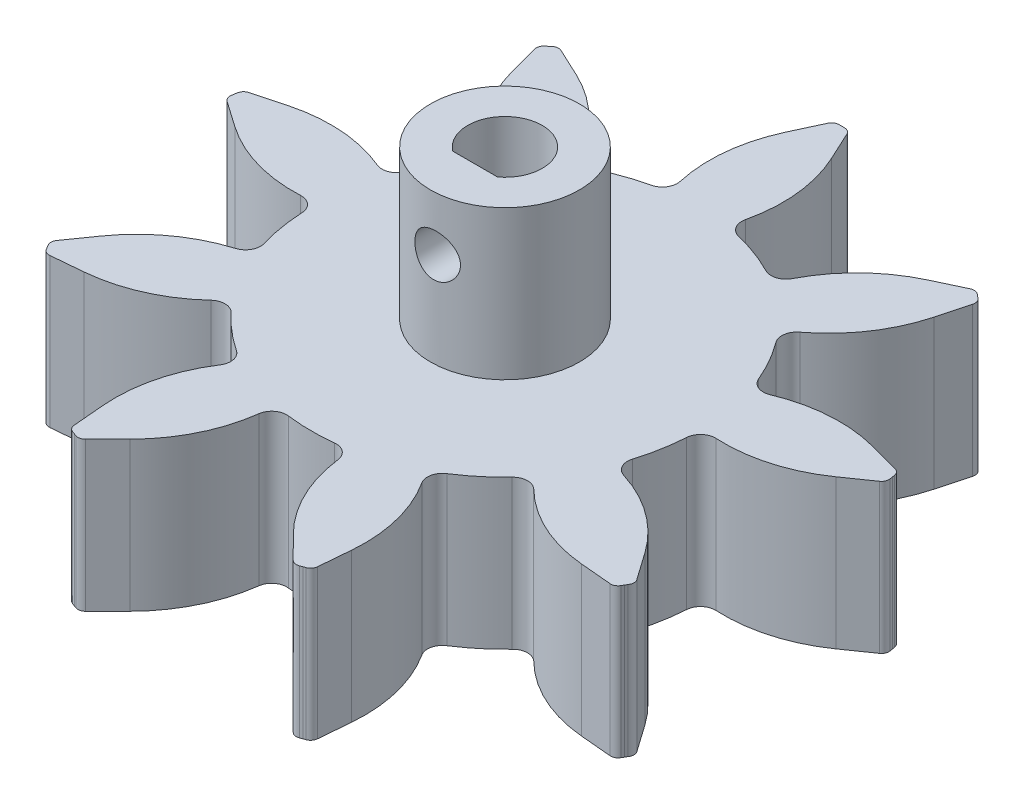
ISO-10303-21;
HEADER;
FILE_DESCRIPTION(('STEP AP214'),'2;1');
FILE_NAME('part.step','',(''),(''),'','','');
FILE_SCHEMA(('AUTOMOTIVE_DESIGN { 1 0 10303 214 1 1 1 1 }'));
ENDSEC;
DATA;
#1=APPLICATION_CONTEXT('core data for automotive mechanical design processes');
#2=APPLICATION_PROTOCOL_DEFINITION('international standard','automotive_design',2000,#1);
#3=PRODUCT_CONTEXT('',#1,'mechanical');
#4=PRODUCT('Part','Part','',(#3));
#5=PRODUCT_RELATED_PRODUCT_CATEGORY('part','',(#4));
#6=PRODUCT_DEFINITION_FORMATION('','',#4);
#7=PRODUCT_DEFINITION_CONTEXT('part definition',#1,'design');
#8=PRODUCT_DEFINITION('design','',#6,#7);
#9=PRODUCT_DEFINITION_SHAPE('','',#8);
#10=(LENGTH_UNIT() NAMED_UNIT(*) SI_UNIT(.MILLI.,.METRE.));
#11=(NAMED_UNIT(*) PLANE_ANGLE_UNIT() SI_UNIT($,.RADIAN.));
#12=(NAMED_UNIT(*) SI_UNIT($,.STERADIAN.) SOLID_ANGLE_UNIT());
#13=UNCERTAINTY_MEASURE_WITH_UNIT(LENGTH_MEASURE(1.E-05),#10,'distance_accuracy_value','');
#14=(GEOMETRIC_REPRESENTATION_CONTEXT(3) GLOBAL_UNCERTAINTY_ASSIGNED_CONTEXT((#13)) GLOBAL_UNIT_ASSIGNED_CONTEXT((#10,
#11,#12)) REPRESENTATION_CONTEXT('',''));
#15=CARTESIAN_POINT('',(0.,0.,0.));
#16=DIRECTION('',(0.,0.,1.));
#17=DIRECTION('',(1.,0.,0.));
#18=AXIS2_PLACEMENT_3D('',#15,#16,#17);
#19=CARTESIAN_POINT('',(-10.6006408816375,10.,-11.9773501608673));
#20=DIRECTION('',(0.,1.,0.));
#21=DIRECTION('',(0.,0.,1.));
#22=AXIS2_PLACEMENT_3D('',#19,#20,#21);
#23=PLANE('',#22);
#24=CARTESIAN_POINT('',(-10.6006408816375,10.,-11.9773501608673));
#25=DIRECTION('',(0.,-1.,0.));
#26=DIRECTION('',(0.,0.,1.));
#27=AXIS2_PLACEMENT_3D('',#24,#25,#26);
#28=CIRCLE('',#27,0.999999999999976);
#29=CARTESIAN_POINT('',(-9.99504494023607,10.,-12.7731224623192));
#30=VERTEX_POINT('',#29);
#31=CARTESIAN_POINT('',(-9.80444899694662,10.,-11.37230596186));
#32=VERTEX_POINT('',#31);
#33=EDGE_CURVE('E693',#30,#32,#28,.T.);
#34=ORIENTED_EDGE('',*,*,#33,.T.);
#35=CARTESIAN_POINT('',(0.546045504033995,10.,-3.50673137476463));
#36=DIRECTION('',(0.,1.,0.));
#37=DIRECTION('',(0.,0.,1.));
#38=AXIS2_PLACEMENT_3D('',#35,#36,#37);
#39=CIRCLE('',#38,12.9999999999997);
#40=CARTESIAN_POINT('',(-11.3752222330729,10.,-8.69164945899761));
#41=VERTEX_POINT('',#40);
#42=EDGE_CURVE('E697',#32,#41,#39,.T.);
#43=ORIENTED_EDGE('',*,*,#42,.T.);
#44=CARTESIAN_POINT('',(-12.2922428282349,10.,-9.09048931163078));
#45=DIRECTION('',(0.,-1.,0.));
#46=DIRECTION('',(0.,0.,1.));
#47=AXIS2_PLACEMENT_3D('',#44,#45,#46);
#48=CIRCLE('',#47,0.99999999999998);
#49=CARTESIAN_POINT('',(-12.6821242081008,10.,-8.16962422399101));
#50=VERTEX_POINT('',#49);
#51=EDGE_CURVE('E701',#41,#50,#48,.T.);
#52=ORIENTED_EDGE('',*,*,#51,.T.);
#53=CARTESIAN_POINT('',(-16.5809380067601,10.,1.0390266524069));
#54=DIRECTION('',(0.,1.,0.));
#55=DIRECTION('',(0.,0.,1.));
#56=AXIS2_PLACEMENT_3D('',#53,#54,#55);
#57=CIRCLE('',#56,10.);
#58=CARTESIAN_POINT('',(-19.15451139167,10.,-8.62413639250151));
#59=VERTEX_POINT('',#58);
#60=EDGE_CURVE('E704',#50,#59,#57,.T.);
#61=ORIENTED_EDGE('',*,*,#60,.T.);
#62=DIRECTION('',(-0.966316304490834,0.,0.257357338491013));
#63=VECTOR('',#62,1.);
#64=CARTESIAN_POINT('',(-19.15451139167,10.,-8.62413639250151));
#65=LINE('',#64,#63);
#66=CARTESIAN_POINT('',(-21.2008110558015,10.,-8.0791489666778));
#67=VERTEX_POINT('',#66);
#68=EDGE_CURVE('E707',#59,#67,#65,.T.);
#69=ORIENTED_EDGE('',*,*,#68,.T.);
#70=CARTESIAN_POINT('',(-21.072132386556,10.,-7.59599081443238));
#71=DIRECTION('',(0.,1.,0.));
#72=DIRECTION('',(0.,0.,1.));
#73=AXIS2_PLACEMENT_3D('',#70,#71,#72);
#74=CIRCLE('',#73,0.500000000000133);
#75=CARTESIAN_POINT('',(-21.5644242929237,10.,-7.68344754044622));
#76=VERTEX_POINT('',#75);
#77=EDGE_CURVE('E710',#67,#76,#74,.T.);
#78=ORIENTED_EDGE('',*,*,#77,.T.);
#79=DIRECTION('',(-0.173648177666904,0.,0.984807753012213));
#80=VECTOR('',#79,1.);
#81=CARTESIAN_POINT('',(-21.5644242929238,10.,-7.68344754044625));
#82=LINE('',#81,#80);
#83=CARTESIAN_POINT('',(-21.6274184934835,10.,-7.32618967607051));
#84=VERTEX_POINT('',#83);
#85=EDGE_CURVE('E713',#76,#84,#82,.T.);
#86=ORIENTED_EDGE('',*,*,#85,.T.);
#87=CARTESIAN_POINT('',(-21.1349034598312,10.,-7.23999836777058));
#88=DIRECTION('',(0.,1.,0.));
#89=DIRECTION('',(0.,0.,1.));
#90=AXIS2_PLACEMENT_3D('',#87,#88,#89);
#91=CIRCLE('',#90,0.500000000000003);
#92=CARTESIAN_POINT('',(-21.4210716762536,10.,-6.82998891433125));
#93=VERTEX_POINT('',#92);
#94=EDGE_CURVE('E716',#84,#93,#91,.T.);
#95=ORIENTED_EDGE('',*,*,#94,.T.);
#96=DIRECTION('',(0.820018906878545,0.,0.572336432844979));
#97=VECTOR('',#96,1.);
#98=CARTESIAN_POINT('',(-19.6845756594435,10.,-5.61799254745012));
#99=LINE('',#98,#97);
#100=CARTESIAN_POINT('',(-19.6845756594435,10.,-5.61799254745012));
#101=VERTEX_POINT('',#100);
#102=EDGE_CURVE('E719',#93,#101,#99,.T.);
#103=ORIENTED_EDGE('',*,*,#102,.T.);
#104=CARTESIAN_POINT('',(-13.9612113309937,10.,-13.8181816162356));
#105=DIRECTION('',(0.,1.,0.));
#106=DIRECTION('',(0.,0.,1.));
#107=AXIS2_PLACEMENT_3D('',#104,#105,#106);
#108=CIRCLE('',#107,10.);
#109=CARTESIAN_POINT('',(-13.4852196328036,10.,-3.82951644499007));
#110=VERTEX_POINT('',#109);
#111=EDGE_CURVE('E722',#101,#110,#108,.T.);
#112=ORIENTED_EDGE('',*,*,#111,.T.);
#113=CARTESIAN_POINT('',(-13.4376204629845,10.,-2.83064992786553));
#114=DIRECTION('',(0.,-1.,0.));
#115=DIRECTION('',(0.,0.,1.));
#116=AXIS2_PLACEMENT_3D('',#113,#114,#115);
#117=CIRCLE('',#116,0.999999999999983);
#118=CARTESIAN_POINT('',(-12.4387871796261,10.,-2.8789414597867));
#119=VERTEX_POINT('',#118);
#120=EDGE_CURVE('E725',#110,#119,#117,.T.);
#121=ORIENTED_EDGE('',*,*,#120,.T.);
#122=CARTESIAN_POINT('',(0.546045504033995,10.,-3.50673137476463));
#123=DIRECTION('',(0.,1.,0.));
#124=DIRECTION('',(0.,0.,1.));
#125=AXIS2_PLACEMENT_3D('',#122,#123,#124);
#126=CIRCLE('',#125,12.9999999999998);
#127=CARTESIAN_POINT('',(-11.9189765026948,10.,0.184234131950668));
#128=VERTEX_POINT('',#127);
#129=EDGE_CURVE('E728',#119,#128,#126,.T.);
#130=ORIENTED_EDGE('',*,*,#129,.T.);
#131=CARTESIAN_POINT('',(-12.8778243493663,10.,0.46815455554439));
#132=DIRECTION('',(0.,-1.,0.));
#133=DIRECTION('',(0.,0.,1.));
#134=AXIS2_PLACEMENT_3D('',#131,#132,#133);
#135=CIRCLE('',#134,0.99999999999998);
#136=CARTESIAN_POINT('',(-12.5845701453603,10.,1.42418905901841));
#137=VERTEX_POINT('',#136);
#138=EDGE_CURVE('E731',#128,#137,#135,.T.);
#139=ORIENTED_EDGE('',*,*,#138,.T.);
#140=CARTESIAN_POINT('',(-9.65202810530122,10.,10.9845340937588));
#141=DIRECTION('',(0.,1.,0.));
#142=DIRECTION('',(0.,0.,1.));
#143=AXIS2_PLACEMENT_3D('',#140,#141,#142);
#144=CIRCLE('',#143,10.);
#145=CARTESIAN_POINT('',(-17.8348611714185,10.,5.23638282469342));
#146=VERTEX_POINT('',#145);
#147=EDGE_CURVE('E734',#137,#146,#144,.T.);
#148=ORIENTED_EDGE('',*,*,#147,.T.);
#149=DIRECTION('',(-0.574815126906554,0.,0.818283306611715));
#150=VECTOR('',#149,1.);
#151=CARTESIAN_POINT('',(-17.8348611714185,10.,5.23638282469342));
#152=LINE('',#151,#150);
#153=CARTESIAN_POINT('',(-19.0521064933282,10.,6.96920348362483));
#154=VERTEX_POINT('',#153);
#155=EDGE_CURVE('E737',#146,#154,#152,.T.);
#156=ORIENTED_EDGE('',*,*,#155,.T.);
#157=CARTESIAN_POINT('',(-18.6429648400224,10.,7.25661104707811));
#158=DIRECTION('',(0.,1.,0.));
#159=DIRECTION('',(0.,0.,1.));
#160=AXIS2_PLACEMENT_3D('',#157,#158,#159);
#161=CIRCLE('',#160,0.499999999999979);
#162=CARTESIAN_POINT('',(-19.0762984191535,10.,7.50605444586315));
#163=VERTEX_POINT('',#162);
#164=EDGE_CURVE('E740',#154,#163,#161,.T.);
#165=ORIENTED_EDGE('',*,*,#164,.T.);
#166=DIRECTION('',(0.498886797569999,0.,0.866667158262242));
#167=VECTOR('',#166,1.);
#168=CARTESIAN_POINT('',(-18.985807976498,10.,7.66325462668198));
#169=LINE('',#168,#167);
#170=CARTESIAN_POINT('',(-18.985807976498,10.,7.66325462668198));
#171=VERTEX_POINT('',#170);
#172=EDGE_CURVE('E743',#163,#171,#169,.T.);
#173=ORIENTED_EDGE('',*,*,#172,.T.);
#174=DIRECTION('',(0.501112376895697,0.,0.865382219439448));
#175=VECTOR('',#174,1.);
#176=CARTESIAN_POINT('',(-18.985807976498,10.,7.66325462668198));
#177=LINE('',#176,#175);
#178=CARTESIAN_POINT('',(-18.8949138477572,10.,7.82022173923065));
#179=VERTEX_POINT('',#178);
#180=EDGE_CURVE('E746',#171,#179,#177,.T.);
#181=ORIENTED_EDGE('',*,*,#180,.T.);
#182=CARTESIAN_POINT('',(-18.4622227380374,10.,7.56966555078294));
#183=DIRECTION('',(0.,1.,0.));
#184=DIRECTION('',(0.,0.,1.));
#185=AXIS2_PLACEMENT_3D('',#182,#183,#184);
#186=CIRCLE('',#185,0.499999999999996);
#187=CARTESIAN_POINT('',(-18.4178913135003,10.,8.06769639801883));
#188=VERTEX_POINT('',#187);
#189=EDGE_CURVE('E749',#179,#188,#186,.T.);
#190=ORIENTED_EDGE('',*,*,#189,.T.);
#191=DIRECTION('',(0.996061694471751,0.,-0.0886628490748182));
#192=VECTOR('',#191,1.);
#193=CARTESIAN_POINT('',(-16.3086019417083,10.,7.87994135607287));
#194=LINE('',#193,#192);
#195=CARTESIAN_POINT('',(-16.3086019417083,10.,7.87994135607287));
#196=VERTEX_POINT('',#195);
#197=EDGE_CURVE('E752',#188,#196,#194,.T.);
#198=ORIENTED_EDGE('',*,*,#197,.T.);
#199=CARTESIAN_POINT('',(-17.1952304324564,10.,-2.08067558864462));
#200=DIRECTION('',(0.,1.,0.));
#201=DIRECTION('',(0.,0.,1.));
#202=AXIS2_PLACEMENT_3D('',#199,#200,#201);
#203=CIRCLE('',#202,9.99999999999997);
#204=CARTESIAN_POINT('',(-10.4100094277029,10.,5.26512429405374));
#205=VERTEX_POINT('',#204);
#206=EDGE_CURVE('E755',#196,#205,#203,.T.);
#207=ORIENTED_EDGE('',*,*,#206,.T.);
#208=CARTESIAN_POINT('',(-9.73148732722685,10.,5.99970428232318));
#209=DIRECTION('',(0.,-1.,0.));
#210=DIRECTION('',(0.,0.,1.));
#211=AXIS2_PLACEMENT_3D('',#208,#209,#210);
#212=CIRCLE('',#211,1.00000000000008);
#213=CARTESIAN_POINT('',(-8.99737783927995,10.,5.3206731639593));
#214=VERTEX_POINT('',#213);
#215=EDGE_CURVE('E758',#205,#214,#212,.T.);
#216=ORIENTED_EDGE('',*,*,#215,.T.);
#217=CARTESIAN_POINT('',(0.546045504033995,10.,-3.50673137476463));
#218=DIRECTION('',(0.,1.,0.));
#219=DIRECTION('',(0.,0.,1.));
#220=AXIS2_PLACEMENT_3D('',#217,#218,#219);
#221=CIRCLE('',#220,12.9999999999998);
#222=CARTESIAN_POINT('',(-6.63020844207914,10.,7.33307394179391));
#223=VERTEX_POINT('',#222);
#224=EDGE_CURVE('E761',#214,#223,#221,.T.);
#225=ORIENTED_EDGE('',*,*,#224,.T.);
#226=CARTESIAN_POINT('',(-7.18222797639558,10.,8.1669051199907));
#227=DIRECTION('',(0.,-1.,0.));
#228=DIRECTION('',(0.,0.,1.));
#229=AXIS2_PLACEMENT_3D('',#226,#227,#228);
#230=CIRCLE('',#229,0.999999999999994);
#231=CARTESIAN_POINT('',(-6.34305508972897,10.,8.71076986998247));
#232=VERTEX_POINT('',#231);
#233=EDGE_CURVE('E764',#223,#232,#230,.T.);
#234=ORIENTED_EDGE('',*,*,#233,.T.);
#235=CARTESIAN_POINT('',(2.04867377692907,10.,14.1494173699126));
#236=DIRECTION('',(0.,1.,0.));
#237=DIRECTION('',(0.,0.,1.));
#238=AXIS2_PLACEMENT_3D('',#235,#236,#237);
#239=CIRCLE('',#238,9.99999999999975);
#240=CARTESIAN_POINT('',(-7.9145804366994,10.,15.0059017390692));
#241=VERTEX_POINT('',#240);
#242=EDGE_CURVE('E767',#232,#241,#239,.T.);
#243=ORIENTED_EDGE('',*,*,#242,.T.);
#244=DIRECTION('',(0.0856484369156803,0.,0.99632542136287));
#245=VECTOR('',#244,1.);
#246=CARTESIAN_POINT('',(-7.91458043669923,10.,15.0059017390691));
#247=LINE('',#246,#245);
#248=CARTESIAN_POINT('',(-7.73320880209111,10.,17.1157495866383));
#249=VERTEX_POINT('',#248);
#250=EDGE_CURVE('E770',#241,#249,#247,.T.);
#251=ORIENTED_EDGE('',*,*,#250,.T.);
#252=CARTESIAN_POINT('',(-7.23504609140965,10.,17.0729253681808));
#253=DIRECTION('',(0.,1.,0.));
#254=DIRECTION('',(0.,0.,1.));
#255=AXIS2_PLACEMENT_3D('',#252,#253,#254);
#256=CIRCLE('',#255,0.499999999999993);
#257=CARTESIAN_POINT('',(-7.4066597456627,10.,17.5425515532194));
#258=VERTEX_POINT('',#257);
#259=EDGE_CURVE('E773',#249,#258,#256,.T.);
#260=ORIENTED_EDGE('',*,*,#259,.T.);
#261=DIRECTION('',(0.939252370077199,0.,0.343227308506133));
#262=VECTOR('',#261,1.);
#263=CARTESIAN_POINT('',(-7.23629371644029,10.,17.6048077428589));
#264=LINE('',#263,#262);
#265=CARTESIAN_POINT('',(-7.23629371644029,10.,17.6048077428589));
#266=VERTEX_POINT('',#265);
#267=EDGE_CURVE('E776',#258,#266,#264,.T.);
#268=ORIENTED_EDGE('',*,*,#267,.T.);
#269=DIRECTION('',(0.940131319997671,0.,0.340812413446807));
#270=VECTOR('',#269,1.);
#271=CARTESIAN_POINT('',(-7.23629371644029,10.,17.6048077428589));
#272=LINE('',#271,#270);
#273=CARTESIAN_POINT('',(-7.06576825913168,10.,17.6666259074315));
#274=VERTEX_POINT('',#273);
#275=EDGE_CURVE('E779',#266,#274,#272,.T.);
#276=ORIENTED_EDGE('',*,*,#275,.T.);
#277=CARTESIAN_POINT('',(-6.89536205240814,10.,17.1965602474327));
#278=DIRECTION('',(0.,1.,0.));
#279=DIRECTION('',(0.,0.,1.));
#280=AXIS2_PLACEMENT_3D('',#277,#278,#279);
#281=CIRCLE('',#280,0.50000000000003);
#282=CARTESIAN_POINT('',(-6.54127415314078,10.,17.5495783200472));
#283=VERTEX_POINT('',#282);
#284=EDGE_CURVE('E782',#274,#283,#281,.T.);
#285=ORIENTED_EDGE('',*,*,#284,.T.);
#286=DIRECTION('',(0.706036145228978,0.,-0.708175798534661));
#287=VECTOR('',#286,1.);
#288=CARTESIAN_POINT('',(-5.04615136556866,10.,16.0499245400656));
#289=LINE('',#288,#287);
#290=CARTESIAN_POINT('',(-5.04615136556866,10.,16.0499245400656));
#291=VERTEX_POINT('',#290);
#292=EDGE_CURVE('E785',#283,#291,#289,.T.);
#293=ORIENTED_EDGE('',*,*,#292,.T.);
#294=CARTESIAN_POINT('',(-12.1279093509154,10.,8.98956308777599));
#295=DIRECTION('',(0.,1.,0.));
#296=DIRECTION('',(0.,0.,1.));
#297=AXIS2_PLACEMENT_3D('',#294,#295,#296);
#298=CIRCLE('',#297,10.);
#299=CARTESIAN_POINT('',(-2.20833935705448,10.,10.2553162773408));
#300=VERTEX_POINT('',#299);
#301=EDGE_CURVE('E788',#291,#300,#298,.T.);
#302=ORIENTED_EDGE('',*,*,#301,.T.);
#303=CARTESIAN_POINT('',(-1.21638235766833,10.,10.3818915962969));
#304=DIRECTION('',(0.,-1.,0.));
#305=DIRECTION('',(0.,0.,1.));
#306=AXIS2_PLACEMENT_3D('',#303,#304,#305);
#307=CIRCLE('',#306,0.999999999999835);
#308=CARTESIAN_POINT('',(-1.09049465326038,10.,9.38984709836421));
#309=VERTEX_POINT('',#308);
#310=EDGE_CURVE('E791',#300,#309,#307,.T.);
#311=ORIENTED_EDGE('',*,*,#310,.T.);
#312=CARTESIAN_POINT('',(0.546045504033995,10.,-3.50673137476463));
#313=DIRECTION('',(0.,1.,0.));
#314=DIRECTION('',(0.,0.,1.));
#315=AXIS2_PLACEMENT_3D('',#312,#313,#314);
#316=CIRCLE('',#315,13.0000000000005);
#317=CARTESIAN_POINT('',(2.01640859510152,10.,9.40984837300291));
#318=VERTEX_POINT('',#317);
#319=EDGE_CURVE('E794',#309,#318,#316,.T.);
#320=ORIENTED_EDGE('',*,*,#319,.T.);
#321=CARTESIAN_POINT('',(2.12951344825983,10.,10.4034314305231));
#322=DIRECTION('',(0.,-1.,0.));
#323=DIRECTION('',(0.,0.,1.));
#324=AXIS2_PLACEMENT_3D('',#321,#322,#323);
#325=CIRCLE('',#324,0.999999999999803);
#326=CARTESIAN_POINT('',(3.12194669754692,10.,10.2806460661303));
#327=VERTEX_POINT('',#326);
#328=EDGE_CURVE('E797',#318,#327,#325,.T.);
#329=ORIENTED_EDGE('',*,*,#328,.T.);
#330=CARTESIAN_POINT('',(13.0462791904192,10.,9.05279242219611));
#331=DIRECTION('',(0.,1.,0.));
#332=DIRECTION('',(0.,0.,1.));
#333=AXIS2_PLACEMENT_3D('',#330,#331,#332);
#334=CIRCLE('',#333,9.99999999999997);
#335=CARTESIAN_POINT('',(5.96452120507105,10.,16.1131538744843));
#336=VERTEX_POINT('',#335);
#337=EDGE_CURVE('E800',#327,#336,#334,.T.);
#338=ORIENTED_EDGE('',*,*,#337,.T.);
#339=DIRECTION('',(0.706036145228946,0.,0.708175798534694));
#340=VECTOR('',#339,1.);
#341=CARTESIAN_POINT('',(5.96452120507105,10.,16.1131538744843));
#342=LINE('',#341,#340);
#343=CARTESIAN_POINT('',(7.45964399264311,10.,17.6128076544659));
#344=VERTEX_POINT('',#343);
#345=EDGE_CURVE('E803',#336,#344,#342,.T.);
#346=ORIENTED_EDGE('',*,*,#345,.T.);
#347=CARTESIAN_POINT('',(7.81373189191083,10.,17.2597895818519));
#348=DIRECTION('',(0.,1.,0.));
#349=DIRECTION('',(0.,0.,1.));
#350=AXIS2_PLACEMENT_3D('',#347,#348,#349);
#351=CIRCLE('',#350,0.499999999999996);
#352=CARTESIAN_POINT('',(7.98413809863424,10.,17.7298552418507));
#353=VERTEX_POINT('',#352);
#354=EDGE_CURVE('E806',#344,#353,#351,.T.);
#355=ORIENTED_EDGE('',*,*,#354,.T.);
#356=DIRECTION('',(0.94013131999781,0.,-0.340812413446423));
#357=VECTOR('',#356,1.);
#358=CARTESIAN_POINT('',(8.15466355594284,10.,17.6680370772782));
#359=LINE('',#358,#357);
#360=CARTESIAN_POINT('',(8.15466355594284,10.,17.6680370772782));
#361=VERTEX_POINT('',#360);
#362=EDGE_CURVE('E809',#353,#361,#359,.T.);
#363=ORIENTED_EDGE('',*,*,#362,.T.);
#364=DIRECTION('',(0.939252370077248,0.,-0.343227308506));
#365=VECTOR('',#364,1.);
#366=CARTESIAN_POINT('',(8.15466355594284,10.,17.6680370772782));
#367=LINE('',#366,#365);
#368=CARTESIAN_POINT('',(8.32502958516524,10.,17.6057808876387));
#369=VERTEX_POINT('',#368);
#370=EDGE_CURVE('E812',#361,#369,#367,.T.);
#371=ORIENTED_EDGE('',*,*,#370,.T.);
#372=CARTESIAN_POINT('',(8.15341593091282,10.,17.1361547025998));
#373=DIRECTION('',(0.,1.,0.));
#374=DIRECTION('',(0.,0.,1.));
#375=AXIS2_PLACEMENT_3D('',#372,#373,#374);
#376=CIRCLE('',#375,0.50000000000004);
#377=CARTESIAN_POINT('',(8.65157864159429,10.,17.1789789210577));
#378=VERTEX_POINT('',#377);
#379=EDGE_CURVE('E815',#369,#378,#376,.T.);
#380=ORIENTED_EDGE('',*,*,#379,.T.);
#381=DIRECTION('',(0.0856484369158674,0.,-0.996325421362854));
#382=VECTOR('',#381,1.);
#383=CARTESIAN_POINT('',(8.83295027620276,10.,15.0691310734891));
#384=LINE('',#383,#382);
#385=CARTESIAN_POINT('',(8.83295027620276,10.,15.0691310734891));
#386=VERTEX_POINT('',#385);
#387=EDGE_CURVE('E818',#378,#386,#384,.T.);
#388=ORIENTED_EDGE('',*,*,#387,.T.);
#389=CARTESIAN_POINT('',(-1.13030393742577,10.,14.2126467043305));
#390=DIRECTION('',(0.,1.,0.));
#391=DIRECTION('',(0.,0.,1.));
#392=AXIS2_PLACEMENT_3D('',#389,#390,#391);
#393=CIRCLE('',#392,9.99999999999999);
#394=CARTESIAN_POINT('',(7.28213800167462,10.,8.80609321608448));
#395=VERTEX_POINT('',#394);
#396=EDGE_CURVE('E821',#386,#395,#393,.T.);
#397=ORIENTED_EDGE('',*,*,#396,.T.);
#398=CARTESIAN_POINT('',(8.12338219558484,10.,8.26543786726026));
#399=DIRECTION('',(0.,-1.,0.));
#400=DIRECTION('',(0.,0.,1.));
#401=AXIS2_PLACEMENT_3D('',#398,#399,#400);
#402=CIRCLE('',#401,0.999999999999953);
#403=CARTESIAN_POINT('',(7.58214386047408,10.,7.4245686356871));
#404=VERTEX_POINT('',#403);
#405=EDGE_CURVE('E824',#395,#404,#402,.T.);
#406=ORIENTED_EDGE('',*,*,#405,.T.);
#407=CARTESIAN_POINT('',(0.546045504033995,10.,-3.50673137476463));
#408=DIRECTION('',(0.,1.,0.));
#409=DIRECTION('',(0.,0.,1.));
#410=AXIS2_PLACEMENT_3D('',#407,#408,#409);
#411=CIRCLE('',#410,13.);
#412=CARTESIAN_POINT('',(9.97502640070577,10.,5.44281158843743));
#413=VERTEX_POINT('',#412);
#414=EDGE_CURVE('E827',#404,#413,#411,.T.);
#415=ORIENTED_EDGE('',*,*,#414,.T.);
#416=CARTESIAN_POINT('',(10.7003326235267,10.,6.13123797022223));
#417=DIRECTION('',(0.,-1.,0.));
#418=DIRECTION('',(0.,0.,1.));
#419=AXIS2_PLACEMENT_3D('',#416,#417,#418);
#420=CIRCLE('',#419,1.00000000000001);
#421=CARTESIAN_POINT('',(11.3816556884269,10.,5.39925512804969));
#422=VERTEX_POINT('',#421);
#423=EDGE_CURVE('E830',#413,#422,#420,.T.);
#424=ORIENTED_EDGE('',*,*,#423,.T.);
#425=CARTESIAN_POINT('',(18.1948863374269,10.,-1.50673137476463));
#426=DIRECTION('',(0.,1.,0.));
#427=DIRECTION('',(0.,0.,1.));
#428=AXIS2_PLACEMENT_3D('',#425,#426,#427);
#429=CIRCLE('',#428,9.70117319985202);
#430=CARTESIAN_POINT('',(17.3347526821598,10.,8.15623564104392));
#431=VERTEX_POINT('',#430);
#432=EDGE_CURVE('E833',#422,#431,#429,.T.);
#433=ORIENTED_EDGE('',*,*,#432,.T.);
#434=DIRECTION('',(0.996061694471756,0.,0.0886628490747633));
#435=VECTOR('',#434,1.);
#436=CARTESIAN_POINT('',(17.3347526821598,10.,8.15623564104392));
#437=LINE('',#436,#435);
#438=CARTESIAN_POINT('',(19.4440420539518,10.,8.34399068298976));
#439=VERTEX_POINT('',#438);
#440=EDGE_CURVE('E836',#431,#439,#437,.T.);
#441=ORIENTED_EDGE('',*,*,#440,.T.);
#442=CARTESIAN_POINT('',(19.4883734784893,10.,7.84595983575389));
#443=DIRECTION('',(0.,1.,0.));
#444=DIRECTION('',(0.,0.,1.));
#445=AXIS2_PLACEMENT_3D('',#442,#443,#444);
#446=CIRCLE('',#445,0.500000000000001);
#447=CARTESIAN_POINT('',(19.921064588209,10.,8.09651602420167));
#448=VERTEX_POINT('',#447);
#449=EDGE_CURVE('E839',#439,#448,#446,.T.);
#450=ORIENTED_EDGE('',*,*,#449,.T.);
#451=DIRECTION('',(0.501112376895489,0.,-0.865382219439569));
#452=VECTOR('',#451,1.);
#453=CARTESIAN_POINT('',(20.0119587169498,10.,7.93954891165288));
#454=LINE('',#453,#452);
#455=CARTESIAN_POINT('',(20.0119587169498,10.,7.93954891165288));
#456=VERTEX_POINT('',#455);
#457=EDGE_CURVE('E842',#448,#456,#454,.T.);
#458=ORIENTED_EDGE('',*,*,#457,.T.);
#459=DIRECTION('',(0.49888679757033,0.,-0.866667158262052));
#460=VECTOR('',#459,1.);
#461=CARTESIAN_POINT('',(20.0119587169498,10.,7.93954891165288));
#462=LINE('',#461,#460);
#463=CARTESIAN_POINT('',(20.1024491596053,10.,7.78234873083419));
#464=VERTEX_POINT('',#463);
#465=EDGE_CURVE('E845',#456,#464,#462,.T.);
#466=ORIENTED_EDGE('',*,*,#465,.T.);
#467=CARTESIAN_POINT('',(19.7004273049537,10.,7.48506363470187));
#468=DIRECTION('',(0.,1.,0.));
#469=DIRECTION('',(0.,0.,1.));
#470=AXIS2_PLACEMENT_3D('',#467,#468,#469);
#471=CIRCLE('',#470,0.499999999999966);
#472=CARTESIAN_POINT('',(20.0517623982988,10.,7.1293057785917));
#473=VERTEX_POINT('',#472);
#474=EDGE_CURVE('E848',#464,#473,#471,.T.);
#475=ORIENTED_EDGE('',*,*,#474,.T.);
#476=DIRECTION('',(-0.574815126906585,0.,-0.818283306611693));
#477=VECTOR('',#476,1.);
#478=CARTESIAN_POINT('',(18.834517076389,10.,5.39648511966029));
#479=LINE('',#478,#477);
#480=CARTESIAN_POINT('',(18.834517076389,10.,5.39648511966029));
#481=VERTEX_POINT('',#480);
#482=EDGE_CURVE('E851',#473,#481,#479,.T.);
#483=ORIENTED_EDGE('',*,*,#482,.T.);
#484=CARTESIAN_POINT('',(10.6516840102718,10.,11.1446363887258));
#485=DIRECTION('',(0.,1.,0.));
#486=DIRECTION('',(0.,0.,1.));
#487=AXIS2_PLACEMENT_3D('',#484,#485,#486);
#488=CIRCLE('',#487,10.);
#489=CARTESIAN_POINT('',(13.6207228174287,10.,1.59556268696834));
#490=VERTEX_POINT('',#489);
#491=EDGE_CURVE('E854',#481,#490,#488,.T.);
#492=ORIENTED_EDGE('',*,*,#491,.T.);
#493=CARTESIAN_POINT('',(13.9176266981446,10.,0.640655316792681));
#494=DIRECTION('',(0.,-1.,0.));
#495=DIRECTION('',(0.,0.,1.));
#496=AXIS2_PLACEMENT_3D('',#493,#494,#495);
#497=CIRCLE('',#496,0.999999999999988);
#498=CARTESIAN_POINT('',(12.9625137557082,10.,0.344413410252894));
#499=VERTEX_POINT('',#498);
#500=EDGE_CURVE('E857',#490,#499,#497,.T.);
#501=ORIENTED_EDGE('',*,*,#500,.T.);
#502=CARTESIAN_POINT('',(0.546045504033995,10.,-3.50673137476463));
#503=DIRECTION('',(0.,1.,0.));
#504=DIRECTION('',(0.,0.,1.));
#505=AXIS2_PLACEMENT_3D('',#502,#503,#504);
#506=CIRCLE('',#505,13.);
#507=CARTESIAN_POINT('',(13.521719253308,10.,-2.7118158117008));
#508=VERTEX_POINT('',#507);
#509=EDGE_CURVE('E860',#499,#508,#506,.T.);
#510=ORIENTED_EDGE('',*,*,#509,.T.);
#511=CARTESIAN_POINT('',(14.5198480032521,10.,-2.65066846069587));
#512=DIRECTION('',(0.,-1.,0.));
#513=DIRECTION('',(0.,0.,1.));
#514=AXIS2_PLACEMENT_3D('',#511,#512,#513);
#515=CIRCLE('',#514,0.99999999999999);
#516=CARTESIAN_POINT('',(14.5712622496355,10.,-3.64934587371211));
#517=VERTEX_POINT('',#516);
#518=EDGE_CURVE('E863',#508,#517,#515,.T.);
#519=ORIENTED_EDGE('',*,*,#518,.T.);
#520=CARTESIAN_POINT('',(15.0854047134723,10.,-13.6361200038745));
#521=DIRECTION('',(0.,1.,0.));
#522=DIRECTION('',(0.,0.,1.));
#523=AXIS2_PLACEMENT_3D('',#520,#521,#522);
#524=CIRCLE('',#523,10.);
#525=CARTESIAN_POINT('',(20.8087690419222,10.,-5.43593093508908));
#526=VERTEX_POINT('',#525);
#527=EDGE_CURVE('E866',#517,#526,#524,.T.);
#528=ORIENTED_EDGE('',*,*,#527,.T.);
#529=DIRECTION('',(0.820018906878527,0.,-0.572336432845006));
#530=VECTOR('',#529,1.);
#531=CARTESIAN_POINT('',(20.8087690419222,10.,-5.43593093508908));
#532=LINE('',#531,#530);
#533=CARTESIAN_POINT('',(22.5452650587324,10.,-6.64792730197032));
#534=VERTEX_POINT('',#533);
#535=EDGE_CURVE('E869',#526,#534,#532,.T.);
#536=ORIENTED_EDGE('',*,*,#535,.T.);
#537=CARTESIAN_POINT('',(22.2590968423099,10.,-7.05793675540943));
#538=DIRECTION('',(0.,1.,0.));
#539=DIRECTION('',(0.,0.,1.));
#540=AXIS2_PLACEMENT_3D('',#537,#538,#539);
#541=CIRCLE('',#540,0.499999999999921);
#542=CARTESIAN_POINT('',(22.7516118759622,10.,-7.1441280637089));
#543=VERTEX_POINT('',#542);
#544=EDGE_CURVE('E872',#534,#543,#541,.T.);
#545=ORIENTED_EDGE('',*,*,#544,.T.);
#546=DIRECTION('',(-0.172382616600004,0.,-0.985030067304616));
#547=VECTOR('',#546,1.);
#548=CARTESIAN_POINT('',(22.7203443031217,10.,-7.3227974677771));
#549=LINE('',#548,#547);
#550=CARTESIAN_POINT('',(22.7203443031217,10.,-7.3227974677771));
#551=VERTEX_POINT('',#550);
#552=EDGE_CURVE('E875',#543,#551,#549,.T.);
#553=ORIENTED_EDGE('',*,*,#552,.T.);
#554=DIRECTION('',(-0.174913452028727,0.,-0.984583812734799));
#555=VECTOR('',#554,1.);
#556=CARTESIAN_POINT('',(22.7203443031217,10.,-7.3227974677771));
#557=LINE('',#556,#555);
#558=CARTESIAN_POINT('',(22.6886176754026,10.,-7.50138592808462));
#559=VERTEX_POINT('',#558);
#560=EDGE_CURVE('E878',#551,#559,#557,.T.);
#561=ORIENTED_EDGE('',*,*,#560,.T.);
#562=CARTESIAN_POINT('',(22.1963257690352,10.,-7.41392920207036));
#563=DIRECTION('',(0.,1.,0.));
#564=DIRECTION('',(0.,0.,1.));
#565=AXIS2_PLACEMENT_3D('',#562,#563,#564);
#566=CIRCLE('',#565,0.500000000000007);
#567=CARTESIAN_POINT('',(22.3250044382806,10.,-7.89708735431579));
#568=VERTEX_POINT('',#567);
#569=EDGE_CURVE('E881',#559,#568,#566,.T.);
#570=ORIENTED_EDGE('',*,*,#569,.T.);
#571=DIRECTION('',(-0.966316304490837,0.,-0.257357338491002));
#572=VECTOR('',#571,1.);
#573=CARTESIAN_POINT('',(20.2787047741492,10.,-8.44207478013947));
#574=LINE('',#573,#572);
#575=CARTESIAN_POINT('',(20.2787047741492,10.,-8.44207478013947));
#576=VERTEX_POINT('',#575);
#577=EDGE_CURVE('E884',#568,#576,#574,.T.);
#578=ORIENTED_EDGE('',*,*,#577,.T.);
#579=CARTESIAN_POINT('',(17.7051313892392,10.,1.22108826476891));
#580=DIRECTION('',(0.,1.,0.));
#581=DIRECTION('',(0.,0.,1.));
#582=AXIS2_PLACEMENT_3D('',#579,#580,#581);
#583=CIRCLE('',#582,10.);
#584=CARTESIAN_POINT('',(13.841520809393,10.,-8.00238793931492));
#585=VERTEX_POINT('',#584);
#586=EDGE_CURVE('E887',#576,#585,#583,.T.);
#587=ORIENTED_EDGE('',*,*,#586,.T.);
#588=CARTESIAN_POINT('',(13.4551597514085,10.,-8.92473555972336));
#589=DIRECTION('',(0.,-1.,0.));
#590=DIRECTION('',(0.,0.,1.));
#591=AXIS2_PLACEMENT_3D('',#588,#589,#590);
#592=CIRCLE('',#591,0.999999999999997);
#593=CARTESIAN_POINT('',(12.5330801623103,10.,-8.53773526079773));
#594=VERTEX_POINT('',#593);
#595=EDGE_CURVE('E890',#585,#594,#592,.T.);
#596=ORIENTED_EDGE('',*,*,#595,.T.);
#597=CARTESIAN_POINT('',(0.546045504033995,10.,-3.50673137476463));
#598=DIRECTION('',(0.,1.,0.));
#599=DIRECTION('',(0.,0.,1.));
#600=AXIS2_PLACEMENT_3D('',#597,#598,#599);
#601=CIRCLE('',#600,12.9999999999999);
#602=CARTESIAN_POINT('',(10.9969501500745,10.,-11.238393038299));
#603=VERTEX_POINT('',#602);
#604=EDGE_CURVE('E893',#594,#603,#601,.T.);
#605=ORIENTED_EDGE('',*,*,#604,.T.);
#606=CARTESIAN_POINT('',(11.8008658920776,10.,-11.8331362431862));
#607=DIRECTION('',(0.,-1.,0.));
#608=DIRECTION('',(0.,0.,1.));
#609=AXIS2_PLACEMENT_3D('',#606,#607,#608);
#610=CIRCLE('',#609,1.);
#611=CARTESIAN_POINT('',(11.1983140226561,10.,-12.6312159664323));
#612=VERTEX_POINT('',#611);
#613=EDGE_CURVE('E896',#603,#612,#610,.T.);
#614=ORIENTED_EDGE('',*,*,#613,.T.);
#615=CARTESIAN_POINT('',(5.17279532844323,10.,-20.6120131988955));
#616=DIRECTION('',(0.,1.,0.));
#617=DIRECTION('',(0.,0.,1.));
#618=AXIS2_PLACEMENT_3D('',#615,#616,#617);
#619=CIRCLE('',#618,10.);
#620=CARTESIAN_POINT('',(14.8281266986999,10.,-18.009211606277));
#621=VERTEX_POINT('',#620);
#622=EDGE_CURVE('E899',#612,#621,#619,.T.);
#623=ORIENTED_EDGE('',*,*,#622,.T.);
#624=DIRECTION('',(0.260280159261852,0.,-0.965533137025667));
#625=VECTOR('',#624,1.);
#626=CARTESIAN_POINT('',(14.8281266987,10.,-18.009211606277));
#627=LINE('',#626,#625);
#628=CARTESIAN_POINT('',(15.3793035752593,10.,-20.0538528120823));
#629=VERTEX_POINT('',#628);
#630=EDGE_CURVE('E902',#621,#629,#627,.T.);
#631=ORIENTED_EDGE('',*,*,#630,.T.);
#632=CARTESIAN_POINT('',(14.8965370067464,10.,-20.1839928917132));
#633=DIRECTION('',(0.,1.,0.));
#634=DIRECTION('',(0.,0.,1.));
#635=AXIS2_PLACEMENT_3D('',#632,#633,#634);
#636=CIRCLE('',#635,0.500000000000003);
#637=CARTESIAN_POINT('',(15.2184227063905,10.,-20.5666018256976));
#638=VERTEX_POINT('',#637);
#639=EDGE_CURVE('E905',#629,#638,#636,.T.);
#640=ORIENTED_EDGE('',*,*,#639,.T.);
#641=DIRECTION('',(-0.766044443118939,0.,-0.642787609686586));
#642=VECTOR('',#641,1.);
#643=CARTESIAN_POINT('',(14.9405254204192,10.,-20.7997853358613));
#644=LINE('',#643,#642);
#645=CARTESIAN_POINT('',(14.9405254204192,10.,-20.7997853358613));
#646=VERTEX_POINT('',#645);
#647=EDGE_CURVE('E908',#638,#646,#644,.T.);
#648=ORIENTED_EDGE('',*,*,#647,.T.);
#649=CARTESIAN_POINT('',(14.6196240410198,10.,-20.4163504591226));
#650=DIRECTION('',(0.,1.,0.));
#651=DIRECTION('',(0.,0.,1.));
#652=AXIS2_PLACEMENT_3D('',#649,#650,#651);
#653=CIRCLE('',#652,0.499999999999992);
#654=CARTESIAN_POINT('',(14.4076295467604,10.,-20.8691841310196));
#655=VERTEX_POINT('',#654);
#656=EDGE_CURVE('E911',#646,#655,#653,.T.);
#657=ORIENTED_EDGE('',*,*,#656,.T.);
#658=DIRECTION('',(-0.905667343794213,0.,0.423988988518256));
#659=VECTOR('',#658,1.);
#660=CARTESIAN_POINT('',(12.4897618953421,10.,-19.9713326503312));
#661=LINE('',#660,#659);
#662=CARTESIAN_POINT('',(12.4897618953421,10.,-19.9713326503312));
#663=VERTEX_POINT('',#662);
#664=EDGE_CURVE('E914',#655,#663,#661,.T.);
#665=ORIENTED_EDGE('',*,*,#664,.T.);
#666=CARTESIAN_POINT('',(16.7296517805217,10.,-10.9146592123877));
#667=DIRECTION('',(0.,1.,0.));
#668=DIRECTION('',(0.,0.,1.));
#669=AXIS2_PLACEMENT_3D('',#666,#667,#668);
#670=CIRCLE('',#669,10.);
#671=CARTESIAN_POINT('',(7.84121814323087,10.,-15.4967708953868));
#672=VERTEX_POINT('',#671);
#673=EDGE_CURVE('E917',#663,#672,#670,.T.);
#674=ORIENTED_EDGE('',*,*,#673,.T.);
#675=CARTESIAN_POINT('',(6.95237477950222,10.,-15.9549820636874));
#676=DIRECTION('',(0.,-1.,0.));
#677=DIRECTION('',(0.,0.,1.));
#678=AXIS2_PLACEMENT_3D('',#675,#676,#677);
#679=CIRCLE('',#678,0.99999999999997);
#680=CARTESIAN_POINT('',(6.49477983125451,10.,-15.0658213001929));
#681=VERTEX_POINT('',#680);
#682=EDGE_CURVE('E920',#672,#681,#679,.T.);
#683=ORIENTED_EDGE('',*,*,#682,.T.);
#684=CARTESIAN_POINT('',(0.546045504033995,10.,-3.50673137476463));
#685=DIRECTION('',(0.,1.,0.));
#686=DIRECTION('',(0.,0.,1.));
#687=AXIS2_PLACEMENT_3D('',#684,#685,#686);
#688=CIRCLE('',#687,12.9999999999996);
#689=CARTESIAN_POINT('',(3.58208661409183,10.,-16.147239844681));
#690=VERTEX_POINT('',#689);
#691=EDGE_CURVE('E923',#681,#690,#688,.T.);
#692=ORIENTED_EDGE('',*,*,#691,.T.);
#693=CARTESIAN_POINT('',(3.8156282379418,10.,-17.1195866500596));
#694=DIRECTION('',(0.,-1.,0.));
#695=DIRECTION('',(0.,0.,1.));
#696=AXIS2_PLACEMENT_3D('',#693,#694,#695);
#697=CIRCLE('',#696,1.00000000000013);
#698=CARTESIAN_POINT('',(2.84105096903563,10.,-17.3436383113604));
#699=VERTEX_POINT('',#698);
#700=EDGE_CURVE('E926',#690,#699,#697,.T.);
#701=ORIENTED_EDGE('',*,*,#700,.T.);
#702=CARTESIAN_POINT('',(-6.90472172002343,10.,-19.5841549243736));
#703=DIRECTION('',(0.,1.,0.));
#704=DIRECTION('',(0.,0.,1.));
#705=AXIS2_PLACEMENT_3D('',#702,#703,#704);
#706=CIRCLE('',#705,10.);
#707=CARTESIAN_POINT('',(2.16473983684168,10.,-23.7966206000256));
#708=VERTEX_POINT('',#707);
#709=EDGE_CURVE('E929',#699,#708,#706,.T.);
#710=ORIENTED_EDGE('',*,*,#709,.T.);
#711=DIRECTION('',(-0.421246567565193,0.,-0.906946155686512));
#712=VECTOR('',#711,1.);
#713=CARTESIAN_POINT('',(2.16473983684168,10.,-23.7966206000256));
#714=LINE('',#713,#712);
#715=CARTESIAN_POINT('',(1.27269578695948,10.,-25.7171963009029));
#716=VERTEX_POINT('',#715);
#717=EDGE_CURVE('E932',#708,#716,#714,.T.);
#718=ORIENTED_EDGE('',*,*,#717,.T.);
#719=CARTESIAN_POINT('',(0.81922270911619,10.,-25.5065730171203));
#720=DIRECTION('',(0.,1.,0.));
#721=DIRECTION('',(0.,0.,1.));
#722=AXIS2_PLACEMENT_3D('',#719,#720,#721);
#723=CIRCLE('',#722,0.500000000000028);
#724=CARTESIAN_POINT('',(0.819865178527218,10.,-26.0065726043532));
#725=VERTEX_POINT('',#724);
#726=EDGE_CURVE('E935',#716,#725,#723,.T.);
#727=ORIENTED_EDGE('',*,*,#726,.T.);
#728=DIRECTION('',(-0.999999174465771,0.,-0.00128493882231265));
#729=VECTOR('',#728,1.);
#730=CARTESIAN_POINT('',(0.638480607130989,10.,-26.0068056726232));
#731=LINE('',#730,#729);
#732=CARTESIAN_POINT('',(0.638480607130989,10.,-26.0068056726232));
#733=VERTEX_POINT('',#732);
#734=EDGE_CURVE('E938',#725,#733,#731,.T.);
#735=ORIENTED_EDGE('',*,*,#734,.T.);
#736=DIRECTION('',(-0.999999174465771,0.,0.00128493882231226));
#737=VECTOR('',#736,1.);
#738=CARTESIAN_POINT('',(0.638480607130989,10.,-26.0068056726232));
#739=LINE('',#738,#737);
#740=CARTESIAN_POINT('',(0.457096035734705,10.,-26.0065726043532));
#741=VERTEX_POINT('',#740);
#742=EDGE_CURVE('E941',#733,#741,#739,.T.);
#743=ORIENTED_EDGE('',*,*,#742,.T.);
#744=CARTESIAN_POINT('',(0.457738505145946,10.,-25.5065730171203));
#745=DIRECTION('',(0.,1.,0.));
#746=DIRECTION('',(0.,0.,1.));
#747=AXIS2_PLACEMENT_3D('',#744,#745,#746);
#748=CIRCLE('',#747,0.50000000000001);
#749=CARTESIAN_POINT('',(0.00426542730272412,10.,-25.717196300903));
#750=VERTEX_POINT('',#749);
#751=EDGE_CURVE('E944',#741,#750,#748,.T.);
#752=ORIENTED_EDGE('',*,*,#751,.T.);
#753=DIRECTION('',(-0.421246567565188,0.,0.906946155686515));
#754=VECTOR('',#753,1.);
#755=CARTESIAN_POINT('',(-0.887778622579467,10.,-23.7966206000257));
#756=LINE('',#755,#754);
#757=CARTESIAN_POINT('',(-0.887778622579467,10.,-23.7966206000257));
#758=VERTEX_POINT('',#757);
#759=EDGE_CURVE('E947',#750,#758,#756,.T.);
#760=ORIENTED_EDGE('',*,*,#759,.T.);
#761=CARTESIAN_POINT('',(8.18168293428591,10.,-19.5841549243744));
#762=DIRECTION('',(0.,1.,0.));
#763=DIRECTION('',(0.,0.,1.));
#764=AXIS2_PLACEMENT_3D('',#761,#762,#763);
#765=CIRCLE('',#764,9.99999999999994);
#766=CARTESIAN_POINT('',(-1.57257687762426,10.,-17.3808811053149));
#767=VERTEX_POINT('',#766);
#768=EDGE_CURVE('E950',#758,#767,#765,.T.);
#769=ORIENTED_EDGE('',*,*,#768,.T.);
#770=CARTESIAN_POINT('',(-2.5480028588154,10.,-17.1605537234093));
#771=DIRECTION('',(0.,-1.,0.));
#772=DIRECTION('',(0.,0.,1.));
#773=AXIS2_PLACEMENT_3D('',#770,#771,#772);
#774=CIRCLE('',#773,1.00000000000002);
#775=CARTESIAN_POINT('',(-2.32699940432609,10.,-16.1852806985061));
#776=VERTEX_POINT('',#775);
#777=EDGE_CURVE('E953',#767,#776,#774,.T.);
#778=ORIENTED_EDGE('',*,*,#777,.T.);
#779=CARTESIAN_POINT('',(0.546045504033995,10.,-3.50673137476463));
#780=DIRECTION('',(0.,1.,0.));
#781=DIRECTION('',(0.,0.,1.));
#782=AXIS2_PLACEMENT_3D('',#779,#780,#781);
#783=CIRCLE('',#782,13.);
#784=CARTESIAN_POINT('',(-5.25337429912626,10.,-15.1414522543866));
#785=VERTEX_POINT('',#784);
#786=EDGE_CURVE('E956',#776,#785,#783,.T.);
#787=ORIENTED_EDGE('',*,*,#786,.T.);
#788=CARTESIAN_POINT('',(-5.69948351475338,10.,-16.0364307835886));
#789=DIRECTION('',(0.,-1.,0.));
#790=DIRECTION('',(0.,0.,1.));
#791=AXIS2_PLACEMENT_3D('',#788,#789,#790);
#792=CIRCLE('',#791,0.99999999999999);
#793=CARTESIAN_POINT('',(-6.59007064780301,10.,-15.5816181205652));
#794=VERTEX_POINT('',#793);
#795=EDGE_CURVE('E959',#785,#794,#792,.T.);
#796=ORIENTED_EDGE('',*,*,#795,.T.);
#797=CARTESIAN_POINT('',(-15.4959419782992,10.,-11.033491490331));
#798=DIRECTION('',(0.,1.,0.));
#799=DIRECTION('',(0.,0.,1.));
#800=AXIS2_PLACEMENT_3D('',#797,#798,#799);
#801=CIRCLE('',#800,9.99999999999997);
#802=CARTESIAN_POINT('',(-11.2560520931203,10.,-20.0901649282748));
#803=VERTEX_POINT('',#802);
#804=EDGE_CURVE('E962',#794,#803,#801,.T.);
#805=ORIENTED_EDGE('',*,*,#804,.T.);
#806=DIRECTION('',(-0.905667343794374,0.,-0.423988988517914));
#807=VECTOR('',#806,1.);
#808=CARTESIAN_POINT('',(-11.2560520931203,10.,-20.0901649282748));
#809=LINE('',#808,#807);
#810=CARTESIAN_POINT('',(-13.1739197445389,10.,-20.9880164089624));
#811=VERTEX_POINT('',#810);
#812=EDGE_CURVE('E965',#803,#811,#809,.T.);
#813=ORIENTED_EDGE('',*,*,#812,.T.);
#814=CARTESIAN_POINT('',(-13.3859142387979,10.,-20.5351827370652));
#815=DIRECTION('',(0.,1.,0.));
#816=DIRECTION('',(0.,0.,1.));
#817=AXIS2_PLACEMENT_3D('',#814,#815,#816);
#818=CIRCLE('',#817,0.499999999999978);
#819=CARTESIAN_POINT('',(-13.7068156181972,10.,-20.9186176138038));
#820=VERTEX_POINT('',#819);
#821=EDGE_CURVE('E968',#811,#820,#818,.T.);
#822=ORIENTED_EDGE('',*,*,#821,.T.);
#823=DIRECTION('',(-0.766869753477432,0.,0.641802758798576));
#824=VECTOR('',#823,1.);
#825=CARTESIAN_POINT('',(-13.845914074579,10.,-20.8022043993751));
#826=LINE('',#825,#824);
#827=CARTESIAN_POINT('',(-13.845914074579,10.,-20.8022043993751));
#828=VERTEX_POINT('',#827);
#829=EDGE_CURVE('E971',#820,#828,#826,.T.);
#830=ORIENTED_EDGE('',*,*,#829,.T.);
#831=DIRECTION('',(-0.765217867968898,0.,0.643771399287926));
#832=VECTOR('',#831,1.);
#833=CARTESIAN_POINT('',(-13.845914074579,10.,-20.8022043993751));
#834=LINE('',#833,#832);
#835=CARTESIAN_POINT('',(-13.9847129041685,10.,-20.6854341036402));
#836=VERTEX_POINT('',#835);
#837=EDGE_CURVE('E974',#828,#836,#834,.T.);
#838=ORIENTED_EDGE('',*,*,#837,.T.);
#839=CARTESIAN_POINT('',(-13.6628272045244,10.,-20.3028251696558));
#840=DIRECTION('',(0.,1.,0.));
#841=DIRECTION('',(0.,0.,1.));
#842=AXIS2_PLACEMENT_3D('',#839,#840,#841);
#843=CIRCLE('',#842,0.500000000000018);
#844=CARTESIAN_POINT('',(-14.1455937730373,10.,-20.1726850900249));
#845=VERTEX_POINT('',#844);
#846=EDGE_CURVE('E977',#836,#845,#843,.T.);
#847=ORIENTED_EDGE('',*,*,#846,.T.);
#848=DIRECTION('',(0.260280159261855,0.,0.965533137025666));
#849=VECTOR('',#848,1.);
#850=CARTESIAN_POINT('',(-13.5944168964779,10.,-18.1280438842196));
#851=LINE('',#850,#849);
#852=CARTESIAN_POINT('',(-13.5944168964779,10.,-18.1280438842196));
#853=VERTEX_POINT('',#852);
#854=EDGE_CURVE('E980',#845,#853,#851,.T.);
#855=ORIENTED_EDGE('',*,*,#854,.T.);
#856=CARTESIAN_POINT('',(-3.93908552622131,10.,-20.7308454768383));
#857=DIRECTION('',(0.,1.,0.));
#858=DIRECTION('',(0.,0.,1.));
#859=AXIS2_PLACEMENT_3D('',#856,#857,#858);
#860=CIRCLE('',#859,10.);
#861=EDGE_CURVE('E983',#853,#30,#860,.T.);
#862=ORIENTED_EDGE('',*,*,#861,.T.);
#863=EDGE_LOOP('',(#34,#43,#52,#61,#69,#78,#86,#95,#103,#112,#121,#130,#139,#148,#156,#165,#173,
#181,#190,#198,#207,#216,#225,#234,#243,#251,#260,#268,#276,#285,#293,#302,#311,#320,#329,#338,
#346,#355,#363,#371,#380,#388,#397,#406,#415,#424,#433,#441,#450,#458,#466,#475,#483,#492,#501,
#510,#519,#528,#536,#545,#553,#561,#570,#578,#587,#596,#605,#614,#623,#631,#640,#648,#657,#665,
#674,#683,#692,#701,#710,#718,#727,#735,#743,#752,#760,#769,#778,#787,#796,#805,#813,#822,#830,
#838,#847,#855,#862));
#864=FACE_BOUND('',#863,.T.);
#865=CARTESIAN_POINT('',(0.546045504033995,10.,-3.50673137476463));
#866=DIRECTION('',(0.,1.,0.));
#867=DIRECTION('',(0.,0.,1.));
#868=AXIS2_PLACEMENT_3D('',#865,#866,#867);
#869=CIRCLE('',#868,5.);
#870=CARTESIAN_POINT('',(0.546045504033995,10.,1.49326862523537));
#871=VERTEX_POINT('',#870);
#872=EDGE_CURVE('E3203',#871,#871,#869,.T.);
#873=ORIENTED_EDGE('',*,*,#872,.F.);
#874=EDGE_LOOP('',(#873));
#875=FACE_BOUND('',#874,.T.);
#876=ADVANCED_FACE('F42',(#864,#875),#23,.T.);
#877=CARTESIAN_POINT('',(-10.6006408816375,0.,-11.9773501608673));
#878=DIRECTION('',(0.,1.,0.));
#879=DIRECTION('',(0.,0.,1.));
#880=AXIS2_PLACEMENT_3D('',#877,#878,#879);
#881=PLANE('',#880);
#882=CARTESIAN_POINT('',(-10.6006408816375,0.,-11.9773501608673));
#883=DIRECTION('',(0.,-1.,0.));
#884=DIRECTION('',(0.,0.,1.));
#885=AXIS2_PLACEMENT_3D('',#882,#883,#884);
#886=CIRCLE('',#885,0.999999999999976);
#887=CARTESIAN_POINT('',(-9.99504494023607,0.,-12.7731224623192));
#888=VERTEX_POINT('',#887);
#889=CARTESIAN_POINT('',(-9.80444899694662,0.,-11.37230596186));
#890=VERTEX_POINT('',#889);
#891=EDGE_CURVE('E687',#888,#890,#886,.T.);
#892=ORIENTED_EDGE('',*,*,#891,.F.);
#893=CARTESIAN_POINT('',(-3.93908552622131,0.,-20.7308454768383));
#894=DIRECTION('',(0.,1.,0.));
#895=DIRECTION('',(0.,0.,1.));
#896=AXIS2_PLACEMENT_3D('',#893,#894,#895);
#897=CIRCLE('',#896,10.);
#898=CARTESIAN_POINT('',(-13.5944168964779,0.,-18.1280438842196));
#899=VERTEX_POINT('',#898);
#900=EDGE_CURVE('E698',#899,#888,#897,.T.);
#901=ORIENTED_EDGE('',*,*,#900,.F.);
#902=DIRECTION('',(0.260280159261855,0.,0.965533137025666));
#903=VECTOR('',#902,1.);
#904=CARTESIAN_POINT('',(-13.5944168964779,0.,-18.1280438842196));
#905=LINE('',#904,#903);
#906=CARTESIAN_POINT('',(-14.1455937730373,0.,-20.1726850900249));
#907=VERTEX_POINT('',#906);
#908=EDGE_CURVE('E1272',#907,#899,#905,.T.);
#909=ORIENTED_EDGE('',*,*,#908,.F.);
#910=CARTESIAN_POINT('',(-13.6628272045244,0.,-20.3028251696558));
#911=DIRECTION('',(0.,1.,0.));
#912=DIRECTION('',(0.,0.,1.));
#913=AXIS2_PLACEMENT_3D('',#910,#911,#912);
#914=CIRCLE('',#913,0.500000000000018);
#915=CARTESIAN_POINT('',(-13.9847129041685,0.,-20.6854341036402));
#916=VERTEX_POINT('',#915);
#917=EDGE_CURVE('E1269',#916,#907,#914,.T.);
#918=ORIENTED_EDGE('',*,*,#917,.F.);
#919=DIRECTION('',(-0.765217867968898,0.,0.643771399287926));
#920=VECTOR('',#919,1.);
#921=CARTESIAN_POINT('',(-13.845914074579,0.,-20.8022043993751));
#922=LINE('',#921,#920);
#923=CARTESIAN_POINT('',(-13.845914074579,0.,-20.8022043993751));
#924=VERTEX_POINT('',#923);
#925=EDGE_CURVE('E1266',#924,#916,#922,.T.);
#926=ORIENTED_EDGE('',*,*,#925,.F.);
#927=DIRECTION('',(-0.766869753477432,0.,0.641802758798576));
#928=VECTOR('',#927,1.);
#929=CARTESIAN_POINT('',(-13.845914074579,0.,-20.8022043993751));
#930=LINE('',#929,#928);
#931=CARTESIAN_POINT('',(-13.7068156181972,0.,-20.9186176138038));
#932=VERTEX_POINT('',#931);
#933=EDGE_CURVE('E1263',#932,#924,#930,.T.);
#934=ORIENTED_EDGE('',*,*,#933,.F.);
#935=CARTESIAN_POINT('',(-13.3859142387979,0.,-20.5351827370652));
#936=DIRECTION('',(0.,1.,0.));
#937=DIRECTION('',(0.,0.,1.));
#938=AXIS2_PLACEMENT_3D('',#935,#936,#937);
#939=CIRCLE('',#938,0.499999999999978);
#940=CARTESIAN_POINT('',(-13.1739197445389,0.,-20.9880164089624));
#941=VERTEX_POINT('',#940);
#942=EDGE_CURVE('E1260',#941,#932,#939,.T.);
#943=ORIENTED_EDGE('',*,*,#942,.F.);
#944=DIRECTION('',(-0.905667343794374,0.,-0.423988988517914));
#945=VECTOR('',#944,1.);
#946=CARTESIAN_POINT('',(-11.2560520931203,0.,-20.0901649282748));
#947=LINE('',#946,#945);
#948=CARTESIAN_POINT('',(-11.2560520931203,0.,-20.0901649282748));
#949=VERTEX_POINT('',#948);
#950=EDGE_CURVE('E1257',#949,#941,#947,.T.);
#951=ORIENTED_EDGE('',*,*,#950,.F.);
#952=CARTESIAN_POINT('',(-15.4959419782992,0.,-11.033491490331));
#953=DIRECTION('',(0.,1.,0.));
#954=DIRECTION('',(0.,0.,1.));
#955=AXIS2_PLACEMENT_3D('',#952,#953,#954);
#956=CIRCLE('',#955,9.99999999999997);
#957=CARTESIAN_POINT('',(-6.59007064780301,0.,-15.5816181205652));
#958=VERTEX_POINT('',#957);
#959=EDGE_CURVE('E1254',#958,#949,#956,.T.);
#960=ORIENTED_EDGE('',*,*,#959,.F.);
#961=CARTESIAN_POINT('',(-5.69948351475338,0.,-16.0364307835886));
#962=DIRECTION('',(0.,-1.,0.));
#963=DIRECTION('',(0.,0.,1.));
#964=AXIS2_PLACEMENT_3D('',#961,#962,#963);
#965=CIRCLE('',#964,0.99999999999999);
#966=CARTESIAN_POINT('',(-5.25337429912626,0.,-15.1414522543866));
#967=VERTEX_POINT('',#966);
#968=EDGE_CURVE('E1251',#967,#958,#965,.T.);
#969=ORIENTED_EDGE('',*,*,#968,.F.);
#970=CARTESIAN_POINT('',(0.546045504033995,0.,-3.50673137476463));
#971=DIRECTION('',(0.,1.,0.));
#972=DIRECTION('',(0.,0.,1.));
#973=AXIS2_PLACEMENT_3D('',#970,#971,#972);
#974=CIRCLE('',#973,13.);
#975=CARTESIAN_POINT('',(-2.32699940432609,0.,-16.1852806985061));
#976=VERTEX_POINT('',#975);
#977=EDGE_CURVE('E1248',#976,#967,#974,.T.);
#978=ORIENTED_EDGE('',*,*,#977,.F.);
#979=CARTESIAN_POINT('',(-2.5480028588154,0.,-17.1605537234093));
#980=DIRECTION('',(0.,-1.,0.));
#981=DIRECTION('',(0.,0.,1.));
#982=AXIS2_PLACEMENT_3D('',#979,#980,#981);
#983=CIRCLE('',#982,1.00000000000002);
#984=CARTESIAN_POINT('',(-1.57257687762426,0.,-17.3808811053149));
#985=VERTEX_POINT('',#984);
#986=EDGE_CURVE('E1245',#985,#976,#983,.T.);
#987=ORIENTED_EDGE('',*,*,#986,.F.);
#988=CARTESIAN_POINT('',(8.18168293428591,0.,-19.5841549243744));
#989=DIRECTION('',(0.,1.,0.));
#990=DIRECTION('',(0.,0.,1.));
#991=AXIS2_PLACEMENT_3D('',#988,#989,#990);
#992=CIRCLE('',#991,9.99999999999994);
#993=CARTESIAN_POINT('',(-0.887778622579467,0.,-23.7966206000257));
#994=VERTEX_POINT('',#993);
#995=EDGE_CURVE('E1242',#994,#985,#992,.T.);
#996=ORIENTED_EDGE('',*,*,#995,.F.);
#997=DIRECTION('',(-0.421246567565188,0.,0.906946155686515));
#998=VECTOR('',#997,1.);
#999=CARTESIAN_POINT('',(-0.887778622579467,0.,-23.7966206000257));
#1000=LINE('',#999,#998);
#1001=CARTESIAN_POINT('',(0.00426542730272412,0.,-25.717196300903));
#1002=VERTEX_POINT('',#1001);
#1003=EDGE_CURVE('E1239',#1002,#994,#1000,.T.);
#1004=ORIENTED_EDGE('',*,*,#1003,.F.);
#1005=CARTESIAN_POINT('',(0.457738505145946,0.,-25.5065730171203));
#1006=DIRECTION('',(0.,1.,0.));
#1007=DIRECTION('',(0.,0.,1.));
#1008=AXIS2_PLACEMENT_3D('',#1005,#1006,#1007);
#1009=CIRCLE('',#1008,0.50000000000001);
#1010=CARTESIAN_POINT('',(0.457096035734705,0.,-26.0065726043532));
#1011=VERTEX_POINT('',#1010);
#1012=EDGE_CURVE('E1236',#1011,#1002,#1009,.T.);
#1013=ORIENTED_EDGE('',*,*,#1012,.F.);
#1014=DIRECTION('',(-0.999999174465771,0.,0.00128493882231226));
#1015=VECTOR('',#1014,1.);
#1016=CARTESIAN_POINT('',(0.638480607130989,0.,-26.0068056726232));
#1017=LINE('',#1016,#1015);
#1018=CARTESIAN_POINT('',(0.638480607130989,0.,-26.0068056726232));
#1019=VERTEX_POINT('',#1018);
#1020=EDGE_CURVE('E1233',#1019,#1011,#1017,.T.);
#1021=ORIENTED_EDGE('',*,*,#1020,.F.);
#1022=DIRECTION('',(-0.999999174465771,0.,-0.00128493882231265));
#1023=VECTOR('',#1022,1.);
#1024=CARTESIAN_POINT('',(0.638480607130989,0.,-26.0068056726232));
#1025=LINE('',#1024,#1023);
#1026=CARTESIAN_POINT('',(0.819865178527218,0.,-26.0065726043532));
#1027=VERTEX_POINT('',#1026);
#1028=EDGE_CURVE('E1230',#1027,#1019,#1025,.T.);
#1029=ORIENTED_EDGE('',*,*,#1028,.F.);
#1030=CARTESIAN_POINT('',(0.81922270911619,0.,-25.5065730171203));
#1031=DIRECTION('',(0.,1.,0.));
#1032=DIRECTION('',(0.,0.,1.));
#1033=AXIS2_PLACEMENT_3D('',#1030,#1031,#1032);
#1034=CIRCLE('',#1033,0.500000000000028);
#1035=CARTESIAN_POINT('',(1.27269578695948,0.,-25.7171963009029));
#1036=VERTEX_POINT('',#1035);
#1037=EDGE_CURVE('E1227',#1036,#1027,#1034,.T.);
#1038=ORIENTED_EDGE('',*,*,#1037,.F.);
#1039=DIRECTION('',(-0.421246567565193,0.,-0.906946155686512));
#1040=VECTOR('',#1039,1.);
#1041=CARTESIAN_POINT('',(2.16473983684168,0.,-23.7966206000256));
#1042=LINE('',#1041,#1040);
#1043=CARTESIAN_POINT('',(2.16473983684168,0.,-23.7966206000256));
#1044=VERTEX_POINT('',#1043);
#1045=EDGE_CURVE('E1224',#1044,#1036,#1042,.T.);
#1046=ORIENTED_EDGE('',*,*,#1045,.F.);
#1047=CARTESIAN_POINT('',(-6.90472172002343,0.,-19.5841549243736));
#1048=DIRECTION('',(0.,1.,0.));
#1049=DIRECTION('',(0.,0.,1.));
#1050=AXIS2_PLACEMENT_3D('',#1047,#1048,#1049);
#1051=CIRCLE('',#1050,10.);
#1052=CARTESIAN_POINT('',(2.84105096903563,0.,-17.3436383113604));
#1053=VERTEX_POINT('',#1052);
#1054=EDGE_CURVE('E1221',#1053,#1044,#1051,.T.);
#1055=ORIENTED_EDGE('',*,*,#1054,.F.);
#1056=CARTESIAN_POINT('',(3.8156282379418,0.,-17.1195866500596));
#1057=DIRECTION('',(0.,-1.,0.));
#1058=DIRECTION('',(0.,0.,1.));
#1059=AXIS2_PLACEMENT_3D('',#1056,#1057,#1058);
#1060=CIRCLE('',#1059,1.00000000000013);
#1061=CARTESIAN_POINT('',(3.58208661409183,0.,-16.147239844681));
#1062=VERTEX_POINT('',#1061);
#1063=EDGE_CURVE('E1218',#1062,#1053,#1060,.T.);
#1064=ORIENTED_EDGE('',*,*,#1063,.F.);
#1065=CARTESIAN_POINT('',(0.546045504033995,0.,-3.50673137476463));
#1066=DIRECTION('',(0.,1.,0.));
#1067=DIRECTION('',(0.,0.,1.));
#1068=AXIS2_PLACEMENT_3D('',#1065,#1066,#1067);
#1069=CIRCLE('',#1068,12.9999999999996);
#1070=CARTESIAN_POINT('',(6.49477983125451,0.,-15.0658213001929));
#1071=VERTEX_POINT('',#1070);
#1072=EDGE_CURVE('E1215',#1071,#1062,#1069,.T.);
#1073=ORIENTED_EDGE('',*,*,#1072,.F.);
#1074=CARTESIAN_POINT('',(6.95237477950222,0.,-15.9549820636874));
#1075=DIRECTION('',(0.,-1.,0.));
#1076=DIRECTION('',(0.,0.,1.));
#1077=AXIS2_PLACEMENT_3D('',#1074,#1075,#1076);
#1078=CIRCLE('',#1077,0.99999999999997);
#1079=CARTESIAN_POINT('',(7.84121814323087,0.,-15.4967708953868));
#1080=VERTEX_POINT('',#1079);
#1081=EDGE_CURVE('E1212',#1080,#1071,#1078,.T.);
#1082=ORIENTED_EDGE('',*,*,#1081,.F.);
#1083=CARTESIAN_POINT('',(16.7296517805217,0.,-10.9146592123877));
#1084=DIRECTION('',(0.,1.,0.));
#1085=DIRECTION('',(0.,0.,1.));
#1086=AXIS2_PLACEMENT_3D('',#1083,#1084,#1085);
#1087=CIRCLE('',#1086,10.);
#1088=CARTESIAN_POINT('',(12.4897618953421,0.,-19.9713326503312));
#1089=VERTEX_POINT('',#1088);
#1090=EDGE_CURVE('E1209',#1089,#1080,#1087,.T.);
#1091=ORIENTED_EDGE('',*,*,#1090,.F.);
#1092=DIRECTION('',(-0.905667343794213,0.,0.423988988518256));
#1093=VECTOR('',#1092,1.);
#1094=CARTESIAN_POINT('',(12.4897618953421,0.,-19.9713326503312));
#1095=LINE('',#1094,#1093);
#1096=CARTESIAN_POINT('',(14.4076295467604,0.,-20.8691841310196));
#1097=VERTEX_POINT('',#1096);
#1098=EDGE_CURVE('E1206',#1097,#1089,#1095,.T.);
#1099=ORIENTED_EDGE('',*,*,#1098,.F.);
#1100=CARTESIAN_POINT('',(14.6196240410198,0.,-20.4163504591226));
#1101=DIRECTION('',(0.,1.,0.));
#1102=DIRECTION('',(0.,0.,1.));
#1103=AXIS2_PLACEMENT_3D('',#1100,#1101,#1102);
#1104=CIRCLE('',#1103,0.499999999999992);
#1105=CARTESIAN_POINT('',(14.9405254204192,0.,-20.7997853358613));
#1106=VERTEX_POINT('',#1105);
#1107=EDGE_CURVE('E1203',#1106,#1097,#1104,.T.);
#1108=ORIENTED_EDGE('',*,*,#1107,.F.);
#1109=DIRECTION('',(-0.766044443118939,0.,-0.642787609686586));
#1110=VECTOR('',#1109,1.);
#1111=CARTESIAN_POINT('',(14.9405254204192,0.,-20.7997853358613));
#1112=LINE('',#1111,#1110);
#1113=CARTESIAN_POINT('',(15.2184227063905,0.,-20.5666018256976));
#1114=VERTEX_POINT('',#1113);
#1115=EDGE_CURVE('E1200',#1114,#1106,#1112,.T.);
#1116=ORIENTED_EDGE('',*,*,#1115,.F.);
#1117=CARTESIAN_POINT('',(14.8965370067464,0.,-20.1839928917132));
#1118=DIRECTION('',(0.,1.,0.));
#1119=DIRECTION('',(0.,0.,1.));
#1120=AXIS2_PLACEMENT_3D('',#1117,#1118,#1119);
#1121=CIRCLE('',#1120,0.500000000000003);
#1122=CARTESIAN_POINT('',(15.3793035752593,0.,-20.0538528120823));
#1123=VERTEX_POINT('',#1122);
#1124=EDGE_CURVE('E1197',#1123,#1114,#1121,.T.);
#1125=ORIENTED_EDGE('',*,*,#1124,.F.);
#1126=DIRECTION('',(0.260280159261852,0.,-0.965533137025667));
#1127=VECTOR('',#1126,1.);
#1128=CARTESIAN_POINT('',(14.8281266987,0.,-18.009211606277));
#1129=LINE('',#1128,#1127);
#1130=CARTESIAN_POINT('',(14.8281266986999,0.,-18.009211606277));
#1131=VERTEX_POINT('',#1130);
#1132=EDGE_CURVE('E1194',#1131,#1123,#1129,.T.);
#1133=ORIENTED_EDGE('',*,*,#1132,.F.);
#1134=CARTESIAN_POINT('',(5.17279532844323,0.,-20.6120131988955));
#1135=DIRECTION('',(0.,1.,0.));
#1136=DIRECTION('',(0.,0.,1.));
#1137=AXIS2_PLACEMENT_3D('',#1134,#1135,#1136);
#1138=CIRCLE('',#1137,10.);
#1139=CARTESIAN_POINT('',(11.1983140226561,0.,-12.6312159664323));
#1140=VERTEX_POINT('',#1139);
#1141=EDGE_CURVE('E1191',#1140,#1131,#1138,.T.);
#1142=ORIENTED_EDGE('',*,*,#1141,.F.);
#1143=CARTESIAN_POINT('',(11.8008658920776,0.,-11.8331362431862));
#1144=DIRECTION('',(0.,-1.,0.));
#1145=DIRECTION('',(0.,0.,1.));
#1146=AXIS2_PLACEMENT_3D('',#1143,#1144,#1145);
#1147=CIRCLE('',#1146,1.);
#1148=CARTESIAN_POINT('',(10.9969501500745,0.,-11.238393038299));
#1149=VERTEX_POINT('',#1148);
#1150=EDGE_CURVE('E1188',#1149,#1140,#1147,.T.);
#1151=ORIENTED_EDGE('',*,*,#1150,.F.);
#1152=CARTESIAN_POINT('',(0.546045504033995,0.,-3.50673137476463));
#1153=DIRECTION('',(0.,1.,0.));
#1154=DIRECTION('',(0.,0.,1.));
#1155=AXIS2_PLACEMENT_3D('',#1152,#1153,#1154);
#1156=CIRCLE('',#1155,12.9999999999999);
#1157=CARTESIAN_POINT('',(12.5330801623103,0.,-8.53773526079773));
#1158=VERTEX_POINT('',#1157);
#1159=EDGE_CURVE('E1185',#1158,#1149,#1156,.T.);
#1160=ORIENTED_EDGE('',*,*,#1159,.F.);
#1161=CARTESIAN_POINT('',(13.4551597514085,0.,-8.92473555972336));
#1162=DIRECTION('',(0.,-1.,0.));
#1163=DIRECTION('',(0.,0.,1.));
#1164=AXIS2_PLACEMENT_3D('',#1161,#1162,#1163);
#1165=CIRCLE('',#1164,0.999999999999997);
#1166=CARTESIAN_POINT('',(13.841520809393,0.,-8.00238793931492));
#1167=VERTEX_POINT('',#1166);
#1168=EDGE_CURVE('E1182',#1167,#1158,#1165,.T.);
#1169=ORIENTED_EDGE('',*,*,#1168,.F.);
#1170=CARTESIAN_POINT('',(17.7051313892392,0.,1.22108826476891));
#1171=DIRECTION('',(0.,1.,0.));
#1172=DIRECTION('',(0.,0.,1.));
#1173=AXIS2_PLACEMENT_3D('',#1170,#1171,#1172);
#1174=CIRCLE('',#1173,10.);
#1175=CARTESIAN_POINT('',(20.2787047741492,0.,-8.44207478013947));
#1176=VERTEX_POINT('',#1175);
#1177=EDGE_CURVE('E1179',#1176,#1167,#1174,.T.);
#1178=ORIENTED_EDGE('',*,*,#1177,.F.);
#1179=DIRECTION('',(-0.966316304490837,0.,-0.257357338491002));
#1180=VECTOR('',#1179,1.);
#1181=CARTESIAN_POINT('',(20.2787047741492,0.,-8.44207478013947));
#1182=LINE('',#1181,#1180);
#1183=CARTESIAN_POINT('',(22.3250044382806,0.,-7.89708735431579));
#1184=VERTEX_POINT('',#1183);
#1185=EDGE_CURVE('E1176',#1184,#1176,#1182,.T.);
#1186=ORIENTED_EDGE('',*,*,#1185,.F.);
#1187=CARTESIAN_POINT('',(22.1963257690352,0.,-7.41392920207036));
#1188=DIRECTION('',(0.,1.,0.));
#1189=DIRECTION('',(0.,0.,1.));
#1190=AXIS2_PLACEMENT_3D('',#1187,#1188,#1189);
#1191=CIRCLE('',#1190,0.500000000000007);
#1192=CARTESIAN_POINT('',(22.6886176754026,0.,-7.50138592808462));
#1193=VERTEX_POINT('',#1192);
#1194=EDGE_CURVE('E1173',#1193,#1184,#1191,.T.);
#1195=ORIENTED_EDGE('',*,*,#1194,.F.);
#1196=DIRECTION('',(-0.174913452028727,0.,-0.984583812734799));
#1197=VECTOR('',#1196,1.);
#1198=CARTESIAN_POINT('',(22.7203443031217,0.,-7.3227974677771));
#1199=LINE('',#1198,#1197);
#1200=CARTESIAN_POINT('',(22.7203443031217,0.,-7.3227974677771));
#1201=VERTEX_POINT('',#1200);
#1202=EDGE_CURVE('E1170',#1201,#1193,#1199,.T.);
#1203=ORIENTED_EDGE('',*,*,#1202,.F.);
#1204=DIRECTION('',(-0.172382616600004,0.,-0.985030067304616));
#1205=VECTOR('',#1204,1.);
#1206=CARTESIAN_POINT('',(22.7203443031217,0.,-7.3227974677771));
#1207=LINE('',#1206,#1205);
#1208=CARTESIAN_POINT('',(22.7516118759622,0.,-7.1441280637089));
#1209=VERTEX_POINT('',#1208);
#1210=EDGE_CURVE('E1167',#1209,#1201,#1207,.T.);
#1211=ORIENTED_EDGE('',*,*,#1210,.F.);
#1212=CARTESIAN_POINT('',(22.2590968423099,0.,-7.05793675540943));
#1213=DIRECTION('',(0.,1.,0.));
#1214=DIRECTION('',(0.,0.,1.));
#1215=AXIS2_PLACEMENT_3D('',#1212,#1213,#1214);
#1216=CIRCLE('',#1215,0.499999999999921);
#1217=CARTESIAN_POINT('',(22.5452650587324,0.,-6.64792730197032));
#1218=VERTEX_POINT('',#1217);
#1219=EDGE_CURVE('E1164',#1218,#1209,#1216,.T.);
#1220=ORIENTED_EDGE('',*,*,#1219,.F.);
#1221=DIRECTION('',(0.820018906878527,0.,-0.572336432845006));
#1222=VECTOR('',#1221,1.);
#1223=CARTESIAN_POINT('',(20.8087690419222,0.,-5.43593093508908));
#1224=LINE('',#1223,#1222);
#1225=CARTESIAN_POINT('',(20.8087690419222,0.,-5.43593093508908));
#1226=VERTEX_POINT('',#1225);
#1227=EDGE_CURVE('E1161',#1226,#1218,#1224,.T.);
#1228=ORIENTED_EDGE('',*,*,#1227,.F.);
#1229=CARTESIAN_POINT('',(15.0854047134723,0.,-13.6361200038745));
#1230=DIRECTION('',(0.,1.,0.));
#1231=DIRECTION('',(0.,0.,1.));
#1232=AXIS2_PLACEMENT_3D('',#1229,#1230,#1231);
#1233=CIRCLE('',#1232,10.);
#1234=CARTESIAN_POINT('',(14.5712622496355,0.,-3.64934587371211));
#1235=VERTEX_POINT('',#1234);
#1236=EDGE_CURVE('E1158',#1235,#1226,#1233,.T.);
#1237=ORIENTED_EDGE('',*,*,#1236,.F.);
#1238=CARTESIAN_POINT('',(14.5198480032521,0.,-2.65066846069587));
#1239=DIRECTION('',(0.,-1.,0.));
#1240=DIRECTION('',(0.,0.,1.));
#1241=AXIS2_PLACEMENT_3D('',#1238,#1239,#1240);
#1242=CIRCLE('',#1241,0.99999999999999);
#1243=CARTESIAN_POINT('',(13.521719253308,0.,-2.7118158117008));
#1244=VERTEX_POINT('',#1243);
#1245=EDGE_CURVE('E1155',#1244,#1235,#1242,.T.);
#1246=ORIENTED_EDGE('',*,*,#1245,.F.);
#1247=CARTESIAN_POINT('',(0.546045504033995,0.,-3.50673137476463));
#1248=DIRECTION('',(0.,1.,0.));
#1249=DIRECTION('',(0.,0.,1.));
#1250=AXIS2_PLACEMENT_3D('',#1247,#1248,#1249);
#1251=CIRCLE('',#1250,13.);
#1252=CARTESIAN_POINT('',(12.9625137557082,0.,0.344413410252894));
#1253=VERTEX_POINT('',#1252);
#1254=EDGE_CURVE('E1152',#1253,#1244,#1251,.T.);
#1255=ORIENTED_EDGE('',*,*,#1254,.F.);
#1256=CARTESIAN_POINT('',(13.9176266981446,0.,0.640655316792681));
#1257=DIRECTION('',(0.,-1.,0.));
#1258=DIRECTION('',(0.,0.,1.));
#1259=AXIS2_PLACEMENT_3D('',#1256,#1257,#1258);
#1260=CIRCLE('',#1259,0.999999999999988);
#1261=CARTESIAN_POINT('',(13.6207228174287,0.,1.59556268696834));
#1262=VERTEX_POINT('',#1261);
#1263=EDGE_CURVE('E1149',#1262,#1253,#1260,.T.);
#1264=ORIENTED_EDGE('',*,*,#1263,.F.);
#1265=CARTESIAN_POINT('',(10.6516840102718,0.,11.1446363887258));
#1266=DIRECTION('',(0.,1.,0.));
#1267=DIRECTION('',(0.,0.,1.));
#1268=AXIS2_PLACEMENT_3D('',#1265,#1266,#1267);
#1269=CIRCLE('',#1268,10.);
#1270=CARTESIAN_POINT('',(18.834517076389,0.,5.39648511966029));
#1271=VERTEX_POINT('',#1270);
#1272=EDGE_CURVE('E1146',#1271,#1262,#1269,.T.);
#1273=ORIENTED_EDGE('',*,*,#1272,.F.);
#1274=DIRECTION('',(-0.574815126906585,0.,-0.818283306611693));
#1275=VECTOR('',#1274,1.);
#1276=CARTESIAN_POINT('',(18.834517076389,0.,5.39648511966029));
#1277=LINE('',#1276,#1275);
#1278=CARTESIAN_POINT('',(20.0517623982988,0.,7.1293057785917));
#1279=VERTEX_POINT('',#1278);
#1280=EDGE_CURVE('E1143',#1279,#1271,#1277,.T.);
#1281=ORIENTED_EDGE('',*,*,#1280,.F.);
#1282=CARTESIAN_POINT('',(19.7004273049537,0.,7.48506363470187));
#1283=DIRECTION('',(0.,1.,0.));
#1284=DIRECTION('',(0.,0.,1.));
#1285=AXIS2_PLACEMENT_3D('',#1282,#1283,#1284);
#1286=CIRCLE('',#1285,0.499999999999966);
#1287=CARTESIAN_POINT('',(20.1024491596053,0.,7.78234873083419));
#1288=VERTEX_POINT('',#1287);
#1289=EDGE_CURVE('E1140',#1288,#1279,#1286,.T.);
#1290=ORIENTED_EDGE('',*,*,#1289,.F.);
#1291=DIRECTION('',(0.49888679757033,0.,-0.866667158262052));
#1292=VECTOR('',#1291,1.);
#1293=CARTESIAN_POINT('',(20.0119587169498,0.,7.93954891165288));
#1294=LINE('',#1293,#1292);
#1295=CARTESIAN_POINT('',(20.0119587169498,0.,7.93954891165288));
#1296=VERTEX_POINT('',#1295);
#1297=EDGE_CURVE('E1137',#1296,#1288,#1294,.T.);
#1298=ORIENTED_EDGE('',*,*,#1297,.F.);
#1299=DIRECTION('',(0.501112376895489,0.,-0.865382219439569));
#1300=VECTOR('',#1299,1.);
#1301=CARTESIAN_POINT('',(20.0119587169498,0.,7.93954891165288));
#1302=LINE('',#1301,#1300);
#1303=CARTESIAN_POINT('',(19.921064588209,0.,8.09651602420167));
#1304=VERTEX_POINT('',#1303);
#1305=EDGE_CURVE('E1134',#1304,#1296,#1302,.T.);
#1306=ORIENTED_EDGE('',*,*,#1305,.F.);
#1307=CARTESIAN_POINT('',(19.4883734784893,0.,7.84595983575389));
#1308=DIRECTION('',(0.,1.,0.));
#1309=DIRECTION('',(0.,0.,1.));
#1310=AXIS2_PLACEMENT_3D('',#1307,#1308,#1309);
#1311=CIRCLE('',#1310,0.500000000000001);
#1312=CARTESIAN_POINT('',(19.4440420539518,0.,8.34399068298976));
#1313=VERTEX_POINT('',#1312);
#1314=EDGE_CURVE('E1131',#1313,#1304,#1311,.T.);
#1315=ORIENTED_EDGE('',*,*,#1314,.F.);
#1316=DIRECTION('',(0.996061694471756,0.,0.0886628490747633));
#1317=VECTOR('',#1316,1.);
#1318=CARTESIAN_POINT('',(17.3347526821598,0.,8.15623564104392));
#1319=LINE('',#1318,#1317);
#1320=CARTESIAN_POINT('',(17.3347526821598,0.,8.15623564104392));
#1321=VERTEX_POINT('',#1320);
#1322=EDGE_CURVE('E1128',#1321,#1313,#1319,.T.);
#1323=ORIENTED_EDGE('',*,*,#1322,.F.);
#1324=CARTESIAN_POINT('',(18.1948863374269,0.,-1.50673137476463));
#1325=DIRECTION('',(0.,1.,0.));
#1326=DIRECTION('',(0.,0.,1.));
#1327=AXIS2_PLACEMENT_3D('',#1324,#1325,#1326);
#1328=CIRCLE('',#1327,9.70117319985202);
#1329=CARTESIAN_POINT('',(11.3816556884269,0.,5.39925512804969));
#1330=VERTEX_POINT('',#1329);
#1331=EDGE_CURVE('E1125',#1330,#1321,#1328,.T.);
#1332=ORIENTED_EDGE('',*,*,#1331,.F.);
#1333=CARTESIAN_POINT('',(10.7003326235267,0.,6.13123797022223));
#1334=DIRECTION('',(0.,-1.,0.));
#1335=DIRECTION('',(0.,0.,1.));
#1336=AXIS2_PLACEMENT_3D('',#1333,#1334,#1335);
#1337=CIRCLE('',#1336,1.00000000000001);
#1338=CARTESIAN_POINT('',(9.97502640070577,0.,5.44281158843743));
#1339=VERTEX_POINT('',#1338);
#1340=EDGE_CURVE('E1122',#1339,#1330,#1337,.T.);
#1341=ORIENTED_EDGE('',*,*,#1340,.F.);
#1342=CARTESIAN_POINT('',(0.546045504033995,0.,-3.50673137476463));
#1343=DIRECTION('',(0.,1.,0.));
#1344=DIRECTION('',(0.,0.,1.));
#1345=AXIS2_PLACEMENT_3D('',#1342,#1343,#1344);
#1346=CIRCLE('',#1345,13.);
#1347=CARTESIAN_POINT('',(7.58214386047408,0.,7.4245686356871));
#1348=VERTEX_POINT('',#1347);
#1349=EDGE_CURVE('E1119',#1348,#1339,#1346,.T.);
#1350=ORIENTED_EDGE('',*,*,#1349,.F.);
#1351=CARTESIAN_POINT('',(8.12338219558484,0.,8.26543786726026));
#1352=DIRECTION('',(0.,-1.,0.));
#1353=DIRECTION('',(0.,0.,1.));
#1354=AXIS2_PLACEMENT_3D('',#1351,#1352,#1353);
#1355=CIRCLE('',#1354,0.999999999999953);
#1356=CARTESIAN_POINT('',(7.28213800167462,0.,8.80609321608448));
#1357=VERTEX_POINT('',#1356);
#1358=EDGE_CURVE('E1116',#1357,#1348,#1355,.T.);
#1359=ORIENTED_EDGE('',*,*,#1358,.F.);
#1360=CARTESIAN_POINT('',(-1.13030393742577,0.,14.2126467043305));
#1361=DIRECTION('',(0.,1.,0.));
#1362=DIRECTION('',(0.,0.,1.));
#1363=AXIS2_PLACEMENT_3D('',#1360,#1361,#1362);
#1364=CIRCLE('',#1363,9.99999999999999);
#1365=CARTESIAN_POINT('',(8.83295027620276,0.,15.0691310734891));
#1366=VERTEX_POINT('',#1365);
#1367=EDGE_CURVE('E1113',#1366,#1357,#1364,.T.);
#1368=ORIENTED_EDGE('',*,*,#1367,.F.);
#1369=DIRECTION('',(0.0856484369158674,0.,-0.996325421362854));
#1370=VECTOR('',#1369,1.);
#1371=CARTESIAN_POINT('',(8.83295027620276,0.,15.0691310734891));
#1372=LINE('',#1371,#1370);
#1373=CARTESIAN_POINT('',(8.65157864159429,0.,17.1789789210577));
#1374=VERTEX_POINT('',#1373);
#1375=EDGE_CURVE('E1110',#1374,#1366,#1372,.T.);
#1376=ORIENTED_EDGE('',*,*,#1375,.F.);
#1377=CARTESIAN_POINT('',(8.15341593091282,0.,17.1361547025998));
#1378=DIRECTION('',(0.,1.,0.));
#1379=DIRECTION('',(0.,0.,1.));
#1380=AXIS2_PLACEMENT_3D('',#1377,#1378,#1379);
#1381=CIRCLE('',#1380,0.50000000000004);
#1382=CARTESIAN_POINT('',(8.32502958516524,0.,17.6057808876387));
#1383=VERTEX_POINT('',#1382);
#1384=EDGE_CURVE('E1107',#1383,#1374,#1381,.T.);
#1385=ORIENTED_EDGE('',*,*,#1384,.F.);
#1386=DIRECTION('',(0.939252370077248,0.,-0.343227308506));
#1387=VECTOR('',#1386,1.);
#1388=CARTESIAN_POINT('',(8.15466355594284,0.,17.6680370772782));
#1389=LINE('',#1388,#1387);
#1390=CARTESIAN_POINT('',(8.15466355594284,0.,17.6680370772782));
#1391=VERTEX_POINT('',#1390);
#1392=EDGE_CURVE('E1104',#1391,#1383,#1389,.T.);
#1393=ORIENTED_EDGE('',*,*,#1392,.F.);
#1394=DIRECTION('',(0.94013131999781,0.,-0.340812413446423));
#1395=VECTOR('',#1394,1.);
#1396=CARTESIAN_POINT('',(8.15466355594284,0.,17.6680370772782));
#1397=LINE('',#1396,#1395);
#1398=CARTESIAN_POINT('',(7.98413809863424,0.,17.7298552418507));
#1399=VERTEX_POINT('',#1398);
#1400=EDGE_CURVE('E1101',#1399,#1391,#1397,.T.);
#1401=ORIENTED_EDGE('',*,*,#1400,.F.);
#1402=CARTESIAN_POINT('',(7.81373189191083,0.,17.2597895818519));
#1403=DIRECTION('',(0.,1.,0.));
#1404=DIRECTION('',(0.,0.,1.));
#1405=AXIS2_PLACEMENT_3D('',#1402,#1403,#1404);
#1406=CIRCLE('',#1405,0.499999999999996);
#1407=CARTESIAN_POINT('',(7.45964399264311,0.,17.6128076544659));
#1408=VERTEX_POINT('',#1407);
#1409=EDGE_CURVE('E1098',#1408,#1399,#1406,.T.);
#1410=ORIENTED_EDGE('',*,*,#1409,.F.);
#1411=DIRECTION('',(0.706036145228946,0.,0.708175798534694));
#1412=VECTOR('',#1411,1.);
#1413=CARTESIAN_POINT('',(5.96452120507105,0.,16.1131538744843));
#1414=LINE('',#1413,#1412);
#1415=CARTESIAN_POINT('',(5.96452120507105,0.,16.1131538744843));
#1416=VERTEX_POINT('',#1415);
#1417=EDGE_CURVE('E1095',#1416,#1408,#1414,.T.);
#1418=ORIENTED_EDGE('',*,*,#1417,.F.);
#1419=CARTESIAN_POINT('',(13.0462791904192,0.,9.05279242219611));
#1420=DIRECTION('',(0.,1.,0.));
#1421=DIRECTION('',(0.,0.,1.));
#1422=AXIS2_PLACEMENT_3D('',#1419,#1420,#1421);
#1423=CIRCLE('',#1422,9.99999999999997);
#1424=CARTESIAN_POINT('',(3.12194669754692,0.,10.2806460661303));
#1425=VERTEX_POINT('',#1424);
#1426=EDGE_CURVE('E1092',#1425,#1416,#1423,.T.);
#1427=ORIENTED_EDGE('',*,*,#1426,.F.);
#1428=CARTESIAN_POINT('',(2.12951344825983,0.,10.4034314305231));
#1429=DIRECTION('',(0.,-1.,0.));
#1430=DIRECTION('',(0.,0.,1.));
#1431=AXIS2_PLACEMENT_3D('',#1428,#1429,#1430);
#1432=CIRCLE('',#1431,0.999999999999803);
#1433=CARTESIAN_POINT('',(2.01640859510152,0.,9.40984837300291));
#1434=VERTEX_POINT('',#1433);
#1435=EDGE_CURVE('E1089',#1434,#1425,#1432,.T.);
#1436=ORIENTED_EDGE('',*,*,#1435,.F.);
#1437=CARTESIAN_POINT('',(0.546045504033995,0.,-3.50673137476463));
#1438=DIRECTION('',(0.,1.,0.));
#1439=DIRECTION('',(0.,0.,1.));
#1440=AXIS2_PLACEMENT_3D('',#1437,#1438,#1439);
#1441=CIRCLE('',#1440,13.0000000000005);
#1442=CARTESIAN_POINT('',(-1.09049465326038,0.,9.38984709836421));
#1443=VERTEX_POINT('',#1442);
#1444=EDGE_CURVE('E1086',#1443,#1434,#1441,.T.);
#1445=ORIENTED_EDGE('',*,*,#1444,.F.);
#1446=CARTESIAN_POINT('',(-1.21638235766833,0.,10.3818915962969));
#1447=DIRECTION('',(0.,-1.,0.));
#1448=DIRECTION('',(0.,0.,1.));
#1449=AXIS2_PLACEMENT_3D('',#1446,#1447,#1448);
#1450=CIRCLE('',#1449,0.999999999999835);
#1451=CARTESIAN_POINT('',(-2.20833935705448,0.,10.2553162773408));
#1452=VERTEX_POINT('',#1451);
#1453=EDGE_CURVE('E1083',#1452,#1443,#1450,.T.);
#1454=ORIENTED_EDGE('',*,*,#1453,.F.);
#1455=CARTESIAN_POINT('',(-12.1279093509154,0.,8.98956308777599));
#1456=DIRECTION('',(0.,1.,0.));
#1457=DIRECTION('',(0.,0.,1.));
#1458=AXIS2_PLACEMENT_3D('',#1455,#1456,#1457);
#1459=CIRCLE('',#1458,10.);
#1460=CARTESIAN_POINT('',(-5.04615136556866,0.,16.0499245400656));
#1461=VERTEX_POINT('',#1460);
#1462=EDGE_CURVE('E1080',#1461,#1452,#1459,.T.);
#1463=ORIENTED_EDGE('',*,*,#1462,.F.);
#1464=DIRECTION('',(0.706036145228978,0.,-0.708175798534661));
#1465=VECTOR('',#1464,1.);
#1466=CARTESIAN_POINT('',(-5.04615136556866,0.,16.0499245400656));
#1467=LINE('',#1466,#1465);
#1468=CARTESIAN_POINT('',(-6.54127415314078,0.,17.5495783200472));
#1469=VERTEX_POINT('',#1468);
#1470=EDGE_CURVE('E1077',#1469,#1461,#1467,.T.);
#1471=ORIENTED_EDGE('',*,*,#1470,.F.);
#1472=CARTESIAN_POINT('',(-6.89536205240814,0.,17.1965602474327));
#1473=DIRECTION('',(0.,1.,0.));
#1474=DIRECTION('',(0.,0.,1.));
#1475=AXIS2_PLACEMENT_3D('',#1472,#1473,#1474);
#1476=CIRCLE('',#1475,0.50000000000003);
#1477=CARTESIAN_POINT('',(-7.06576825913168,0.,17.6666259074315));
#1478=VERTEX_POINT('',#1477);
#1479=EDGE_CURVE('E1074',#1478,#1469,#1476,.T.);
#1480=ORIENTED_EDGE('',*,*,#1479,.F.);
#1481=DIRECTION('',(0.940131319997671,0.,0.340812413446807));
#1482=VECTOR('',#1481,1.);
#1483=CARTESIAN_POINT('',(-7.23629371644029,0.,17.6048077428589));
#1484=LINE('',#1483,#1482);
#1485=CARTESIAN_POINT('',(-7.23629371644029,0.,17.6048077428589));
#1486=VERTEX_POINT('',#1485);
#1487=EDGE_CURVE('E1071',#1486,#1478,#1484,.T.);
#1488=ORIENTED_EDGE('',*,*,#1487,.F.);
#1489=DIRECTION('',(0.939252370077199,0.,0.343227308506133));
#1490=VECTOR('',#1489,1.);
#1491=CARTESIAN_POINT('',(-7.23629371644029,0.,17.6048077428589));
#1492=LINE('',#1491,#1490);
#1493=CARTESIAN_POINT('',(-7.4066597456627,0.,17.5425515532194));
#1494=VERTEX_POINT('',#1493);
#1495=EDGE_CURVE('E1068',#1494,#1486,#1492,.T.);
#1496=ORIENTED_EDGE('',*,*,#1495,.F.);
#1497=CARTESIAN_POINT('',(-7.23504609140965,0.,17.0729253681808));
#1498=DIRECTION('',(0.,1.,0.));
#1499=DIRECTION('',(0.,0.,1.));
#1500=AXIS2_PLACEMENT_3D('',#1497,#1498,#1499);
#1501=CIRCLE('',#1500,0.499999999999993);
#1502=CARTESIAN_POINT('',(-7.73320880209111,0.,17.1157495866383));
#1503=VERTEX_POINT('',#1502);
#1504=EDGE_CURVE('E1065',#1503,#1494,#1501,.T.);
#1505=ORIENTED_EDGE('',*,*,#1504,.F.);
#1506=DIRECTION('',(0.0856484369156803,0.,0.99632542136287));
#1507=VECTOR('',#1506,1.);
#1508=CARTESIAN_POINT('',(-7.91458043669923,0.,15.0059017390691));
#1509=LINE('',#1508,#1507);
#1510=CARTESIAN_POINT('',(-7.9145804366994,0.,15.0059017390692));
#1511=VERTEX_POINT('',#1510);
#1512=EDGE_CURVE('E1062',#1511,#1503,#1509,.T.);
#1513=ORIENTED_EDGE('',*,*,#1512,.F.);
#1514=CARTESIAN_POINT('',(2.04867377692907,0.,14.1494173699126));
#1515=DIRECTION('',(0.,1.,0.));
#1516=DIRECTION('',(0.,0.,1.));
#1517=AXIS2_PLACEMENT_3D('',#1514,#1515,#1516);
#1518=CIRCLE('',#1517,9.99999999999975);
#1519=CARTESIAN_POINT('',(-6.34305508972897,0.,8.71076986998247));
#1520=VERTEX_POINT('',#1519);
#1521=EDGE_CURVE('E1059',#1520,#1511,#1518,.T.);
#1522=ORIENTED_EDGE('',*,*,#1521,.F.);
#1523=CARTESIAN_POINT('',(-7.18222797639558,0.,8.1669051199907));
#1524=DIRECTION('',(0.,-1.,0.));
#1525=DIRECTION('',(0.,0.,1.));
#1526=AXIS2_PLACEMENT_3D('',#1523,#1524,#1525);
#1527=CIRCLE('',#1526,0.999999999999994);
#1528=CARTESIAN_POINT('',(-6.63020844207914,0.,7.33307394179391));
#1529=VERTEX_POINT('',#1528);
#1530=EDGE_CURVE('E1056',#1529,#1520,#1527,.T.);
#1531=ORIENTED_EDGE('',*,*,#1530,.F.);
#1532=CARTESIAN_POINT('',(0.546045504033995,0.,-3.50673137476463));
#1533=DIRECTION('',(0.,1.,0.));
#1534=DIRECTION('',(0.,0.,1.));
#1535=AXIS2_PLACEMENT_3D('',#1532,#1533,#1534);
#1536=CIRCLE('',#1535,12.9999999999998);
#1537=CARTESIAN_POINT('',(-8.99737783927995,0.,5.3206731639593));
#1538=VERTEX_POINT('',#1537);
#1539=EDGE_CURVE('E1053',#1538,#1529,#1536,.T.);
#1540=ORIENTED_EDGE('',*,*,#1539,.F.);
#1541=CARTESIAN_POINT('',(-9.73148732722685,0.,5.99970428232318));
#1542=DIRECTION('',(0.,-1.,0.));
#1543=DIRECTION('',(0.,0.,1.));
#1544=AXIS2_PLACEMENT_3D('',#1541,#1542,#1543);
#1545=CIRCLE('',#1544,1.00000000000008);
#1546=CARTESIAN_POINT('',(-10.4100094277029,0.,5.26512429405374));
#1547=VERTEX_POINT('',#1546);
#1548=EDGE_CURVE('E1050',#1547,#1538,#1545,.T.);
#1549=ORIENTED_EDGE('',*,*,#1548,.F.);
#1550=CARTESIAN_POINT('',(-17.1952304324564,0.,-2.08067558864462));
#1551=DIRECTION('',(0.,1.,0.));
#1552=DIRECTION('',(0.,0.,1.));
#1553=AXIS2_PLACEMENT_3D('',#1550,#1551,#1552);
#1554=CIRCLE('',#1553,9.99999999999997);
#1555=CARTESIAN_POINT('',(-16.3086019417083,0.,7.87994135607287));
#1556=VERTEX_POINT('',#1555);
#1557=EDGE_CURVE('E1047',#1556,#1547,#1554,.T.);
#1558=ORIENTED_EDGE('',*,*,#1557,.F.);
#1559=DIRECTION('',(0.996061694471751,0.,-0.0886628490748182));
#1560=VECTOR('',#1559,1.);
#1561=CARTESIAN_POINT('',(-16.3086019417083,0.,7.87994135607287));
#1562=LINE('',#1561,#1560);
#1563=CARTESIAN_POINT('',(-18.4178913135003,0.,8.06769639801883));
#1564=VERTEX_POINT('',#1563);
#1565=EDGE_CURVE('E1044',#1564,#1556,#1562,.T.);
#1566=ORIENTED_EDGE('',*,*,#1565,.F.);
#1567=CARTESIAN_POINT('',(-18.4622227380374,0.,7.56966555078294));
#1568=DIRECTION('',(0.,1.,0.));
#1569=DIRECTION('',(0.,0.,1.));
#1570=AXIS2_PLACEMENT_3D('',#1567,#1568,#1569);
#1571=CIRCLE('',#1570,0.499999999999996);
#1572=CARTESIAN_POINT('',(-18.8949138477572,0.,7.82022173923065));
#1573=VERTEX_POINT('',#1572);
#1574=EDGE_CURVE('E1041',#1573,#1564,#1571,.T.);
#1575=ORIENTED_EDGE('',*,*,#1574,.F.);
#1576=DIRECTION('',(0.501112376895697,0.,0.865382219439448));
#1577=VECTOR('',#1576,1.);
#1578=CARTESIAN_POINT('',(-18.985807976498,0.,7.66325462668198));
#1579=LINE('',#1578,#1577);
#1580=CARTESIAN_POINT('',(-18.985807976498,0.,7.66325462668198));
#1581=VERTEX_POINT('',#1580);
#1582=EDGE_CURVE('E1038',#1581,#1573,#1579,.T.);
#1583=ORIENTED_EDGE('',*,*,#1582,.F.);
#1584=DIRECTION('',(0.498886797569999,0.,0.866667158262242));
#1585=VECTOR('',#1584,1.);
#1586=CARTESIAN_POINT('',(-18.985807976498,0.,7.66325462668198));
#1587=LINE('',#1586,#1585);
#1588=CARTESIAN_POINT('',(-19.0762984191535,0.,7.50605444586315));
#1589=VERTEX_POINT('',#1588);
#1590=EDGE_CURVE('E1035',#1589,#1581,#1587,.T.);
#1591=ORIENTED_EDGE('',*,*,#1590,.F.);
#1592=CARTESIAN_POINT('',(-18.6429648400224,0.,7.25661104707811));
#1593=DIRECTION('',(0.,1.,0.));
#1594=DIRECTION('',(0.,0.,1.));
#1595=AXIS2_PLACEMENT_3D('',#1592,#1593,#1594);
#1596=CIRCLE('',#1595,0.499999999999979);
#1597=CARTESIAN_POINT('',(-19.0521064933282,0.,6.96920348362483));
#1598=VERTEX_POINT('',#1597);
#1599=EDGE_CURVE('E1032',#1598,#1589,#1596,.T.);
#1600=ORIENTED_EDGE('',*,*,#1599,.F.);
#1601=DIRECTION('',(-0.574815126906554,0.,0.818283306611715));
#1602=VECTOR('',#1601,1.);
#1603=CARTESIAN_POINT('',(-17.8348611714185,0.,5.23638282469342));
#1604=LINE('',#1603,#1602);
#1605=CARTESIAN_POINT('',(-17.8348611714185,0.,5.23638282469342));
#1606=VERTEX_POINT('',#1605);
#1607=EDGE_CURVE('E1029',#1606,#1598,#1604,.T.);
#1608=ORIENTED_EDGE('',*,*,#1607,.F.);
#1609=CARTESIAN_POINT('',(-9.65202810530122,0.,10.9845340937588));
#1610=DIRECTION('',(0.,1.,0.));
#1611=DIRECTION('',(0.,0.,1.));
#1612=AXIS2_PLACEMENT_3D('',#1609,#1610,#1611);
#1613=CIRCLE('',#1612,10.);
#1614=CARTESIAN_POINT('',(-12.5845701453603,0.,1.42418905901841));
#1615=VERTEX_POINT('',#1614);
#1616=EDGE_CURVE('E1026',#1615,#1606,#1613,.T.);
#1617=ORIENTED_EDGE('',*,*,#1616,.F.);
#1618=CARTESIAN_POINT('',(-12.8778243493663,0.,0.46815455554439));
#1619=DIRECTION('',(0.,-1.,0.));
#1620=DIRECTION('',(0.,0.,1.));
#1621=AXIS2_PLACEMENT_3D('',#1618,#1619,#1620);
#1622=CIRCLE('',#1621,0.99999999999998);
#1623=CARTESIAN_POINT('',(-11.9189765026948,0.,0.184234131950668));
#1624=VERTEX_POINT('',#1623);
#1625=EDGE_CURVE('E1023',#1624,#1615,#1622,.T.);
#1626=ORIENTED_EDGE('',*,*,#1625,.F.);
#1627=CARTESIAN_POINT('',(0.546045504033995,0.,-3.50673137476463));
#1628=DIRECTION('',(0.,1.,0.));
#1629=DIRECTION('',(0.,0.,1.));
#1630=AXIS2_PLACEMENT_3D('',#1627,#1628,#1629);
#1631=CIRCLE('',#1630,12.9999999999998);
#1632=CARTESIAN_POINT('',(-12.4387871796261,0.,-2.8789414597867));
#1633=VERTEX_POINT('',#1632);
#1634=EDGE_CURVE('E1020',#1633,#1624,#1631,.T.);
#1635=ORIENTED_EDGE('',*,*,#1634,.F.);
#1636=CARTESIAN_POINT('',(-13.4376204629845,0.,-2.83064992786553));
#1637=DIRECTION('',(0.,-1.,0.));
#1638=DIRECTION('',(0.,0.,1.));
#1639=AXIS2_PLACEMENT_3D('',#1636,#1637,#1638);
#1640=CIRCLE('',#1639,0.999999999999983);
#1641=CARTESIAN_POINT('',(-13.4852196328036,0.,-3.82951644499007));
#1642=VERTEX_POINT('',#1641);
#1643=EDGE_CURVE('E1017',#1642,#1633,#1640,.T.);
#1644=ORIENTED_EDGE('',*,*,#1643,.F.);
#1645=CARTESIAN_POINT('',(-13.9612113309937,0.,-13.8181816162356));
#1646=DIRECTION('',(0.,1.,0.));
#1647=DIRECTION('',(0.,0.,1.));
#1648=AXIS2_PLACEMENT_3D('',#1645,#1646,#1647);
#1649=CIRCLE('',#1648,10.);
#1650=CARTESIAN_POINT('',(-19.6845756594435,0.,-5.61799254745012));
#1651=VERTEX_POINT('',#1650);
#1652=EDGE_CURVE('E1014',#1651,#1642,#1649,.T.);
#1653=ORIENTED_EDGE('',*,*,#1652,.F.);
#1654=DIRECTION('',(0.820018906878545,0.,0.572336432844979));
#1655=VECTOR('',#1654,1.);
#1656=CARTESIAN_POINT('',(-19.6845756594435,0.,-5.61799254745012));
#1657=LINE('',#1656,#1655);
#1658=CARTESIAN_POINT('',(-21.4210716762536,0.,-6.82998891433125));
#1659=VERTEX_POINT('',#1658);
#1660=EDGE_CURVE('E1011',#1659,#1651,#1657,.T.);
#1661=ORIENTED_EDGE('',*,*,#1660,.F.);
#1662=CARTESIAN_POINT('',(-21.1349034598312,0.,-7.23999836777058));
#1663=DIRECTION('',(0.,1.,0.));
#1664=DIRECTION('',(0.,0.,1.));
#1665=AXIS2_PLACEMENT_3D('',#1662,#1663,#1664);
#1666=CIRCLE('',#1665,0.500000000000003);
#1667=CARTESIAN_POINT('',(-21.6274184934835,0.,-7.32618967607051));
#1668=VERTEX_POINT('',#1667);
#1669=EDGE_CURVE('E1008',#1668,#1659,#1666,.T.);
#1670=ORIENTED_EDGE('',*,*,#1669,.F.);
#1671=DIRECTION('',(-0.173648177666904,0.,0.984807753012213));
#1672=VECTOR('',#1671,1.);
#1673=CARTESIAN_POINT('',(-21.5644242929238,0.,-7.68344754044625));
#1674=LINE('',#1673,#1672);
#1675=CARTESIAN_POINT('',(-21.5644242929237,0.,-7.68344754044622));
#1676=VERTEX_POINT('',#1675);
#1677=EDGE_CURVE('E1005',#1676,#1668,#1674,.T.);
#1678=ORIENTED_EDGE('',*,*,#1677,.F.);
#1679=CARTESIAN_POINT('',(-21.072132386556,0.,-7.59599081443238));
#1680=DIRECTION('',(0.,1.,0.));
#1681=DIRECTION('',(0.,0.,1.));
#1682=AXIS2_PLACEMENT_3D('',#1679,#1680,#1681);
#1683=CIRCLE('',#1682,0.500000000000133);
#1684=CARTESIAN_POINT('',(-21.2008110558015,0.,-8.0791489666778));
#1685=VERTEX_POINT('',#1684);
#1686=EDGE_CURVE('E1002',#1685,#1676,#1683,.T.);
#1687=ORIENTED_EDGE('',*,*,#1686,.F.);
#1688=DIRECTION('',(-0.966316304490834,0.,0.257357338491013));
#1689=VECTOR('',#1688,1.);
#1690=CARTESIAN_POINT('',(-19.15451139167,0.,-8.62413639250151));
#1691=LINE('',#1690,#1689);
#1692=CARTESIAN_POINT('',(-19.15451139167,0.,-8.62413639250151));
#1693=VERTEX_POINT('',#1692);
#1694=EDGE_CURVE('E999',#1693,#1685,#1691,.T.);
#1695=ORIENTED_EDGE('',*,*,#1694,.F.);
#1696=CARTESIAN_POINT('',(-16.5809380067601,0.,1.0390266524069));
#1697=DIRECTION('',(0.,1.,0.));
#1698=DIRECTION('',(0.,0.,1.));
#1699=AXIS2_PLACEMENT_3D('',#1696,#1697,#1698);
#1700=CIRCLE('',#1699,10.);
#1701=CARTESIAN_POINT('',(-12.6821242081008,0.,-8.16962422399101));
#1702=VERTEX_POINT('',#1701);
#1703=EDGE_CURVE('E996',#1702,#1693,#1700,.T.);
#1704=ORIENTED_EDGE('',*,*,#1703,.F.);
#1705=CARTESIAN_POINT('',(-12.2922428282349,0.,-9.09048931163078));
#1706=DIRECTION('',(0.,-1.,0.));
#1707=DIRECTION('',(0.,0.,1.));
#1708=AXIS2_PLACEMENT_3D('',#1705,#1706,#1707);
#1709=CIRCLE('',#1708,0.99999999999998);
#1710=CARTESIAN_POINT('',(-11.3752222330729,0.,-8.69164945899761));
#1711=VERTEX_POINT('',#1710);
#1712=EDGE_CURVE('E993',#1711,#1702,#1709,.T.);
#1713=ORIENTED_EDGE('',*,*,#1712,.F.);
#1714=CARTESIAN_POINT('',(0.546045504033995,0.,-3.50673137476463));
#1715=DIRECTION('',(0.,1.,0.));
#1716=DIRECTION('',(0.,0.,1.));
#1717=AXIS2_PLACEMENT_3D('',#1714,#1715,#1716);
#1718=CIRCLE('',#1717,12.9999999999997);
#1719=EDGE_CURVE('E990',#890,#1711,#1718,.T.);
#1720=ORIENTED_EDGE('',*,*,#1719,.F.);
#1721=EDGE_LOOP('',(#892,#901,#909,#918,#926,#934,#943,#951,#960,#969,#978,#987,#996,#1004,
#1013,#1021,#1029,#1038,#1046,#1055,#1064,#1073,#1082,#1091,#1099,#1108,#1116,#1125,#1133,#1142,
#1151,#1160,#1169,#1178,#1186,#1195,#1203,#1211,#1220,#1228,#1237,#1246,#1255,#1264,#1273,#1281,
#1290,#1298,#1306,#1315,#1323,#1332,#1341,#1350,#1359,#1368,#1376,#1385,#1393,#1401,#1410,#1418,
#1427,#1436,#1445,#1454,#1463,#1471,#1480,#1488,#1496,#1505,#1513,#1522,#1531,#1540,#1549,#1558,
#1566,#1575,#1583,#1591,#1600,#1608,#1617,#1626,#1635,#1644,#1653,#1661,#1670,#1678,#1687,#1695,
#1704,#1713,#1720));
#1722=FACE_BOUND('',#1721,.T.);
#1723=CARTESIAN_POINT('',(0.546045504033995,0.,-3.50673137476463));
#1724=DIRECTION('',(0.,1.,0.));
#1725=DIRECTION('',(0.,0.,1.));
#1726=AXIS2_PLACEMENT_3D('',#1723,#1724,#1725);
#1727=CIRCLE('',#1726,2.5);
#1728=CARTESIAN_POINT('',(2.046045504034,0.,-1.50673137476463));
#1729=VERTEX_POINT('',#1728);
#1730=CARTESIAN_POINT('',(-0.953954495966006,0.,-1.50673137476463));
#1731=VERTEX_POINT('',#1730);
#1732=EDGE_CURVE('E3208',#1729,#1731,#1727,.T.);
#1733=ORIENTED_EDGE('',*,*,#1732,.T.);
#1734=DIRECTION('',(1.,0.,0.));
#1735=VECTOR('',#1734,1.);
#1736=CARTESIAN_POINT('',(2.046045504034,0.,-1.50673137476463));
#1737=LINE('',#1736,#1735);
#1738=EDGE_CURVE('E689',#1731,#1729,#1737,.T.);
#1739=ORIENTED_EDGE('',*,*,#1738,.T.);
#1740=EDGE_LOOP('',(#1733,#1739));
#1741=FACE_BOUND('',#1740,.T.);
#1742=ADVANCED_FACE('F1668',(#1722,#1741),#881,.F.);
#1743=CARTESIAN_POINT('',(-10.6006408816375,10.,-11.9773501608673));
#1744=DIRECTION('',(0.,-1.,0.));
#1745=DIRECTION('',(0.,0.,-1.));
#1746=AXIS2_PLACEMENT_3D('',#1743,#1744,#1745);
#1747=CYLINDRICAL_SURFACE('',#1746,0.999999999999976);
#1748=ORIENTED_EDGE('',*,*,#891,.T.);
#1749=DIRECTION('',(0.,-1.,0.));
#1750=VECTOR('',#1749,1.);
#1751=CARTESIAN_POINT('',(-9.80444899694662,10.,-11.37230596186));
#1752=LINE('',#1751,#1750);
#1753=EDGE_CURVE('E11',#32,#890,#1752,.T.);
#1754=ORIENTED_EDGE('',*,*,#1753,.F.);
#1755=ORIENTED_EDGE('',*,*,#33,.F.);
#1756=DIRECTION('',(0.,-1.,0.));
#1757=VECTOR('',#1756,1.);
#1758=CARTESIAN_POINT('',(-9.99504494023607,10.,-12.7731224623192));
#1759=LINE('',#1758,#1757);
#1760=EDGE_CURVE('E986',#30,#888,#1759,.T.);
#1761=ORIENTED_EDGE('',*,*,#1760,.T.);
#1762=EDGE_LOOP('',(#1748,#1754,#1755,#1761));
#1763=FACE_BOUND('',#1762,.T.);
#1764=ADVANCED_FACE('F44',(#1763),#1747,.F.);
#1765=CARTESIAN_POINT('',(0.546045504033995,10.,-3.50673137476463));
#1766=DIRECTION('',(0.,-1.,0.));
#1767=DIRECTION('',(0.,0.,-1.));
#1768=AXIS2_PLACEMENT_3D('',#1765,#1766,#1767);
#1769=CYLINDRICAL_SURFACE('',#1768,12.9999999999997);
#1770=ORIENTED_EDGE('',*,*,#1719,.T.);
#1771=DIRECTION('',(0.,-1.,0.));
#1772=VECTOR('',#1771,1.);
#1773=CARTESIAN_POINT('',(-11.3752222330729,10.,-8.69164945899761));
#1774=LINE('',#1773,#1772);
#1775=EDGE_CURVE('E57',#41,#1711,#1774,.T.);
#1776=ORIENTED_EDGE('',*,*,#1775,.F.);
#1777=ORIENTED_EDGE('',*,*,#42,.F.);
#1778=ORIENTED_EDGE('',*,*,#1753,.T.);
#1779=EDGE_LOOP('',(#1770,#1776,#1777,#1778));
#1780=FACE_BOUND('',#1779,.T.);
#1781=ADVANCED_FACE('F1686',(#1780),#1769,.T.);
#1782=CARTESIAN_POINT('',(-12.2922428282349,10.,-9.09048931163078));
#1783=DIRECTION('',(0.,-1.,0.));
#1784=DIRECTION('',(0.,0.,-1.));
#1785=AXIS2_PLACEMENT_3D('',#1782,#1783,#1784);
#1786=CYLINDRICAL_SURFACE('',#1785,0.99999999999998);
#1787=ORIENTED_EDGE('',*,*,#1712,.T.);
#1788=DIRECTION('',(0.,-1.,0.));
#1789=VECTOR('',#1788,1.);
#1790=CARTESIAN_POINT('',(-12.6821242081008,10.,-8.16962422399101));
#1791=LINE('',#1790,#1789);
#1792=EDGE_CURVE('E1652',#50,#1702,#1791,.T.);
#1793=ORIENTED_EDGE('',*,*,#1792,.F.);
#1794=ORIENTED_EDGE('',*,*,#51,.F.);
#1795=ORIENTED_EDGE('',*,*,#1775,.T.);
#1796=EDGE_LOOP('',(#1787,#1793,#1794,#1795));
#1797=FACE_BOUND('',#1796,.T.);
#1798=ADVANCED_FACE('F1662',(#1797),#1786,.F.);
#1799=CARTESIAN_POINT('',(-16.5809380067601,10.,1.0390266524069));
#1800=DIRECTION('',(0.,-1.,0.));
#1801=DIRECTION('',(0.,0.,-1.));
#1802=AXIS2_PLACEMENT_3D('',#1799,#1800,#1801);
#1803=CYLINDRICAL_SURFACE('',#1802,10.);
#1804=ORIENTED_EDGE('',*,*,#1703,.T.);
#1805=DIRECTION('',(0.,-1.,0.));
#1806=VECTOR('',#1805,1.);
#1807=CARTESIAN_POINT('',(-19.15451139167,10.,-8.62413639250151));
#1808=LINE('',#1807,#1806);
#1809=EDGE_CURVE('E1648',#59,#1693,#1808,.T.);
#1810=ORIENTED_EDGE('',*,*,#1809,.F.);
#1811=ORIENTED_EDGE('',*,*,#60,.F.);
#1812=ORIENTED_EDGE('',*,*,#1792,.T.);
#1813=EDGE_LOOP('',(#1804,#1810,#1811,#1812));
#1814=FACE_BOUND('',#1813,.T.);
#1815=ADVANCED_FACE('F1674',(#1814),#1803,.T.);
#1816=CARTESIAN_POINT('',(-19.15451139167,10.,-8.62413639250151));
#1817=DIRECTION('',(0.257357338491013,0.,0.966316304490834));
#1818=DIRECTION('',(0.966316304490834,0.,-0.257357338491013));
#1819=AXIS2_PLACEMENT_3D('',#1816,#1817,#1818);
#1820=PLANE('',#1819);
#1821=ORIENTED_EDGE('',*,*,#1694,.T.);
#1822=DIRECTION('',(0.,-1.,0.));
#1823=VECTOR('',#1822,1.);
#1824=CARTESIAN_POINT('',(-21.2008110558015,10.,-8.0791489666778));
#1825=LINE('',#1824,#1823);
#1826=EDGE_CURVE('E1644',#67,#1685,#1825,.T.);
#1827=ORIENTED_EDGE('',*,*,#1826,.F.);
#1828=ORIENTED_EDGE('',*,*,#68,.F.);
#1829=ORIENTED_EDGE('',*,*,#1809,.T.);
#1830=EDGE_LOOP('',(#1821,#1827,#1828,#1829));
#1831=FACE_BOUND('',#1830,.T.);
#1832=ADVANCED_FACE('F1678',(#1831),#1820,.F.);
#1833=CARTESIAN_POINT('',(-21.072132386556,10.,-7.59599081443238));
#1834=DIRECTION('',(0.,-1.,0.));
#1835=DIRECTION('',(0.,0.,-1.));
#1836=AXIS2_PLACEMENT_3D('',#1833,#1834,#1835);
#1837=CYLINDRICAL_SURFACE('',#1836,0.500000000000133);
#1838=ORIENTED_EDGE('',*,*,#1686,.T.);
#1839=DIRECTION('',(0.,-1.,0.));
#1840=VECTOR('',#1839,1.);
#1841=CARTESIAN_POINT('',(-21.5644242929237,10.,-7.68344754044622));
#1842=LINE('',#1841,#1840);
#1843=EDGE_CURVE('E1640',#76,#1676,#1842,.T.);
#1844=ORIENTED_EDGE('',*,*,#1843,.F.);
#1845=ORIENTED_EDGE('',*,*,#77,.F.);
#1846=ORIENTED_EDGE('',*,*,#1826,.T.);
#1847=EDGE_LOOP('',(#1838,#1844,#1845,#1846));
#1848=FACE_BOUND('',#1847,.T.);
#1849=ADVANCED_FACE('F2144',(#1848),#1837,.T.);
#1850=CARTESIAN_POINT('',(-21.5644242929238,10.,-7.68344754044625));
#1851=DIRECTION('',(0.984807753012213,0.,0.173648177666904));
#1852=DIRECTION('',(0.173648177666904,0.,-0.984807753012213));
#1853=AXIS2_PLACEMENT_3D('',#1850,#1851,#1852);
#1854=PLANE('',#1853);
#1855=ORIENTED_EDGE('',*,*,#1677,.T.);
#1856=DIRECTION('',(0.,-1.,0.));
#1857=VECTOR('',#1856,1.);
#1858=CARTESIAN_POINT('',(-21.6274184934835,10.,-7.32618967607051));
#1859=LINE('',#1858,#1857);
#1860=EDGE_CURVE('E1636',#84,#1668,#1859,.T.);
#1861=ORIENTED_EDGE('',*,*,#1860,.F.);
#1862=ORIENTED_EDGE('',*,*,#85,.F.);
#1863=ORIENTED_EDGE('',*,*,#1843,.T.);
#1864=EDGE_LOOP('',(#1855,#1861,#1862,#1863));
#1865=FACE_BOUND('',#1864,.T.);
#1866=ADVANCED_FACE('F2141',(#1865),#1854,.F.);
#1867=CARTESIAN_POINT('',(-21.1349034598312,10.,-7.23999836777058));
#1868=DIRECTION('',(0.,-1.,0.));
#1869=DIRECTION('',(0.,0.,-1.));
#1870=AXIS2_PLACEMENT_3D('',#1867,#1868,#1869);
#1871=CYLINDRICAL_SURFACE('',#1870,0.500000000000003);
#1872=ORIENTED_EDGE('',*,*,#1669,.T.);
#1873=DIRECTION('',(0.,-1.,0.));
#1874=VECTOR('',#1873,1.);
#1875=CARTESIAN_POINT('',(-21.4210716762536,10.,-6.82998891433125));
#1876=LINE('',#1875,#1874);
#1877=EDGE_CURVE('E1632',#93,#1659,#1876,.T.);
#1878=ORIENTED_EDGE('',*,*,#1877,.F.);
#1879=ORIENTED_EDGE('',*,*,#94,.F.);
#1880=ORIENTED_EDGE('',*,*,#1860,.T.);
#1881=EDGE_LOOP('',(#1872,#1878,#1879,#1880));
#1882=FACE_BOUND('',#1881,.T.);
#1883=ADVANCED_FACE('F2137',(#1882),#1871,.T.);
#1884=CARTESIAN_POINT('',(-19.6845756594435,10.,-5.61799254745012));
#1885=DIRECTION('',(0.572336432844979,0.,-0.820018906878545));
#1886=DIRECTION('',(-0.820018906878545,0.,-0.57233643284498));
#1887=AXIS2_PLACEMENT_3D('',#1884,#1885,#1886);
#1888=PLANE('',#1887);
#1889=ORIENTED_EDGE('',*,*,#1660,.T.);
#1890=DIRECTION('',(0.,-1.,0.));
#1891=VECTOR('',#1890,1.);
#1892=CARTESIAN_POINT('',(-19.6845756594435,10.,-5.61799254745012));
#1893=LINE('',#1892,#1891);
#1894=EDGE_CURVE('E1628',#101,#1651,#1893,.T.);
#1895=ORIENTED_EDGE('',*,*,#1894,.F.);
#1896=ORIENTED_EDGE('',*,*,#102,.F.);
#1897=ORIENTED_EDGE('',*,*,#1877,.T.);
#1898=EDGE_LOOP('',(#1889,#1895,#1896,#1897));
#1899=FACE_BOUND('',#1898,.T.);
#1900=ADVANCED_FACE('F2133',(#1899),#1888,.F.);
#1901=CARTESIAN_POINT('',(-13.9612113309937,10.,-13.8181816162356));
#1902=DIRECTION('',(0.,-1.,0.));
#1903=DIRECTION('',(0.,0.,-1.));
#1904=AXIS2_PLACEMENT_3D('',#1901,#1902,#1903);
#1905=CYLINDRICAL_SURFACE('',#1904,10.);
#1906=ORIENTED_EDGE('',*,*,#1652,.T.);
#1907=DIRECTION('',(0.,-1.,0.));
#1908=VECTOR('',#1907,1.);
#1909=CARTESIAN_POINT('',(-13.4852196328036,10.,-3.82951644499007));
#1910=LINE('',#1909,#1908);
#1911=EDGE_CURVE('E1624',#110,#1642,#1910,.T.);
#1912=ORIENTED_EDGE('',*,*,#1911,.F.);
#1913=ORIENTED_EDGE('',*,*,#111,.F.);
#1914=ORIENTED_EDGE('',*,*,#1894,.T.);
#1915=EDGE_LOOP('',(#1906,#1912,#1913,#1914));
#1916=FACE_BOUND('',#1915,.T.);
#1917=ADVANCED_FACE('F2128',(#1916),#1905,.T.);
#1918=CARTESIAN_POINT('',(-13.4376204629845,10.,-2.83064992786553));
#1919=DIRECTION('',(0.,-1.,0.));
#1920=DIRECTION('',(0.,0.,-1.));
#1921=AXIS2_PLACEMENT_3D('',#1918,#1919,#1920);
#1922=CYLINDRICAL_SURFACE('',#1921,0.999999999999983);
#1923=ORIENTED_EDGE('',*,*,#1643,.T.);
#1924=DIRECTION('',(0.,-1.,0.));
#1925=VECTOR('',#1924,1.);
#1926=CARTESIAN_POINT('',(-12.4387871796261,10.,-2.8789414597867));
#1927=LINE('',#1926,#1925);
#1928=EDGE_CURVE('E1620',#119,#1633,#1927,.T.);
#1929=ORIENTED_EDGE('',*,*,#1928,.F.);
#1930=ORIENTED_EDGE('',*,*,#120,.F.);
#1931=ORIENTED_EDGE('',*,*,#1911,.T.);
#1932=EDGE_LOOP('',(#1923,#1929,#1930,#1931));
#1933=FACE_BOUND('',#1932,.T.);
#1934=ADVANCED_FACE('F2122',(#1933),#1922,.F.);
#1935=CARTESIAN_POINT('',(0.546045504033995,10.,-3.50673137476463));
#1936=DIRECTION('',(0.,-1.,0.));
#1937=DIRECTION('',(0.,0.,-1.));
#1938=AXIS2_PLACEMENT_3D('',#1935,#1936,#1937);
#1939=CYLINDRICAL_SURFACE('',#1938,12.9999999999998);
#1940=ORIENTED_EDGE('',*,*,#1634,.T.);
#1941=DIRECTION('',(0.,-1.,0.));
#1942=VECTOR('',#1941,1.);
#1943=CARTESIAN_POINT('',(-11.9189765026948,10.,0.184234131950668));
#1944=LINE('',#1943,#1942);
#1945=EDGE_CURVE('E1616',#128,#1624,#1944,.T.);
#1946=ORIENTED_EDGE('',*,*,#1945,.F.);
#1947=ORIENTED_EDGE('',*,*,#129,.F.);
#1948=ORIENTED_EDGE('',*,*,#1928,.T.);
#1949=EDGE_LOOP('',(#1940,#1946,#1947,#1948));
#1950=FACE_BOUND('',#1949,.T.);
#1951=ADVANCED_FACE('F2118',(#1950),#1939,.T.);
#1952=CARTESIAN_POINT('',(-12.8778243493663,10.,0.46815455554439));
#1953=DIRECTION('',(0.,-1.,0.));
#1954=DIRECTION('',(0.,0.,-1.));
#1955=AXIS2_PLACEMENT_3D('',#1952,#1953,#1954);
#1956=CYLINDRICAL_SURFACE('',#1955,0.99999999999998);
#1957=ORIENTED_EDGE('',*,*,#1625,.T.);
#1958=DIRECTION('',(0.,-1.,0.));
#1959=VECTOR('',#1958,1.);
#1960=CARTESIAN_POINT('',(-12.5845701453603,10.,1.42418905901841));
#1961=LINE('',#1960,#1959);
#1962=EDGE_CURVE('E1612',#137,#1615,#1961,.T.);
#1963=ORIENTED_EDGE('',*,*,#1962,.F.);
#1964=ORIENTED_EDGE('',*,*,#138,.F.);
#1965=ORIENTED_EDGE('',*,*,#1945,.T.);
#1966=EDGE_LOOP('',(#1957,#1963,#1964,#1965));
#1967=FACE_BOUND('',#1966,.T.);
#1968=ADVANCED_FACE('F2113',(#1967),#1956,.F.);
#1969=CARTESIAN_POINT('',(-9.65202810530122,10.,10.9845340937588));
#1970=DIRECTION('',(0.,-1.,0.));
#1971=DIRECTION('',(0.,0.,-1.));
#1972=AXIS2_PLACEMENT_3D('',#1969,#1970,#1971);
#1973=CYLINDRICAL_SURFACE('',#1972,10.);
#1974=ORIENTED_EDGE('',*,*,#1616,.T.);
#1975=DIRECTION('',(0.,-1.,0.));
#1976=VECTOR('',#1975,1.);
#1977=CARTESIAN_POINT('',(-17.8348611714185,10.,5.23638282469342));
#1978=LINE('',#1977,#1976);
#1979=EDGE_CURVE('E1608',#146,#1606,#1978,.T.);
#1980=ORIENTED_EDGE('',*,*,#1979,.F.);
#1981=ORIENTED_EDGE('',*,*,#147,.F.);
#1982=ORIENTED_EDGE('',*,*,#1962,.T.);
#1983=EDGE_LOOP('',(#1974,#1980,#1981,#1982));
#1984=FACE_BOUND('',#1983,.T.);
#1985=ADVANCED_FACE('F2107',(#1984),#1973,.T.);
#1986=CARTESIAN_POINT('',(-17.8348611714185,10.,5.23638282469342));
#1987=DIRECTION('',(0.818283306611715,0.,0.574815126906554));
#1988=DIRECTION('',(0.574815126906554,0.,-0.818283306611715));
#1989=AXIS2_PLACEMENT_3D('',#1986,#1987,#1988);
#1990=PLANE('',#1989);
#1991=ORIENTED_EDGE('',*,*,#1607,.T.);
#1992=DIRECTION('',(0.,-1.,0.));
#1993=VECTOR('',#1992,1.);
#1994=CARTESIAN_POINT('',(-19.0521064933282,10.,6.96920348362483));
#1995=LINE('',#1994,#1993);
#1996=EDGE_CURVE('E1604',#154,#1598,#1995,.T.);
#1997=ORIENTED_EDGE('',*,*,#1996,.F.);
#1998=ORIENTED_EDGE('',*,*,#155,.F.);
#1999=ORIENTED_EDGE('',*,*,#1979,.T.);
#2000=EDGE_LOOP('',(#1991,#1997,#1998,#1999));
#2001=FACE_BOUND('',#2000,.T.);
#2002=ADVANCED_FACE('F2103',(#2001),#1990,.F.);
#2003=CARTESIAN_POINT('',(-18.6429648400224,10.,7.25661104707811));
#2004=DIRECTION('',(0.,-1.,0.));
#2005=DIRECTION('',(0.,0.,-1.));
#2006=AXIS2_PLACEMENT_3D('',#2003,#2004,#2005);
#2007=CYLINDRICAL_SURFACE('',#2006,0.499999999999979);
#2008=ORIENTED_EDGE('',*,*,#1599,.T.);
#2009=DIRECTION('',(0.,-1.,0.));
#2010=VECTOR('',#2009,1.);
#2011=CARTESIAN_POINT('',(-19.0762984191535,10.,7.50605444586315));
#2012=LINE('',#2011,#2010);
#2013=EDGE_CURVE('E1600',#163,#1589,#2012,.T.);
#2014=ORIENTED_EDGE('',*,*,#2013,.F.);
#2015=ORIENTED_EDGE('',*,*,#164,.F.);
#2016=ORIENTED_EDGE('',*,*,#1996,.T.);
#2017=EDGE_LOOP('',(#2008,#2014,#2015,#2016));
#2018=FACE_BOUND('',#2017,.T.);
#2019=ADVANCED_FACE('F2098',(#2018),#2007,.T.);
#2020=CARTESIAN_POINT('',(-18.985807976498,10.,7.66325462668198));
#2021=DIRECTION('',(0.866667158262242,0.,-0.498886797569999));
#2022=DIRECTION('',(-0.498886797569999,0.,-0.866667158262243));
#2023=AXIS2_PLACEMENT_3D('',#2020,#2021,#2022);
#2024=PLANE('',#2023);
#2025=ORIENTED_EDGE('',*,*,#1590,.T.);
#2026=DIRECTION('',(0.,-1.,0.));
#2027=VECTOR('',#2026,1.);
#2028=CARTESIAN_POINT('',(-18.985807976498,10.,7.66325462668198));
#2029=LINE('',#2028,#2027);
#2030=EDGE_CURVE('E1596',#171,#1581,#2029,.T.);
#2031=ORIENTED_EDGE('',*,*,#2030,.F.);
#2032=ORIENTED_EDGE('',*,*,#172,.F.);
#2033=ORIENTED_EDGE('',*,*,#2013,.T.);
#2034=EDGE_LOOP('',(#2025,#2031,#2032,#2033));
#2035=FACE_BOUND('',#2034,.T.);
#2036=ADVANCED_FACE('F2092',(#2035),#2024,.F.);
#2037=CARTESIAN_POINT('',(-18.985807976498,10.,7.66325462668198));
#2038=DIRECTION('',(0.865382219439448,0.,-0.501112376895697));
#2039=DIRECTION('',(-0.501112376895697,0.,-0.865382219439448));
#2040=AXIS2_PLACEMENT_3D('',#2037,#2038,#2039);
#2041=PLANE('',#2040);
#2042=ORIENTED_EDGE('',*,*,#1582,.T.);
#2043=DIRECTION('',(0.,-1.,0.));
#2044=VECTOR('',#2043,1.);
#2045=CARTESIAN_POINT('',(-18.8949138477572,10.,7.82022173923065));
#2046=LINE('',#2045,#2044);
#2047=EDGE_CURVE('E1592',#179,#1573,#2046,.T.);
#2048=ORIENTED_EDGE('',*,*,#2047,.F.);
#2049=ORIENTED_EDGE('',*,*,#180,.F.);
#2050=ORIENTED_EDGE('',*,*,#2030,.T.);
#2051=EDGE_LOOP('',(#2042,#2048,#2049,#2050));
#2052=FACE_BOUND('',#2051,.T.);
#2053=ADVANCED_FACE('F2088',(#2052),#2041,.F.);
#2054=CARTESIAN_POINT('',(-18.4622227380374,10.,7.56966555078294));
#2055=DIRECTION('',(0.,-1.,0.));
#2056=DIRECTION('',(0.,0.,-1.));
#2057=AXIS2_PLACEMENT_3D('',#2054,#2055,#2056);
#2058=CYLINDRICAL_SURFACE('',#2057,0.499999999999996);
#2059=ORIENTED_EDGE('',*,*,#1574,.T.);
#2060=DIRECTION('',(0.,-1.,0.));
#2061=VECTOR('',#2060,1.);
#2062=CARTESIAN_POINT('',(-18.4178913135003,10.,8.06769639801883));
#2063=LINE('',#2062,#2061);
#2064=EDGE_CURVE('E1588',#188,#1564,#2063,.T.);
#2065=ORIENTED_EDGE('',*,*,#2064,.F.);
#2066=ORIENTED_EDGE('',*,*,#189,.F.);
#2067=ORIENTED_EDGE('',*,*,#2047,.T.);
#2068=EDGE_LOOP('',(#2059,#2065,#2066,#2067));
#2069=FACE_BOUND('',#2068,.T.);
#2070=ADVANCED_FACE('F2083',(#2069),#2058,.T.);
#2071=CARTESIAN_POINT('',(-16.3086019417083,10.,7.87994135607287));
#2072=DIRECTION('',(-0.0886628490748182,0.,-0.996061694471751));
#2073=DIRECTION('',(-0.996061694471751,0.,0.0886628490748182));
#2074=AXIS2_PLACEMENT_3D('',#2071,#2072,#2073);
#2075=PLANE('',#2074);
#2076=ORIENTED_EDGE('',*,*,#1565,.T.);
#2077=DIRECTION('',(0.,-1.,0.));
#2078=VECTOR('',#2077,1.);
#2079=CARTESIAN_POINT('',(-16.3086019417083,10.,7.87994135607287));
#2080=LINE('',#2079,#2078);
#2081=EDGE_CURVE('E1584',#196,#1556,#2080,.T.);
#2082=ORIENTED_EDGE('',*,*,#2081,.F.);
#2083=ORIENTED_EDGE('',*,*,#197,.F.);
#2084=ORIENTED_EDGE('',*,*,#2064,.T.);
#2085=EDGE_LOOP('',(#2076,#2082,#2083,#2084));
#2086=FACE_BOUND('',#2085,.T.);
#2087=ADVANCED_FACE('F2077',(#2086),#2075,.F.);
#2088=CARTESIAN_POINT('',(-17.1952304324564,10.,-2.08067558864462));
#2089=DIRECTION('',(0.,-1.,0.));
#2090=DIRECTION('',(0.,0.,-1.));
#2091=AXIS2_PLACEMENT_3D('',#2088,#2089,#2090);
#2092=CYLINDRICAL_SURFACE('',#2091,9.99999999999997);
#2093=ORIENTED_EDGE('',*,*,#1557,.T.);
#2094=DIRECTION('',(0.,-1.,0.));
#2095=VECTOR('',#2094,1.);
#2096=CARTESIAN_POINT('',(-10.4100094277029,10.,5.26512429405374));
#2097=LINE('',#2096,#2095);
#2098=EDGE_CURVE('E1580',#205,#1547,#2097,.T.);
#2099=ORIENTED_EDGE('',*,*,#2098,.F.);
#2100=ORIENTED_EDGE('',*,*,#206,.F.);
#2101=ORIENTED_EDGE('',*,*,#2081,.T.);
#2102=EDGE_LOOP('',(#2093,#2099,#2100,#2101));
#2103=FACE_BOUND('',#2102,.T.);
#2104=ADVANCED_FACE('F2073',(#2103),#2092,.T.);
#2105=CARTESIAN_POINT('',(-9.73148732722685,10.,5.99970428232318));
#2106=DIRECTION('',(0.,-1.,0.));
#2107=DIRECTION('',(0.,0.,-1.));
#2108=AXIS2_PLACEMENT_3D('',#2105,#2106,#2107);
#2109=CYLINDRICAL_SURFACE('',#2108,1.00000000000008);
#2110=ORIENTED_EDGE('',*,*,#1548,.T.);
#2111=DIRECTION('',(0.,-1.,0.));
#2112=VECTOR('',#2111,1.);
#2113=CARTESIAN_POINT('',(-8.99737783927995,10.,5.3206731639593));
#2114=LINE('',#2113,#2112);
#2115=EDGE_CURVE('E1576',#214,#1538,#2114,.T.);
#2116=ORIENTED_EDGE('',*,*,#2115,.F.);
#2117=ORIENTED_EDGE('',*,*,#215,.F.);
#2118=ORIENTED_EDGE('',*,*,#2098,.T.);
#2119=EDGE_LOOP('',(#2110,#2116,#2117,#2118));
#2120=FACE_BOUND('',#2119,.T.);
#2121=ADVANCED_FACE('F2068',(#2120),#2109,.F.);
#2122=CARTESIAN_POINT('',(0.546045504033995,10.,-3.50673137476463));
#2123=DIRECTION('',(0.,-1.,0.));
#2124=DIRECTION('',(0.,0.,-1.));
#2125=AXIS2_PLACEMENT_3D('',#2122,#2123,#2124);
#2126=CYLINDRICAL_SURFACE('',#2125,12.9999999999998);
#2127=ORIENTED_EDGE('',*,*,#1539,.T.);
#2128=DIRECTION('',(0.,-1.,0.));
#2129=VECTOR('',#2128,1.);
#2130=CARTESIAN_POINT('',(-6.63020844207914,10.,7.33307394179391));
#2131=LINE('',#2130,#2129);
#2132=EDGE_CURVE('E1572',#223,#1529,#2131,.T.);
#2133=ORIENTED_EDGE('',*,*,#2132,.F.);
#2134=ORIENTED_EDGE('',*,*,#224,.F.);
#2135=ORIENTED_EDGE('',*,*,#2115,.T.);
#2136=EDGE_LOOP('',(#2127,#2133,#2134,#2135));
#2137=FACE_BOUND('',#2136,.T.);
#2138=ADVANCED_FACE('F2062',(#2137),#2126,.T.);
#2139=CARTESIAN_POINT('',(-7.18222797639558,10.,8.1669051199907));
#2140=DIRECTION('',(0.,-1.,0.));
#2141=DIRECTION('',(0.,0.,-1.));
#2142=AXIS2_PLACEMENT_3D('',#2139,#2140,#2141);
#2143=CYLINDRICAL_SURFACE('',#2142,0.999999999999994);
#2144=ORIENTED_EDGE('',*,*,#1530,.T.);
#2145=DIRECTION('',(0.,-1.,0.));
#2146=VECTOR('',#2145,1.);
#2147=CARTESIAN_POINT('',(-6.34305508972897,10.,8.71076986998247));
#2148=LINE('',#2147,#2146);
#2149=EDGE_CURVE('E1568',#232,#1520,#2148,.T.);
#2150=ORIENTED_EDGE('',*,*,#2149,.F.);
#2151=ORIENTED_EDGE('',*,*,#233,.F.);
#2152=ORIENTED_EDGE('',*,*,#2132,.T.);
#2153=EDGE_LOOP('',(#2144,#2150,#2151,#2152));
#2154=FACE_BOUND('',#2153,.T.);
#2155=ADVANCED_FACE('F2058',(#2154),#2143,.F.);
#2156=CARTESIAN_POINT('',(2.04867377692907,10.,14.1494173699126));
#2157=DIRECTION('',(0.,-1.,0.));
#2158=DIRECTION('',(0.,0.,-1.));
#2159=AXIS2_PLACEMENT_3D('',#2156,#2157,#2158);
#2160=CYLINDRICAL_SURFACE('',#2159,9.99999999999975);
#2161=ORIENTED_EDGE('',*,*,#1521,.T.);
#2162=DIRECTION('',(0.,-1.,0.));
#2163=VECTOR('',#2162,1.);
#2164=CARTESIAN_POINT('',(-7.9145804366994,10.,15.0059017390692));
#2165=LINE('',#2164,#2163);
#2166=EDGE_CURVE('E1564',#241,#1511,#2165,.T.);
#2167=ORIENTED_EDGE('',*,*,#2166,.F.);
#2168=ORIENTED_EDGE('',*,*,#242,.F.);
#2169=ORIENTED_EDGE('',*,*,#2149,.T.);
#2170=EDGE_LOOP('',(#2161,#2167,#2168,#2169));
#2171=FACE_BOUND('',#2170,.T.);
#2172=ADVANCED_FACE('F2053',(#2171),#2160,.T.);
#2173=CARTESIAN_POINT('',(-7.91458043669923,10.,15.0059017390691));
#2174=DIRECTION('',(0.99632542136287,0.,-0.0856484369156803));
#2175=DIRECTION('',(-0.0856484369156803,0.,-0.99632542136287));
#2176=AXIS2_PLACEMENT_3D('',#2173,#2174,#2175);
#2177=PLANE('',#2176);
#2178=ORIENTED_EDGE('',*,*,#1512,.T.);
#2179=DIRECTION('',(0.,-1.,0.));
#2180=VECTOR('',#2179,1.);
#2181=CARTESIAN_POINT('',(-7.73320880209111,10.,17.1157495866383));
#2182=LINE('',#2181,#2180);
#2183=EDGE_CURVE('E1560',#249,#1503,#2182,.T.);
#2184=ORIENTED_EDGE('',*,*,#2183,.F.);
#2185=ORIENTED_EDGE('',*,*,#250,.F.);
#2186=ORIENTED_EDGE('',*,*,#2166,.T.);
#2187=EDGE_LOOP('',(#2178,#2184,#2185,#2186));
#2188=FACE_BOUND('',#2187,.T.);
#2189=ADVANCED_FACE('F2047',(#2188),#2177,.F.);
#2190=CARTESIAN_POINT('',(-7.23504609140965,10.,17.0729253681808));
#2191=DIRECTION('',(0.,-1.,0.));
#2192=DIRECTION('',(0.,0.,-1.));
#2193=AXIS2_PLACEMENT_3D('',#2190,#2191,#2192);
#2194=CYLINDRICAL_SURFACE('',#2193,0.499999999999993);
#2195=ORIENTED_EDGE('',*,*,#1504,.T.);
#2196=DIRECTION('',(0.,-1.,0.));
#2197=VECTOR('',#2196,1.);
#2198=CARTESIAN_POINT('',(-7.4066597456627,10.,17.5425515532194));
#2199=LINE('',#2198,#2197);
#2200=EDGE_CURVE('E1556',#258,#1494,#2199,.T.);
#2201=ORIENTED_EDGE('',*,*,#2200,.F.);
#2202=ORIENTED_EDGE('',*,*,#259,.F.);
#2203=ORIENTED_EDGE('',*,*,#2183,.T.);
#2204=EDGE_LOOP('',(#2195,#2201,#2202,#2203));
#2205=FACE_BOUND('',#2204,.T.);
#2206=ADVANCED_FACE('F2043',(#2205),#2194,.T.);
#2207=CARTESIAN_POINT('',(-7.23629371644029,10.,17.6048077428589));
#2208=DIRECTION('',(0.343227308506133,0.,-0.939252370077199));
#2209=DIRECTION('',(-0.939252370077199,0.,-0.343227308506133));
#2210=AXIS2_PLACEMENT_3D('',#2207,#2208,#2209);
#2211=PLANE('',#2210);
#2212=ORIENTED_EDGE('',*,*,#1495,.T.);
#2213=DIRECTION('',(0.,-1.,0.));
#2214=VECTOR('',#2213,1.);
#2215=CARTESIAN_POINT('',(-7.23629371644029,10.,17.6048077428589));
#2216=LINE('',#2215,#2214);
#2217=EDGE_CURVE('E1552',#266,#1486,#2216,.T.);
#2218=ORIENTED_EDGE('',*,*,#2217,.F.);
#2219=ORIENTED_EDGE('',*,*,#267,.F.);
#2220=ORIENTED_EDGE('',*,*,#2200,.T.);
#2221=EDGE_LOOP('',(#2212,#2218,#2219,#2220));
#2222=FACE_BOUND('',#2221,.T.);
#2223=ADVANCED_FACE('F2038',(#2222),#2211,.F.);
#2224=CARTESIAN_POINT('',(-7.23629371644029,10.,17.6048077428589));
#2225=DIRECTION('',(0.340812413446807,0.,-0.940131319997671));
#2226=DIRECTION('',(-0.940131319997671,0.,-0.340812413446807));
#2227=AXIS2_PLACEMENT_3D('',#2224,#2225,#2226);
#2228=PLANE('',#2227);
#2229=ORIENTED_EDGE('',*,*,#1487,.T.);
#2230=DIRECTION('',(0.,-1.,0.));
#2231=VECTOR('',#2230,1.);
#2232=CARTESIAN_POINT('',(-7.06576825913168,10.,17.6666259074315));
#2233=LINE('',#2232,#2231);
#2234=EDGE_CURVE('E1548',#274,#1478,#2233,.T.);
#2235=ORIENTED_EDGE('',*,*,#2234,.F.);
#2236=ORIENTED_EDGE('',*,*,#275,.F.);
#2237=ORIENTED_EDGE('',*,*,#2217,.T.);
#2238=EDGE_LOOP('',(#2229,#2235,#2236,#2237));
#2239=FACE_BOUND('',#2238,.T.);
#2240=ADVANCED_FACE('F2032',(#2239),#2228,.F.);
#2241=CARTESIAN_POINT('',(-6.89536205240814,10.,17.1965602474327));
#2242=DIRECTION('',(0.,-1.,0.));
#2243=DIRECTION('',(0.,0.,-1.));
#2244=AXIS2_PLACEMENT_3D('',#2241,#2242,#2243);
#2245=CYLINDRICAL_SURFACE('',#2244,0.50000000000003);
#2246=ORIENTED_EDGE('',*,*,#1479,.T.);
#2247=DIRECTION('',(0.,-1.,0.));
#2248=VECTOR('',#2247,1.);
#2249=CARTESIAN_POINT('',(-6.54127415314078,10.,17.5495783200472));
#2250=LINE('',#2249,#2248);
#2251=EDGE_CURVE('E1544',#283,#1469,#2250,.T.);
#2252=ORIENTED_EDGE('',*,*,#2251,.F.);
#2253=ORIENTED_EDGE('',*,*,#284,.F.);
#2254=ORIENTED_EDGE('',*,*,#2234,.T.);
#2255=EDGE_LOOP('',(#2246,#2252,#2253,#2254));
#2256=FACE_BOUND('',#2255,.T.);
#2257=ADVANCED_FACE('F2028',(#2256),#2245,.T.);
#2258=CARTESIAN_POINT('',(-5.04615136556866,10.,16.0499245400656));
#2259=DIRECTION('',(-0.708175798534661,0.,-0.706036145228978));
#2260=DIRECTION('',(-0.706036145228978,0.,0.708175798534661));
#2261=AXIS2_PLACEMENT_3D('',#2258,#2259,#2260);
#2262=PLANE('',#2261);
#2263=ORIENTED_EDGE('',*,*,#1470,.T.);
#2264=DIRECTION('',(0.,-1.,0.));
#2265=VECTOR('',#2264,1.);
#2266=CARTESIAN_POINT('',(-5.04615136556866,10.,16.0499245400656));
#2267=LINE('',#2266,#2265);
#2268=EDGE_CURVE('E1540',#291,#1461,#2267,.T.);
#2269=ORIENTED_EDGE('',*,*,#2268,.F.);
#2270=ORIENTED_EDGE('',*,*,#292,.F.);
#2271=ORIENTED_EDGE('',*,*,#2251,.T.);
#2272=EDGE_LOOP('',(#2263,#2269,#2270,#2271));
#2273=FACE_BOUND('',#2272,.T.);
#2274=ADVANCED_FACE('F2023',(#2273),#2262,.F.);
#2275=CARTESIAN_POINT('',(-12.1279093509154,10.,8.98956308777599));
#2276=DIRECTION('',(0.,-1.,0.));
#2277=DIRECTION('',(0.,0.,-1.));
#2278=AXIS2_PLACEMENT_3D('',#2275,#2276,#2277);
#2279=CYLINDRICAL_SURFACE('',#2278,10.);
#2280=ORIENTED_EDGE('',*,*,#1462,.T.);
#2281=DIRECTION('',(0.,-1.,0.));
#2282=VECTOR('',#2281,1.);
#2283=CARTESIAN_POINT('',(-2.20833935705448,10.,10.2553162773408));
#2284=LINE('',#2283,#2282);
#2285=EDGE_CURVE('E1536',#300,#1452,#2284,.T.);
#2286=ORIENTED_EDGE('',*,*,#2285,.F.);
#2287=ORIENTED_EDGE('',*,*,#301,.F.);
#2288=ORIENTED_EDGE('',*,*,#2268,.T.);
#2289=EDGE_LOOP('',(#2280,#2286,#2287,#2288));
#2290=FACE_BOUND('',#2289,.T.);
#2291=ADVANCED_FACE('F2017',(#2290),#2279,.T.);
#2292=CARTESIAN_POINT('',(-1.21638235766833,10.,10.3818915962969));
#2293=DIRECTION('',(0.,-1.,0.));
#2294=DIRECTION('',(0.,0.,-1.));
#2295=AXIS2_PLACEMENT_3D('',#2292,#2293,#2294);
#2296=CYLINDRICAL_SURFACE('',#2295,0.999999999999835);
#2297=ORIENTED_EDGE('',*,*,#1453,.T.);
#2298=DIRECTION('',(0.,-1.,0.));
#2299=VECTOR('',#2298,1.);
#2300=CARTESIAN_POINT('',(-1.09049465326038,10.,9.38984709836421));
#2301=LINE('',#2300,#2299);
#2302=EDGE_CURVE('E1532',#309,#1443,#2301,.T.);
#2303=ORIENTED_EDGE('',*,*,#2302,.F.);
#2304=ORIENTED_EDGE('',*,*,#310,.F.);
#2305=ORIENTED_EDGE('',*,*,#2285,.T.);
#2306=EDGE_LOOP('',(#2297,#2303,#2304,#2305));
#2307=FACE_BOUND('',#2306,.T.);
#2308=ADVANCED_FACE('F2013',(#2307),#2296,.F.);
#2309=CARTESIAN_POINT('',(0.546045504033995,10.,-3.50673137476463));
#2310=DIRECTION('',(0.,-1.,0.));
#2311=DIRECTION('',(0.,0.,-1.));
#2312=AXIS2_PLACEMENT_3D('',#2309,#2310,#2311);
#2313=CYLINDRICAL_SURFACE('',#2312,13.0000000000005);
#2314=ORIENTED_EDGE('',*,*,#1444,.T.);
#2315=DIRECTION('',(0.,-1.,0.));
#2316=VECTOR('',#2315,1.);
#2317=CARTESIAN_POINT('',(2.01640859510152,10.,9.40984837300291));
#2318=LINE('',#2317,#2316);
#2319=EDGE_CURVE('E1528',#318,#1434,#2318,.T.);
#2320=ORIENTED_EDGE('',*,*,#2319,.F.);
#2321=ORIENTED_EDGE('',*,*,#319,.F.);
#2322=ORIENTED_EDGE('',*,*,#2302,.T.);
#2323=EDGE_LOOP('',(#2314,#2320,#2321,#2322));
#2324=FACE_BOUND('',#2323,.T.);
#2325=ADVANCED_FACE('F2008',(#2324),#2313,.T.);
#2326=CARTESIAN_POINT('',(2.12951344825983,10.,10.4034314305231));
#2327=DIRECTION('',(0.,-1.,0.));
#2328=DIRECTION('',(0.,0.,-1.));
#2329=AXIS2_PLACEMENT_3D('',#2326,#2327,#2328);
#2330=CYLINDRICAL_SURFACE('',#2329,0.999999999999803);
#2331=ORIENTED_EDGE('',*,*,#1435,.T.);
#2332=DIRECTION('',(0.,-1.,0.));
#2333=VECTOR('',#2332,1.);
#2334=CARTESIAN_POINT('',(3.12194669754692,10.,10.2806460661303));
#2335=LINE('',#2334,#2333);
#2336=EDGE_CURVE('E1524',#327,#1425,#2335,.T.);
#2337=ORIENTED_EDGE('',*,*,#2336,.F.);
#2338=ORIENTED_EDGE('',*,*,#328,.F.);
#2339=ORIENTED_EDGE('',*,*,#2319,.T.);
#2340=EDGE_LOOP('',(#2331,#2337,#2338,#2339));
#2341=FACE_BOUND('',#2340,.T.);
#2342=ADVANCED_FACE('F2002',(#2341),#2330,.F.);
#2343=CARTESIAN_POINT('',(13.0462791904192,10.,9.05279242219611));
#2344=DIRECTION('',(0.,-1.,0.));
#2345=DIRECTION('',(0.,0.,-1.));
#2346=AXIS2_PLACEMENT_3D('',#2343,#2344,#2345);
#2347=CYLINDRICAL_SURFACE('',#2346,9.99999999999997);
#2348=ORIENTED_EDGE('',*,*,#1426,.T.);
#2349=DIRECTION('',(0.,-1.,0.));
#2350=VECTOR('',#2349,1.);
#2351=CARTESIAN_POINT('',(5.96452120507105,10.,16.1131538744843));
#2352=LINE('',#2351,#2350);
#2353=EDGE_CURVE('E1520',#336,#1416,#2352,.T.);
#2354=ORIENTED_EDGE('',*,*,#2353,.F.);
#2355=ORIENTED_EDGE('',*,*,#337,.F.);
#2356=ORIENTED_EDGE('',*,*,#2336,.T.);
#2357=EDGE_LOOP('',(#2348,#2354,#2355,#2356));
#2358=FACE_BOUND('',#2357,.T.);
#2359=ADVANCED_FACE('F1998',(#2358),#2347,.T.);
#2360=CARTESIAN_POINT('',(5.96452120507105,10.,16.1131538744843));
#2361=DIRECTION('',(0.708175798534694,0.,-0.706036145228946));
#2362=DIRECTION('',(-0.706036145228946,0.,-0.708175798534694));
#2363=AXIS2_PLACEMENT_3D('',#2360,#2361,#2362);
#2364=PLANE('',#2363);
#2365=ORIENTED_EDGE('',*,*,#1417,.T.);
#2366=DIRECTION('',(0.,-1.,0.));
#2367=VECTOR('',#2366,1.);
#2368=CARTESIAN_POINT('',(7.45964399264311,10.,17.6128076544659));
#2369=LINE('',#2368,#2367);
#2370=EDGE_CURVE('E1516',#344,#1408,#2369,.T.);
#2371=ORIENTED_EDGE('',*,*,#2370,.F.);
#2372=ORIENTED_EDGE('',*,*,#345,.F.);
#2373=ORIENTED_EDGE('',*,*,#2353,.T.);
#2374=EDGE_LOOP('',(#2365,#2371,#2372,#2373));
#2375=FACE_BOUND('',#2374,.T.);
#2376=ADVANCED_FACE('F1993',(#2375),#2364,.F.);
#2377=CARTESIAN_POINT('',(7.81373189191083,10.,17.2597895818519));
#2378=DIRECTION('',(0.,-1.,0.));
#2379=DIRECTION('',(0.,0.,-1.));
#2380=AXIS2_PLACEMENT_3D('',#2377,#2378,#2379);
#2381=CYLINDRICAL_SURFACE('',#2380,0.499999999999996);
#2382=ORIENTED_EDGE('',*,*,#1409,.T.);
#2383=DIRECTION('',(0.,-1.,0.));
#2384=VECTOR('',#2383,1.);
#2385=CARTESIAN_POINT('',(7.98413809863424,10.,17.7298552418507));
#2386=LINE('',#2385,#2384);
#2387=EDGE_CURVE('E1512',#353,#1399,#2386,.T.);
#2388=ORIENTED_EDGE('',*,*,#2387,.F.);
#2389=ORIENTED_EDGE('',*,*,#354,.F.);
#2390=ORIENTED_EDGE('',*,*,#2370,.T.);
#2391=EDGE_LOOP('',(#2382,#2388,#2389,#2390));
#2392=FACE_BOUND('',#2391,.T.);
#2393=ADVANCED_FACE('F1987',(#2392),#2381,.T.);
#2394=CARTESIAN_POINT('',(8.15466355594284,10.,17.6680370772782));
#2395=DIRECTION('',(-0.340812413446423,0.,-0.94013131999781));
#2396=DIRECTION('',(-0.94013131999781,0.,0.340812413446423));
#2397=AXIS2_PLACEMENT_3D('',#2394,#2395,#2396);
#2398=PLANE('',#2397);
#2399=ORIENTED_EDGE('',*,*,#1400,.T.);
#2400=DIRECTION('',(0.,-1.,0.));
#2401=VECTOR('',#2400,1.);
#2402=CARTESIAN_POINT('',(8.15466355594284,10.,17.6680370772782));
#2403=LINE('',#2402,#2401);
#2404=EDGE_CURVE('E1508',#361,#1391,#2403,.T.);
#2405=ORIENTED_EDGE('',*,*,#2404,.F.);
#2406=ORIENTED_EDGE('',*,*,#362,.F.);
#2407=ORIENTED_EDGE('',*,*,#2387,.T.);
#2408=EDGE_LOOP('',(#2399,#2405,#2406,#2407));
#2409=FACE_BOUND('',#2408,.T.);
#2410=ADVANCED_FACE('F1983',(#2409),#2398,.F.);
#2411=CARTESIAN_POINT('',(8.15466355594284,10.,17.6680370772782));
#2412=DIRECTION('',(-0.343227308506,0.,-0.939252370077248));
#2413=DIRECTION('',(-0.939252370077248,0.,0.343227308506));
#2414=AXIS2_PLACEMENT_3D('',#2411,#2412,#2413);
#2415=PLANE('',#2414);
#2416=ORIENTED_EDGE('',*,*,#1392,.T.);
#2417=DIRECTION('',(0.,-1.,0.));
#2418=VECTOR('',#2417,1.);
#2419=CARTESIAN_POINT('',(8.32502958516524,10.,17.6057808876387));
#2420=LINE('',#2419,#2418);
#2421=EDGE_CURVE('E1504',#369,#1383,#2420,.T.);
#2422=ORIENTED_EDGE('',*,*,#2421,.F.);
#2423=ORIENTED_EDGE('',*,*,#370,.F.);
#2424=ORIENTED_EDGE('',*,*,#2404,.T.);
#2425=EDGE_LOOP('',(#2416,#2422,#2423,#2424));
#2426=FACE_BOUND('',#2425,.T.);
#2427=ADVANCED_FACE('F1978',(#2426),#2415,.F.);
#2428=CARTESIAN_POINT('',(8.15341593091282,10.,17.1361547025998));
#2429=DIRECTION('',(0.,-1.,0.));
#2430=DIRECTION('',(0.,0.,-1.));
#2431=AXIS2_PLACEMENT_3D('',#2428,#2429,#2430);
#2432=CYLINDRICAL_SURFACE('',#2431,0.50000000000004);
#2433=ORIENTED_EDGE('',*,*,#1384,.T.);
#2434=DIRECTION('',(0.,-1.,0.));
#2435=VECTOR('',#2434,1.);
#2436=CARTESIAN_POINT('',(8.65157864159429,10.,17.1789789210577));
#2437=LINE('',#2436,#2435);
#2438=EDGE_CURVE('E1500',#378,#1374,#2437,.T.);
#2439=ORIENTED_EDGE('',*,*,#2438,.F.);
#2440=ORIENTED_EDGE('',*,*,#379,.F.);
#2441=ORIENTED_EDGE('',*,*,#2421,.T.);
#2442=EDGE_LOOP('',(#2433,#2439,#2440,#2441));
#2443=FACE_BOUND('',#2442,.T.);
#2444=ADVANCED_FACE('F1972',(#2443),#2432,.T.);
#2445=CARTESIAN_POINT('',(8.83295027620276,10.,15.0691310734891));
#2446=DIRECTION('',(-0.996325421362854,0.,-0.0856484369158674));
#2447=DIRECTION('',(-0.0856484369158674,0.,0.996325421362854));
#2448=AXIS2_PLACEMENT_3D('',#2445,#2446,#2447);
#2449=PLANE('',#2448);
#2450=ORIENTED_EDGE('',*,*,#1375,.T.);
#2451=DIRECTION('',(0.,-1.,0.));
#2452=VECTOR('',#2451,1.);
#2453=CARTESIAN_POINT('',(8.83295027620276,10.,15.0691310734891));
#2454=LINE('',#2453,#2452);
#2455=EDGE_CURVE('E1496',#386,#1366,#2454,.T.);
#2456=ORIENTED_EDGE('',*,*,#2455,.F.);
#2457=ORIENTED_EDGE('',*,*,#387,.F.);
#2458=ORIENTED_EDGE('',*,*,#2438,.T.);
#2459=EDGE_LOOP('',(#2450,#2456,#2457,#2458));
#2460=FACE_BOUND('',#2459,.T.);
#2461=ADVANCED_FACE('F1968',(#2460),#2449,.F.);
#2462=CARTESIAN_POINT('',(-1.13030393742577,10.,14.2126467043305));
#2463=DIRECTION('',(0.,-1.,0.));
#2464=DIRECTION('',(0.,0.,-1.));
#2465=AXIS2_PLACEMENT_3D('',#2462,#2463,#2464);
#2466=CYLINDRICAL_SURFACE('',#2465,9.99999999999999);
#2467=ORIENTED_EDGE('',*,*,#1367,.T.);
#2468=DIRECTION('',(0.,-1.,0.));
#2469=VECTOR('',#2468,1.);
#2470=CARTESIAN_POINT('',(7.28213800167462,10.,8.80609321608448));
#2471=LINE('',#2470,#2469);
#2472=EDGE_CURVE('E1492',#395,#1357,#2471,.T.);
#2473=ORIENTED_EDGE('',*,*,#2472,.F.);
#2474=ORIENTED_EDGE('',*,*,#396,.F.);
#2475=ORIENTED_EDGE('',*,*,#2455,.T.);
#2476=EDGE_LOOP('',(#2467,#2473,#2474,#2475));
#2477=FACE_BOUND('',#2476,.T.);
#2478=ADVANCED_FACE('F1963',(#2477),#2466,.T.);
#2479=CARTESIAN_POINT('',(8.12338219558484,10.,8.26543786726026));
#2480=DIRECTION('',(0.,-1.,0.));
#2481=DIRECTION('',(0.,0.,-1.));
#2482=AXIS2_PLACEMENT_3D('',#2479,#2480,#2481);
#2483=CYLINDRICAL_SURFACE('',#2482,0.999999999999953);
#2484=ORIENTED_EDGE('',*,*,#1358,.T.);
#2485=DIRECTION('',(0.,-1.,0.));
#2486=VECTOR('',#2485,1.);
#2487=CARTESIAN_POINT('',(7.58214386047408,10.,7.4245686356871));
#2488=LINE('',#2487,#2486);
#2489=EDGE_CURVE('E1488',#404,#1348,#2488,.T.);
#2490=ORIENTED_EDGE('',*,*,#2489,.F.);
#2491=ORIENTED_EDGE('',*,*,#405,.F.);
#2492=ORIENTED_EDGE('',*,*,#2472,.T.);
#2493=EDGE_LOOP('',(#2484,#2490,#2491,#2492));
#2494=FACE_BOUND('',#2493,.T.);
#2495=ADVANCED_FACE('F1957',(#2494),#2483,.F.);
#2496=CARTESIAN_POINT('',(0.546045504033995,10.,-3.50673137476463));
#2497=DIRECTION('',(0.,-1.,0.));
#2498=DIRECTION('',(0.,0.,-1.));
#2499=AXIS2_PLACEMENT_3D('',#2496,#2497,#2498);
#2500=CYLINDRICAL_SURFACE('',#2499,13.);
#2501=ORIENTED_EDGE('',*,*,#1349,.T.);
#2502=DIRECTION('',(0.,-1.,0.));
#2503=VECTOR('',#2502,1.);
#2504=CARTESIAN_POINT('',(9.97502640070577,10.,5.44281158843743));
#2505=LINE('',#2504,#2503);
#2506=EDGE_CURVE('E1484',#413,#1339,#2505,.T.);
#2507=ORIENTED_EDGE('',*,*,#2506,.F.);
#2508=ORIENTED_EDGE('',*,*,#414,.F.);
#2509=ORIENTED_EDGE('',*,*,#2489,.T.);
#2510=EDGE_LOOP('',(#2501,#2507,#2508,#2509));
#2511=FACE_BOUND('',#2510,.T.);
#2512=ADVANCED_FACE('F1953',(#2511),#2500,.T.);
#2513=CARTESIAN_POINT('',(10.7003326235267,10.,6.13123797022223));
#2514=DIRECTION('',(0.,-1.,0.));
#2515=DIRECTION('',(0.,0.,-1.));
#2516=AXIS2_PLACEMENT_3D('',#2513,#2514,#2515);
#2517=CYLINDRICAL_SURFACE('',#2516,1.00000000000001);
#2518=ORIENTED_EDGE('',*,*,#1340,.T.);
#2519=DIRECTION('',(0.,-1.,0.));
#2520=VECTOR('',#2519,1.);
#2521=CARTESIAN_POINT('',(11.3816556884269,10.,5.39925512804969));
#2522=LINE('',#2521,#2520);
#2523=EDGE_CURVE('E1480',#422,#1330,#2522,.T.);
#2524=ORIENTED_EDGE('',*,*,#2523,.F.);
#2525=ORIENTED_EDGE('',*,*,#423,.F.);
#2526=ORIENTED_EDGE('',*,*,#2506,.T.);
#2527=EDGE_LOOP('',(#2518,#2524,#2525,#2526));
#2528=FACE_BOUND('',#2527,.T.);
#2529=ADVANCED_FACE('F1948',(#2528),#2517,.F.);
#2530=CARTESIAN_POINT('',(18.1948863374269,10.,-1.50673137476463));
#2531=DIRECTION('',(0.,-1.,0.));
#2532=DIRECTION('',(0.,0.,-1.));
#2533=AXIS2_PLACEMENT_3D('',#2530,#2531,#2532);
#2534=CYLINDRICAL_SURFACE('',#2533,9.70117319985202);
#2535=ORIENTED_EDGE('',*,*,#1331,.T.);
#2536=DIRECTION('',(0.,-1.,0.));
#2537=VECTOR('',#2536,1.);
#2538=CARTESIAN_POINT('',(17.3347526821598,10.,8.15623564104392));
#2539=LINE('',#2538,#2537);
#2540=EDGE_CURVE('E1476',#431,#1321,#2539,.T.);
#2541=ORIENTED_EDGE('',*,*,#2540,.F.);
#2542=ORIENTED_EDGE('',*,*,#432,.F.);
#2543=ORIENTED_EDGE('',*,*,#2523,.T.);
#2544=EDGE_LOOP('',(#2535,#2541,#2542,#2543));
#2545=FACE_BOUND('',#2544,.T.);
#2546=ADVANCED_FACE('F1942',(#2545),#2534,.T.);
#2547=CARTESIAN_POINT('',(17.3347526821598,10.,8.15623564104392));
#2548=DIRECTION('',(0.0886628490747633,0.,-0.996061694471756));
#2549=DIRECTION('',(-0.996061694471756,0.,-0.0886628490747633));
#2550=AXIS2_PLACEMENT_3D('',#2547,#2548,#2549);
#2551=PLANE('',#2550);
#2552=ORIENTED_EDGE('',*,*,#1322,.T.);
#2553=DIRECTION('',(0.,-1.,0.));
#2554=VECTOR('',#2553,1.);
#2555=CARTESIAN_POINT('',(19.4440420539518,10.,8.34399068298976));
#2556=LINE('',#2555,#2554);
#2557=EDGE_CURVE('E1472',#439,#1313,#2556,.T.);
#2558=ORIENTED_EDGE('',*,*,#2557,.F.);
#2559=ORIENTED_EDGE('',*,*,#440,.F.);
#2560=ORIENTED_EDGE('',*,*,#2540,.T.);
#2561=EDGE_LOOP('',(#2552,#2558,#2559,#2560));
#2562=FACE_BOUND('',#2561,.T.);
#2563=ADVANCED_FACE('F1938',(#2562),#2551,.F.);
#2564=CARTESIAN_POINT('',(19.4883734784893,10.,7.84595983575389));
#2565=DIRECTION('',(0.,-1.,0.));
#2566=DIRECTION('',(0.,0.,-1.));
#2567=AXIS2_PLACEMENT_3D('',#2564,#2565,#2566);
#2568=CYLINDRICAL_SURFACE('',#2567,0.500000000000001);
#2569=ORIENTED_EDGE('',*,*,#1314,.T.);
#2570=DIRECTION('',(0.,-1.,0.));
#2571=VECTOR('',#2570,1.);
#2572=CARTESIAN_POINT('',(19.921064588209,10.,8.09651602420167));
#2573=LINE('',#2572,#2571);
#2574=EDGE_CURVE('E1468',#448,#1304,#2573,.T.);
#2575=ORIENTED_EDGE('',*,*,#2574,.F.);
#2576=ORIENTED_EDGE('',*,*,#449,.F.);
#2577=ORIENTED_EDGE('',*,*,#2557,.T.);
#2578=EDGE_LOOP('',(#2569,#2575,#2576,#2577));
#2579=FACE_BOUND('',#2578,.T.);
#2580=ADVANCED_FACE('F1933',(#2579),#2568,.T.);
#2581=CARTESIAN_POINT('',(20.0119587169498,10.,7.93954891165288));
#2582=DIRECTION('',(-0.865382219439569,0.,-0.501112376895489));
#2583=DIRECTION('',(-0.501112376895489,0.,0.865382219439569));
#2584=AXIS2_PLACEMENT_3D('',#2581,#2582,#2583);
#2585=PLANE('',#2584);
#2586=ORIENTED_EDGE('',*,*,#1305,.T.);
#2587=DIRECTION('',(0.,-1.,0.));
#2588=VECTOR('',#2587,1.);
#2589=CARTESIAN_POINT('',(20.0119587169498,10.,7.93954891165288));
#2590=LINE('',#2589,#2588);
#2591=EDGE_CURVE('E1464',#456,#1296,#2590,.T.);
#2592=ORIENTED_EDGE('',*,*,#2591,.F.);
#2593=ORIENTED_EDGE('',*,*,#457,.F.);
#2594=ORIENTED_EDGE('',*,*,#2574,.T.);
#2595=EDGE_LOOP('',(#2586,#2592,#2593,#2594));
#2596=FACE_BOUND('',#2595,.T.);
#2597=ADVANCED_FACE('F1927',(#2596),#2585,.F.);
#2598=CARTESIAN_POINT('',(20.0119587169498,10.,7.93954891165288));
#2599=DIRECTION('',(-0.866667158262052,0.,-0.49888679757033));
#2600=DIRECTION('',(-0.49888679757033,0.,0.866667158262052));
#2601=AXIS2_PLACEMENT_3D('',#2598,#2599,#2600);
#2602=PLANE('',#2601);
#2603=ORIENTED_EDGE('',*,*,#1297,.T.);
#2604=DIRECTION('',(0.,-1.,0.));
#2605=VECTOR('',#2604,1.);
#2606=CARTESIAN_POINT('',(20.1024491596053,10.,7.78234873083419));
#2607=LINE('',#2606,#2605);
#2608=EDGE_CURVE('E1460',#464,#1288,#2607,.T.);
#2609=ORIENTED_EDGE('',*,*,#2608,.F.);
#2610=ORIENTED_EDGE('',*,*,#465,.F.);
#2611=ORIENTED_EDGE('',*,*,#2591,.T.);
#2612=EDGE_LOOP('',(#2603,#2609,#2610,#2611));
#2613=FACE_BOUND('',#2612,.T.);
#2614=ADVANCED_FACE('F1923',(#2613),#2602,.F.);
#2615=CARTESIAN_POINT('',(19.7004273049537,10.,7.48506363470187));
#2616=DIRECTION('',(0.,-1.,0.));
#2617=DIRECTION('',(0.,0.,-1.));
#2618=AXIS2_PLACEMENT_3D('',#2615,#2616,#2617);
#2619=CYLINDRICAL_SURFACE('',#2618,0.499999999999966);
#2620=ORIENTED_EDGE('',*,*,#1289,.T.);
#2621=DIRECTION('',(0.,-1.,0.));
#2622=VECTOR('',#2621,1.);
#2623=CARTESIAN_POINT('',(20.0517623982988,10.,7.1293057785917));
#2624=LINE('',#2623,#2622);
#2625=EDGE_CURVE('E1456',#473,#1279,#2624,.T.);
#2626=ORIENTED_EDGE('',*,*,#2625,.F.);
#2627=ORIENTED_EDGE('',*,*,#474,.F.);
#2628=ORIENTED_EDGE('',*,*,#2608,.T.);
#2629=EDGE_LOOP('',(#2620,#2626,#2627,#2628));
#2630=FACE_BOUND('',#2629,.T.);
#2631=ADVANCED_FACE('F1918',(#2630),#2619,.T.);
#2632=CARTESIAN_POINT('',(18.834517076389,10.,5.39648511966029));
#2633=DIRECTION('',(-0.818283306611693,0.,0.574815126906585));
#2634=DIRECTION('',(0.574815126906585,0.,0.818283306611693));
#2635=AXIS2_PLACEMENT_3D('',#2632,#2633,#2634);
#2636=PLANE('',#2635);
#2637=ORIENTED_EDGE('',*,*,#1280,.T.);
#2638=DIRECTION('',(0.,-1.,0.));
#2639=VECTOR('',#2638,1.);
#2640=CARTESIAN_POINT('',(18.834517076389,10.,5.39648511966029));
#2641=LINE('',#2640,#2639);
#2642=EDGE_CURVE('E1452',#481,#1271,#2641,.T.);
#2643=ORIENTED_EDGE('',*,*,#2642,.F.);
#2644=ORIENTED_EDGE('',*,*,#482,.F.);
#2645=ORIENTED_EDGE('',*,*,#2625,.T.);
#2646=EDGE_LOOP('',(#2637,#2643,#2644,#2645));
#2647=FACE_BOUND('',#2646,.T.);
#2648=ADVANCED_FACE('F1912',(#2647),#2636,.F.);
#2649=CARTESIAN_POINT('',(10.6516840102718,10.,11.1446363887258));
#2650=DIRECTION('',(0.,-1.,0.));
#2651=DIRECTION('',(0.,0.,-1.));
#2652=AXIS2_PLACEMENT_3D('',#2649,#2650,#2651);
#2653=CYLINDRICAL_SURFACE('',#2652,10.);
#2654=ORIENTED_EDGE('',*,*,#1272,.T.);
#2655=DIRECTION('',(0.,-1.,0.));
#2656=VECTOR('',#2655,1.);
#2657=CARTESIAN_POINT('',(13.6207228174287,10.,1.59556268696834));
#2658=LINE('',#2657,#2656);
#2659=EDGE_CURVE('E1448',#490,#1262,#2658,.T.);
#2660=ORIENTED_EDGE('',*,*,#2659,.F.);
#2661=ORIENTED_EDGE('',*,*,#491,.F.);
#2662=ORIENTED_EDGE('',*,*,#2642,.T.);
#2663=EDGE_LOOP('',(#2654,#2660,#2661,#2662));
#2664=FACE_BOUND('',#2663,.T.);
#2665=ADVANCED_FACE('F1908',(#2664),#2653,.T.);
#2666=CARTESIAN_POINT('',(13.9176266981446,10.,0.640655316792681));
#2667=DIRECTION('',(0.,-1.,0.));
#2668=DIRECTION('',(0.,0.,-1.));
#2669=AXIS2_PLACEMENT_3D('',#2666,#2667,#2668);
#2670=CYLINDRICAL_SURFACE('',#2669,0.999999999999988);
#2671=ORIENTED_EDGE('',*,*,#1263,.T.);
#2672=DIRECTION('',(0.,-1.,0.));
#2673=VECTOR('',#2672,1.);
#2674=CARTESIAN_POINT('',(12.9625137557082,10.,0.344413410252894));
#2675=LINE('',#2674,#2673);
#2676=EDGE_CURVE('E1444',#499,#1253,#2675,.T.);
#2677=ORIENTED_EDGE('',*,*,#2676,.F.);
#2678=ORIENTED_EDGE('',*,*,#500,.F.);
#2679=ORIENTED_EDGE('',*,*,#2659,.T.);
#2680=EDGE_LOOP('',(#2671,#2677,#2678,#2679));
#2681=FACE_BOUND('',#2680,.T.);
#2682=ADVANCED_FACE('F1903',(#2681),#2670,.F.);
#2683=CARTESIAN_POINT('',(0.546045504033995,10.,-3.50673137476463));
#2684=DIRECTION('',(0.,-1.,0.));
#2685=DIRECTION('',(0.,0.,-1.));
#2686=AXIS2_PLACEMENT_3D('',#2683,#2684,#2685);
#2687=CYLINDRICAL_SURFACE('',#2686,13.);
#2688=ORIENTED_EDGE('',*,*,#1254,.T.);
#2689=DIRECTION('',(0.,-1.,0.));
#2690=VECTOR('',#2689,1.);
#2691=CARTESIAN_POINT('',(13.521719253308,10.,-2.7118158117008));
#2692=LINE('',#2691,#2690);
#2693=EDGE_CURVE('E1440',#508,#1244,#2692,.T.);
#2694=ORIENTED_EDGE('',*,*,#2693,.F.);
#2695=ORIENTED_EDGE('',*,*,#509,.F.);
#2696=ORIENTED_EDGE('',*,*,#2676,.T.);
#2697=EDGE_LOOP('',(#2688,#2694,#2695,#2696));
#2698=FACE_BOUND('',#2697,.T.);
#2699=ADVANCED_FACE('F1897',(#2698),#2687,.T.);
#2700=CARTESIAN_POINT('',(14.5198480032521,10.,-2.65066846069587));
#2701=DIRECTION('',(0.,-1.,0.));
#2702=DIRECTION('',(0.,0.,-1.));
#2703=AXIS2_PLACEMENT_3D('',#2700,#2701,#2702);
#2704=CYLINDRICAL_SURFACE('',#2703,0.99999999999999);
#2705=ORIENTED_EDGE('',*,*,#1245,.T.);
#2706=DIRECTION('',(0.,-1.,0.));
#2707=VECTOR('',#2706,1.);
#2708=CARTESIAN_POINT('',(14.5712622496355,10.,-3.64934587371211));
#2709=LINE('',#2708,#2707);
#2710=EDGE_CURVE('E1436',#517,#1235,#2709,.T.);
#2711=ORIENTED_EDGE('',*,*,#2710,.F.);
#2712=ORIENTED_EDGE('',*,*,#518,.F.);
#2713=ORIENTED_EDGE('',*,*,#2693,.T.);
#2714=EDGE_LOOP('',(#2705,#2711,#2712,#2713));
#2715=FACE_BOUND('',#2714,.T.);
#2716=ADVANCED_FACE('F1893',(#2715),#2704,.F.);
#2717=CARTESIAN_POINT('',(15.0854047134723,10.,-13.6361200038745));
#2718=DIRECTION('',(0.,-1.,0.));
#2719=DIRECTION('',(0.,0.,-1.));
#2720=AXIS2_PLACEMENT_3D('',#2717,#2718,#2719);
#2721=CYLINDRICAL_SURFACE('',#2720,10.);
#2722=ORIENTED_EDGE('',*,*,#1236,.T.);
#2723=DIRECTION('',(0.,-1.,0.));
#2724=VECTOR('',#2723,1.);
#2725=CARTESIAN_POINT('',(20.8087690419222,10.,-5.43593093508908));
#2726=LINE('',#2725,#2724);
#2727=EDGE_CURVE('E1432',#526,#1226,#2726,.T.);
#2728=ORIENTED_EDGE('',*,*,#2727,.F.);
#2729=ORIENTED_EDGE('',*,*,#527,.F.);
#2730=ORIENTED_EDGE('',*,*,#2710,.T.);
#2731=EDGE_LOOP('',(#2722,#2728,#2729,#2730));
#2732=FACE_BOUND('',#2731,.T.);
#2733=ADVANCED_FACE('F1888',(#2732),#2721,.T.);
#2734=CARTESIAN_POINT('',(20.8087690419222,10.,-5.43593093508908));
#2735=DIRECTION('',(-0.572336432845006,0.,-0.820018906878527));
#2736=DIRECTION('',(-0.820018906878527,0.,0.572336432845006));
#2737=AXIS2_PLACEMENT_3D('',#2734,#2735,#2736);
#2738=PLANE('',#2737);
#2739=ORIENTED_EDGE('',*,*,#1227,.T.);
#2740=DIRECTION('',(0.,-1.,0.));
#2741=VECTOR('',#2740,1.);
#2742=CARTESIAN_POINT('',(22.5452650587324,10.,-6.64792730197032));
#2743=LINE('',#2742,#2741);
#2744=EDGE_CURVE('E1428',#534,#1218,#2743,.T.);
#2745=ORIENTED_EDGE('',*,*,#2744,.F.);
#2746=ORIENTED_EDGE('',*,*,#535,.F.);
#2747=ORIENTED_EDGE('',*,*,#2727,.T.);
#2748=EDGE_LOOP('',(#2739,#2745,#2746,#2747));
#2749=FACE_BOUND('',#2748,.T.);
#2750=ADVANCED_FACE('F1882',(#2749),#2738,.F.);
#2751=CARTESIAN_POINT('',(22.2590968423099,10.,-7.05793675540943));
#2752=DIRECTION('',(0.,-1.,0.));
#2753=DIRECTION('',(0.,0.,-1.));
#2754=AXIS2_PLACEMENT_3D('',#2751,#2752,#2753);
#2755=CYLINDRICAL_SURFACE('',#2754,0.499999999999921);
#2756=ORIENTED_EDGE('',*,*,#1219,.T.);
#2757=DIRECTION('',(0.,-1.,0.));
#2758=VECTOR('',#2757,1.);
#2759=CARTESIAN_POINT('',(22.7516118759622,10.,-7.1441280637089));
#2760=LINE('',#2759,#2758);
#2761=EDGE_CURVE('E1424',#543,#1209,#2760,.T.);
#2762=ORIENTED_EDGE('',*,*,#2761,.F.);
#2763=ORIENTED_EDGE('',*,*,#544,.F.);
#2764=ORIENTED_EDGE('',*,*,#2744,.T.);
#2765=EDGE_LOOP('',(#2756,#2762,#2763,#2764));
#2766=FACE_BOUND('',#2765,.T.);
#2767=ADVANCED_FACE('F1878',(#2766),#2755,.T.);
#2768=CARTESIAN_POINT('',(22.7203443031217,10.,-7.3227974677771));
#2769=DIRECTION('',(-0.985030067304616,0.,0.172382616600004));
#2770=DIRECTION('',(0.172382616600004,0.,0.985030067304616));
#2771=AXIS2_PLACEMENT_3D('',#2768,#2769,#2770);
#2772=PLANE('',#2771);
#2773=ORIENTED_EDGE('',*,*,#1210,.T.);
#2774=DIRECTION('',(0.,-1.,0.));
#2775=VECTOR('',#2774,1.);
#2776=CARTESIAN_POINT('',(22.7203443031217,10.,-7.3227974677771));
#2777=LINE('',#2776,#2775);
#2778=EDGE_CURVE('E1420',#551,#1201,#2777,.T.);
#2779=ORIENTED_EDGE('',*,*,#2778,.F.);
#2780=ORIENTED_EDGE('',*,*,#552,.F.);
#2781=ORIENTED_EDGE('',*,*,#2761,.T.);
#2782=EDGE_LOOP('',(#2773,#2779,#2780,#2781));
#2783=FACE_BOUND('',#2782,.T.);
#2784=ADVANCED_FACE('F1873',(#2783),#2772,.F.);
#2785=CARTESIAN_POINT('',(22.7203443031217,10.,-7.3227974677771));
#2786=DIRECTION('',(-0.984583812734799,0.,0.174913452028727));
#2787=DIRECTION('',(0.174913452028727,0.,0.984583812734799));
#2788=AXIS2_PLACEMENT_3D('',#2785,#2786,#2787);
#2789=PLANE('',#2788);
#2790=ORIENTED_EDGE('',*,*,#1202,.T.);
#2791=DIRECTION('',(0.,-1.,0.));
#2792=VECTOR('',#2791,1.);
#2793=CARTESIAN_POINT('',(22.6886176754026,10.,-7.50138592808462));
#2794=LINE('',#2793,#2792);
#2795=EDGE_CURVE('E1416',#559,#1193,#2794,.T.);
#2796=ORIENTED_EDGE('',*,*,#2795,.F.);
#2797=ORIENTED_EDGE('',*,*,#560,.F.);
#2798=ORIENTED_EDGE('',*,*,#2778,.T.);
#2799=EDGE_LOOP('',(#2790,#2796,#2797,#2798));
#2800=FACE_BOUND('',#2799,.T.);
#2801=ADVANCED_FACE('F1867',(#2800),#2789,.F.);
#2802=CARTESIAN_POINT('',(22.1963257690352,10.,-7.41392920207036));
#2803=DIRECTION('',(0.,-1.,0.));
#2804=DIRECTION('',(0.,0.,-1.));
#2805=AXIS2_PLACEMENT_3D('',#2802,#2803,#2804);
#2806=CYLINDRICAL_SURFACE('',#2805,0.500000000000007);
#2807=ORIENTED_EDGE('',*,*,#1194,.T.);
#2808=DIRECTION('',(0.,-1.,0.));
#2809=VECTOR('',#2808,1.);
#2810=CARTESIAN_POINT('',(22.3250044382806,10.,-7.89708735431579));
#2811=LINE('',#2810,#2809);
#2812=EDGE_CURVE('E1412',#568,#1184,#2811,.T.);
#2813=ORIENTED_EDGE('',*,*,#2812,.F.);
#2814=ORIENTED_EDGE('',*,*,#569,.F.);
#2815=ORIENTED_EDGE('',*,*,#2795,.T.);
#2816=EDGE_LOOP('',(#2807,#2813,#2814,#2815));
#2817=FACE_BOUND('',#2816,.T.);
#2818=ADVANCED_FACE('F1863',(#2817),#2806,.T.);
#2819=CARTESIAN_POINT('',(20.2787047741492,10.,-8.44207478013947));
#2820=DIRECTION('',(-0.257357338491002,0.,0.966316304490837));
#2821=DIRECTION('',(0.966316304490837,0.,0.257357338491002));
#2822=AXIS2_PLACEMENT_3D('',#2819,#2820,#2821);
#2823=PLANE('',#2822);
#2824=ORIENTED_EDGE('',*,*,#1185,.T.);
#2825=DIRECTION('',(0.,-1.,0.));
#2826=VECTOR('',#2825,1.);
#2827=CARTESIAN_POINT('',(20.2787047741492,10.,-8.44207478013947));
#2828=LINE('',#2827,#2826);
#2829=EDGE_CURVE('E1408',#576,#1176,#2828,.T.);
#2830=ORIENTED_EDGE('',*,*,#2829,.F.);
#2831=ORIENTED_EDGE('',*,*,#577,.F.);
#2832=ORIENTED_EDGE('',*,*,#2812,.T.);
#2833=EDGE_LOOP('',(#2824,#2830,#2831,#2832));
#2834=FACE_BOUND('',#2833,.T.);
#2835=ADVANCED_FACE('F1858',(#2834),#2823,.F.);
#2836=CARTESIAN_POINT('',(17.7051313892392,10.,1.22108826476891));
#2837=DIRECTION('',(0.,-1.,0.));
#2838=DIRECTION('',(0.,0.,-1.));
#2839=AXIS2_PLACEMENT_3D('',#2836,#2837,#2838);
#2840=CYLINDRICAL_SURFACE('',#2839,10.);
#2841=ORIENTED_EDGE('',*,*,#1177,.T.);
#2842=DIRECTION('',(0.,-1.,0.));
#2843=VECTOR('',#2842,1.);
#2844=CARTESIAN_POINT('',(13.841520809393,10.,-8.00238793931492));
#2845=LINE('',#2844,#2843);
#2846=EDGE_CURVE('E1404',#585,#1167,#2845,.T.);
#2847=ORIENTED_EDGE('',*,*,#2846,.F.);
#2848=ORIENTED_EDGE('',*,*,#586,.F.);
#2849=ORIENTED_EDGE('',*,*,#2829,.T.);
#2850=EDGE_LOOP('',(#2841,#2847,#2848,#2849));
#2851=FACE_BOUND('',#2850,.T.);
#2852=ADVANCED_FACE('F1852',(#2851),#2840,.T.);
#2853=CARTESIAN_POINT('',(13.4551597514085,10.,-8.92473555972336));
#2854=DIRECTION('',(0.,-1.,0.));
#2855=DIRECTION('',(0.,0.,-1.));
#2856=AXIS2_PLACEMENT_3D('',#2853,#2854,#2855);
#2857=CYLINDRICAL_SURFACE('',#2856,0.999999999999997);
#2858=ORIENTED_EDGE('',*,*,#1168,.T.);
#2859=DIRECTION('',(0.,-1.,0.));
#2860=VECTOR('',#2859,1.);
#2861=CARTESIAN_POINT('',(12.5330801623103,10.,-8.53773526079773));
#2862=LINE('',#2861,#2860);
#2863=EDGE_CURVE('E1400',#594,#1158,#2862,.T.);
#2864=ORIENTED_EDGE('',*,*,#2863,.F.);
#2865=ORIENTED_EDGE('',*,*,#595,.F.);
#2866=ORIENTED_EDGE('',*,*,#2846,.T.);
#2867=EDGE_LOOP('',(#2858,#2864,#2865,#2866));
#2868=FACE_BOUND('',#2867,.T.);
#2869=ADVANCED_FACE('F1848',(#2868),#2857,.F.);
#2870=CARTESIAN_POINT('',(0.546045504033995,10.,-3.50673137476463));
#2871=DIRECTION('',(0.,-1.,0.));
#2872=DIRECTION('',(0.,0.,-1.));
#2873=AXIS2_PLACEMENT_3D('',#2870,#2871,#2872);
#2874=CYLINDRICAL_SURFACE('',#2873,12.9999999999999);
#2875=ORIENTED_EDGE('',*,*,#1159,.T.);
#2876=DIRECTION('',(0.,-1.,0.));
#2877=VECTOR('',#2876,1.);
#2878=CARTESIAN_POINT('',(10.9969501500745,10.,-11.238393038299));
#2879=LINE('',#2878,#2877);
#2880=EDGE_CURVE('E1396',#603,#1149,#2879,.T.);
#2881=ORIENTED_EDGE('',*,*,#2880,.F.);
#2882=ORIENTED_EDGE('',*,*,#604,.F.);
#2883=ORIENTED_EDGE('',*,*,#2863,.T.);
#2884=EDGE_LOOP('',(#2875,#2881,#2882,#2883));
#2885=FACE_BOUND('',#2884,.T.);
#2886=ADVANCED_FACE('F1843',(#2885),#2874,.T.);
#2887=CARTESIAN_POINT('',(11.8008658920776,10.,-11.8331362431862));
#2888=DIRECTION('',(0.,-1.,0.));
#2889=DIRECTION('',(0.,0.,-1.));
#2890=AXIS2_PLACEMENT_3D('',#2887,#2888,#2889);
#2891=CYLINDRICAL_SURFACE('',#2890,1.);
#2892=ORIENTED_EDGE('',*,*,#1150,.T.);
#2893=DIRECTION('',(0.,-1.,0.));
#2894=VECTOR('',#2893,1.);
#2895=CARTESIAN_POINT('',(11.1983140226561,10.,-12.6312159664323));
#2896=LINE('',#2895,#2894);
#2897=EDGE_CURVE('E1392',#612,#1140,#2896,.T.);
#2898=ORIENTED_EDGE('',*,*,#2897,.F.);
#2899=ORIENTED_EDGE('',*,*,#613,.F.);
#2900=ORIENTED_EDGE('',*,*,#2880,.T.);
#2901=EDGE_LOOP('',(#2892,#2898,#2899,#2900));
#2902=FACE_BOUND('',#2901,.T.);
#2903=ADVANCED_FACE('F1837',(#2902),#2891,.F.);
#2904=CARTESIAN_POINT('',(5.17279532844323,10.,-20.6120131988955));
#2905=DIRECTION('',(0.,-1.,0.));
#2906=DIRECTION('',(0.,0.,-1.));
#2907=AXIS2_PLACEMENT_3D('',#2904,#2905,#2906);
#2908=CYLINDRICAL_SURFACE('',#2907,10.);
#2909=ORIENTED_EDGE('',*,*,#1141,.T.);
#2910=DIRECTION('',(0.,-1.,0.));
#2911=VECTOR('',#2910,1.);
#2912=CARTESIAN_POINT('',(14.8281266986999,10.,-18.009211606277));
#2913=LINE('',#2912,#2911);
#2914=EDGE_CURVE('E1388',#621,#1131,#2913,.T.);
#2915=ORIENTED_EDGE('',*,*,#2914,.F.);
#2916=ORIENTED_EDGE('',*,*,#622,.F.);
#2917=ORIENTED_EDGE('',*,*,#2897,.T.);
#2918=EDGE_LOOP('',(#2909,#2915,#2916,#2917));
#2919=FACE_BOUND('',#2918,.T.);
#2920=ADVANCED_FACE('F1833',(#2919),#2908,.T.);
#2921=CARTESIAN_POINT('',(14.8281266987,10.,-18.009211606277));
#2922=DIRECTION('',(-0.965533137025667,0.,-0.260280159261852));
#2923=DIRECTION('',(-0.260280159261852,0.,0.965533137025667));
#2924=AXIS2_PLACEMENT_3D('',#2921,#2922,#2923);
#2925=PLANE('',#2924);
#2926=ORIENTED_EDGE('',*,*,#1132,.T.);
#2927=DIRECTION('',(0.,-1.,0.));
#2928=VECTOR('',#2927,1.);
#2929=CARTESIAN_POINT('',(15.3793035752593,10.,-20.0538528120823));
#2930=LINE('',#2929,#2928);
#2931=EDGE_CURVE('E1384',#629,#1123,#2930,.T.);
#2932=ORIENTED_EDGE('',*,*,#2931,.F.);
#2933=ORIENTED_EDGE('',*,*,#630,.F.);
#2934=ORIENTED_EDGE('',*,*,#2914,.T.);
#2935=EDGE_LOOP('',(#2926,#2932,#2933,#2934));
#2936=FACE_BOUND('',#2935,.T.);
#2937=ADVANCED_FACE('F1828',(#2936),#2925,.F.);
#2938=CARTESIAN_POINT('',(14.8965370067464,10.,-20.1839928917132));
#2939=DIRECTION('',(0.,-1.,0.));
#2940=DIRECTION('',(0.,0.,-1.));
#2941=AXIS2_PLACEMENT_3D('',#2938,#2939,#2940);
#2942=CYLINDRICAL_SURFACE('',#2941,0.500000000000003);
#2943=ORIENTED_EDGE('',*,*,#1124,.T.);
#2944=DIRECTION('',(0.,-1.,0.));
#2945=VECTOR('',#2944,1.);
#2946=CARTESIAN_POINT('',(15.2184227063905,10.,-20.5666018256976));
#2947=LINE('',#2946,#2945);
#2948=EDGE_CURVE('E1380',#638,#1114,#2947,.T.);
#2949=ORIENTED_EDGE('',*,*,#2948,.F.);
#2950=ORIENTED_EDGE('',*,*,#639,.F.);
#2951=ORIENTED_EDGE('',*,*,#2931,.T.);
#2952=EDGE_LOOP('',(#2943,#2949,#2950,#2951));
#2953=FACE_BOUND('',#2952,.T.);
#2954=ADVANCED_FACE('F1822',(#2953),#2942,.T.);
#2955=CARTESIAN_POINT('',(14.9405254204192,10.,-20.7997853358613));
#2956=DIRECTION('',(-0.642787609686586,0.,0.766044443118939));
#2957=DIRECTION('',(0.766044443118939,0.,0.642787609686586));
#2958=AXIS2_PLACEMENT_3D('',#2955,#2956,#2957);
#2959=PLANE('',#2958);
#2960=ORIENTED_EDGE('',*,*,#1115,.T.);
#2961=DIRECTION('',(0.,-1.,0.));
#2962=VECTOR('',#2961,1.);
#2963=CARTESIAN_POINT('',(14.9405254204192,10.,-20.7997853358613));
#2964=LINE('',#2963,#2962);
#2965=EDGE_CURVE('E1376',#646,#1106,#2964,.T.);
#2966=ORIENTED_EDGE('',*,*,#2965,.F.);
#2967=ORIENTED_EDGE('',*,*,#647,.F.);
#2968=ORIENTED_EDGE('',*,*,#2948,.T.);
#2969=EDGE_LOOP('',(#2960,#2966,#2967,#2968));
#2970=FACE_BOUND('',#2969,.T.);
#2971=ADVANCED_FACE('F1818',(#2970),#2959,.F.);
#2972=CARTESIAN_POINT('',(14.6196240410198,10.,-20.4163504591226));
#2973=DIRECTION('',(0.,-1.,0.));
#2974=DIRECTION('',(0.,0.,-1.));
#2975=AXIS2_PLACEMENT_3D('',#2972,#2973,#2974);
#2976=CYLINDRICAL_SURFACE('',#2975,0.499999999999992);
#2977=ORIENTED_EDGE('',*,*,#1107,.T.);
#2978=DIRECTION('',(0.,-1.,0.));
#2979=VECTOR('',#2978,1.);
#2980=CARTESIAN_POINT('',(14.4076295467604,10.,-20.8691841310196));
#2981=LINE('',#2980,#2979);
#2982=EDGE_CURVE('E1372',#655,#1097,#2981,.T.);
#2983=ORIENTED_EDGE('',*,*,#2982,.F.);
#2984=ORIENTED_EDGE('',*,*,#656,.F.);
#2985=ORIENTED_EDGE('',*,*,#2965,.T.);
#2986=EDGE_LOOP('',(#2977,#2983,#2984,#2985));
#2987=FACE_BOUND('',#2986,.T.);
#2988=ADVANCED_FACE('F1813',(#2987),#2976,.T.);
#2989=CARTESIAN_POINT('',(12.4897618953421,10.,-19.9713326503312));
#2990=DIRECTION('',(0.423988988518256,0.,0.905667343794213));
#2991=DIRECTION('',(0.905667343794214,0.,-0.423988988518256));
#2992=AXIS2_PLACEMENT_3D('',#2989,#2990,#2991);
#2993=PLANE('',#2992);
#2994=ORIENTED_EDGE('',*,*,#1098,.T.);
#2995=DIRECTION('',(0.,-1.,0.));
#2996=VECTOR('',#2995,1.);
#2997=CARTESIAN_POINT('',(12.4897618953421,10.,-19.9713326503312));
#2998=LINE('',#2997,#2996);
#2999=EDGE_CURVE('E1368',#663,#1089,#2998,.T.);
#3000=ORIENTED_EDGE('',*,*,#2999,.F.);
#3001=ORIENTED_EDGE('',*,*,#664,.F.);
#3002=ORIENTED_EDGE('',*,*,#2982,.T.);
#3003=EDGE_LOOP('',(#2994,#3000,#3001,#3002));
#3004=FACE_BOUND('',#3003,.T.);
#3005=ADVANCED_FACE('F1807',(#3004),#2993,.F.);
#3006=CARTESIAN_POINT('',(16.7296517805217,10.,-10.9146592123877));
#3007=DIRECTION('',(0.,-1.,0.));
#3008=DIRECTION('',(0.,0.,-1.));
#3009=AXIS2_PLACEMENT_3D('',#3006,#3007,#3008);
#3010=CYLINDRICAL_SURFACE('',#3009,10.);
#3011=ORIENTED_EDGE('',*,*,#1090,.T.);
#3012=DIRECTION('',(0.,-1.,0.));
#3013=VECTOR('',#3012,1.);
#3014=CARTESIAN_POINT('',(7.84121814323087,10.,-15.4967708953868));
#3015=LINE('',#3014,#3013);
#3016=EDGE_CURVE('E1364',#672,#1080,#3015,.T.);
#3017=ORIENTED_EDGE('',*,*,#3016,.F.);
#3018=ORIENTED_EDGE('',*,*,#673,.F.);
#3019=ORIENTED_EDGE('',*,*,#2999,.T.);
#3020=EDGE_LOOP('',(#3011,#3017,#3018,#3019));
#3021=FACE_BOUND('',#3020,.T.);
#3022=ADVANCED_FACE('F1803',(#3021),#3010,.T.);
#3023=CARTESIAN_POINT('',(6.95237477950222,10.,-15.9549820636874));
#3024=DIRECTION('',(0.,-1.,0.));
#3025=DIRECTION('',(0.,0.,-1.));
#3026=AXIS2_PLACEMENT_3D('',#3023,#3024,#3025);
#3027=CYLINDRICAL_SURFACE('',#3026,0.99999999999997);
#3028=ORIENTED_EDGE('',*,*,#1081,.T.);
#3029=DIRECTION('',(0.,-1.,0.));
#3030=VECTOR('',#3029,1.);
#3031=CARTESIAN_POINT('',(6.49477983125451,10.,-15.0658213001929));
#3032=LINE('',#3031,#3030);
#3033=EDGE_CURVE('E1360',#681,#1071,#3032,.T.);
#3034=ORIENTED_EDGE('',*,*,#3033,.F.);
#3035=ORIENTED_EDGE('',*,*,#682,.F.);
#3036=ORIENTED_EDGE('',*,*,#3016,.T.);
#3037=EDGE_LOOP('',(#3028,#3034,#3035,#3036));
#3038=FACE_BOUND('',#3037,.T.);
#3039=ADVANCED_FACE('F1798',(#3038),#3027,.F.);
#3040=CARTESIAN_POINT('',(0.546045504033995,10.,-3.50673137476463));
#3041=DIRECTION('',(0.,-1.,0.));
#3042=DIRECTION('',(0.,0.,-1.));
#3043=AXIS2_PLACEMENT_3D('',#3040,#3041,#3042);
#3044=CYLINDRICAL_SURFACE('',#3043,12.9999999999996);
#3045=ORIENTED_EDGE('',*,*,#1072,.T.);
#3046=DIRECTION('',(0.,-1.,0.));
#3047=VECTOR('',#3046,1.);
#3048=CARTESIAN_POINT('',(3.58208661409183,10.,-16.147239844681));
#3049=LINE('',#3048,#3047);
#3050=EDGE_CURVE('E1356',#690,#1062,#3049,.T.);
#3051=ORIENTED_EDGE('',*,*,#3050,.F.);
#3052=ORIENTED_EDGE('',*,*,#691,.F.);
#3053=ORIENTED_EDGE('',*,*,#3033,.T.);
#3054=EDGE_LOOP('',(#3045,#3051,#3052,#3053));
#3055=FACE_BOUND('',#3054,.T.);
#3056=ADVANCED_FACE('F1792',(#3055),#3044,.T.);
#3057=CARTESIAN_POINT('',(3.8156282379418,10.,-17.1195866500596));
#3058=DIRECTION('',(0.,-1.,0.));
#3059=DIRECTION('',(0.,0.,-1.));
#3060=AXIS2_PLACEMENT_3D('',#3057,#3058,#3059);
#3061=CYLINDRICAL_SURFACE('',#3060,1.00000000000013);
#3062=ORIENTED_EDGE('',*,*,#1063,.T.);
#3063=DIRECTION('',(0.,-1.,0.));
#3064=VECTOR('',#3063,1.);
#3065=CARTESIAN_POINT('',(2.84105096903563,10.,-17.3436383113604));
#3066=LINE('',#3065,#3064);
#3067=EDGE_CURVE('E1352',#699,#1053,#3066,.T.);
#3068=ORIENTED_EDGE('',*,*,#3067,.F.);
#3069=ORIENTED_EDGE('',*,*,#700,.F.);
#3070=ORIENTED_EDGE('',*,*,#3050,.T.);
#3071=EDGE_LOOP('',(#3062,#3068,#3069,#3070));
#3072=FACE_BOUND('',#3071,.T.);
#3073=ADVANCED_FACE('F1788',(#3072),#3061,.F.);
#3074=CARTESIAN_POINT('',(-6.90472172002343,10.,-19.5841549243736));
#3075=DIRECTION('',(0.,-1.,0.));
#3076=DIRECTION('',(0.,0.,-1.));
#3077=AXIS2_PLACEMENT_3D('',#3074,#3075,#3076);
#3078=CYLINDRICAL_SURFACE('',#3077,10.);
#3079=ORIENTED_EDGE('',*,*,#1054,.T.);
#3080=DIRECTION('',(0.,-1.,0.));
#3081=VECTOR('',#3080,1.);
#3082=CARTESIAN_POINT('',(2.16473983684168,10.,-23.7966206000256));
#3083=LINE('',#3082,#3081);
#3084=EDGE_CURVE('E1348',#708,#1044,#3083,.T.);
#3085=ORIENTED_EDGE('',*,*,#3084,.F.);
#3086=ORIENTED_EDGE('',*,*,#709,.F.);
#3087=ORIENTED_EDGE('',*,*,#3067,.T.);
#3088=EDGE_LOOP('',(#3079,#3085,#3086,#3087));
#3089=FACE_BOUND('',#3088,.T.);
#3090=ADVANCED_FACE('F1783',(#3089),#3078,.T.);
#3091=CARTESIAN_POINT('',(2.16473983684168,10.,-23.7966206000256));
#3092=DIRECTION('',(-0.906946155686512,0.,0.421246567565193));
#3093=DIRECTION('',(0.421246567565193,0.,0.906946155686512));
#3094=AXIS2_PLACEMENT_3D('',#3091,#3092,#3093);
#3095=PLANE('',#3094);
#3096=ORIENTED_EDGE('',*,*,#1045,.T.);
#3097=DIRECTION('',(0.,-1.,0.));
#3098=VECTOR('',#3097,1.);
#3099=CARTESIAN_POINT('',(1.27269578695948,10.,-25.7171963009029));
#3100=LINE('',#3099,#3098);
#3101=EDGE_CURVE('E1344',#716,#1036,#3100,.T.);
#3102=ORIENTED_EDGE('',*,*,#3101,.F.);
#3103=ORIENTED_EDGE('',*,*,#717,.F.);
#3104=ORIENTED_EDGE('',*,*,#3084,.T.);
#3105=EDGE_LOOP('',(#3096,#3102,#3103,#3104));
#3106=FACE_BOUND('',#3105,.T.);
#3107=ADVANCED_FACE('F1777',(#3106),#3095,.F.);
#3108=CARTESIAN_POINT('',(0.81922270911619,10.,-25.5065730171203));
#3109=DIRECTION('',(0.,-1.,0.));
#3110=DIRECTION('',(0.,0.,-1.));
#3111=AXIS2_PLACEMENT_3D('',#3108,#3109,#3110);
#3112=CYLINDRICAL_SURFACE('',#3111,0.500000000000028);
#3113=ORIENTED_EDGE('',*,*,#1037,.T.);
#3114=DIRECTION('',(0.,-1.,0.));
#3115=VECTOR('',#3114,1.);
#3116=CARTESIAN_POINT('',(0.819865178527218,10.,-26.0065726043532));
#3117=LINE('',#3116,#3115);
#3118=EDGE_CURVE('E1340',#725,#1027,#3117,.T.);
#3119=ORIENTED_EDGE('',*,*,#3118,.F.);
#3120=ORIENTED_EDGE('',*,*,#726,.F.);
#3121=ORIENTED_EDGE('',*,*,#3101,.T.);
#3122=EDGE_LOOP('',(#3113,#3119,#3120,#3121));
#3123=FACE_BOUND('',#3122,.T.);
#3124=ADVANCED_FACE('F1773',(#3123),#3112,.T.);
#3125=CARTESIAN_POINT('',(0.638480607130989,10.,-26.0068056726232));
#3126=DIRECTION('',(-0.00128493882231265,0.,0.999999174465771));
#3127=DIRECTION('',(0.999999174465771,0.,0.00128493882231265));
#3128=AXIS2_PLACEMENT_3D('',#3125,#3126,#3127);
#3129=PLANE('',#3128);
#3130=ORIENTED_EDGE('',*,*,#1028,.T.);
#3131=DIRECTION('',(0.,-1.,0.));
#3132=VECTOR('',#3131,1.);
#3133=CARTESIAN_POINT('',(0.638480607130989,10.,-26.0068056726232));
#3134=LINE('',#3133,#3132);
#3135=EDGE_CURVE('E1336',#733,#1019,#3134,.T.);
#3136=ORIENTED_EDGE('',*,*,#3135,.F.);
#3137=ORIENTED_EDGE('',*,*,#734,.F.);
#3138=ORIENTED_EDGE('',*,*,#3118,.T.);
#3139=EDGE_LOOP('',(#3130,#3136,#3137,#3138));
#3140=FACE_BOUND('',#3139,.T.);
#3141=ADVANCED_FACE('F1768',(#3140),#3129,.F.);
#3142=CARTESIAN_POINT('',(0.638480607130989,10.,-26.0068056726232));
#3143=DIRECTION('',(0.00128493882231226,0.,0.999999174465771));
#3144=DIRECTION('',(0.999999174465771,0.,-0.00128493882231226));
#3145=AXIS2_PLACEMENT_3D('',#3142,#3143,#3144);
#3146=PLANE('',#3145);
#3147=ORIENTED_EDGE('',*,*,#1020,.T.);
#3148=DIRECTION('',(0.,-1.,0.));
#3149=VECTOR('',#3148,1.);
#3150=CARTESIAN_POINT('',(0.457096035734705,10.,-26.0065726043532));
#3151=LINE('',#3150,#3149);
#3152=EDGE_CURVE('E1332',#741,#1011,#3151,.T.);
#3153=ORIENTED_EDGE('',*,*,#3152,.F.);
#3154=ORIENTED_EDGE('',*,*,#742,.F.);
#3155=ORIENTED_EDGE('',*,*,#3135,.T.);
#3156=EDGE_LOOP('',(#3147,#3153,#3154,#3155));
#3157=FACE_BOUND('',#3156,.T.);
#3158=ADVANCED_FACE('F1762',(#3157),#3146,.F.);
#3159=CARTESIAN_POINT('',(0.457738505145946,10.,-25.5065730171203));
#3160=DIRECTION('',(0.,-1.,0.));
#3161=DIRECTION('',(0.,0.,-1.));
#3162=AXIS2_PLACEMENT_3D('',#3159,#3160,#3161);
#3163=CYLINDRICAL_SURFACE('',#3162,0.50000000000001);
#3164=ORIENTED_EDGE('',*,*,#1012,.T.);
#3165=DIRECTION('',(0.,-1.,0.));
#3166=VECTOR('',#3165,1.);
#3167=CARTESIAN_POINT('',(0.00426542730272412,10.,-25.717196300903));
#3168=LINE('',#3167,#3166);
#3169=EDGE_CURVE('E1328',#750,#1002,#3168,.T.);
#3170=ORIENTED_EDGE('',*,*,#3169,.F.);
#3171=ORIENTED_EDGE('',*,*,#751,.F.);
#3172=ORIENTED_EDGE('',*,*,#3152,.T.);
#3173=EDGE_LOOP('',(#3164,#3170,#3171,#3172));
#3174=FACE_BOUND('',#3173,.T.);
#3175=ADVANCED_FACE('F1758',(#3174),#3163,.T.);
#3176=CARTESIAN_POINT('',(-0.887778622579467,10.,-23.7966206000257));
#3177=DIRECTION('',(0.906946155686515,0.,0.421246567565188));
#3178=DIRECTION('',(0.421246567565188,0.,-0.906946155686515));
#3179=AXIS2_PLACEMENT_3D('',#3176,#3177,#3178);
#3180=PLANE('',#3179);
#3181=ORIENTED_EDGE('',*,*,#1003,.T.);
#3182=DIRECTION('',(0.,-1.,0.));
#3183=VECTOR('',#3182,1.);
#3184=CARTESIAN_POINT('',(-0.887778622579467,10.,-23.7966206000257));
#3185=LINE('',#3184,#3183);
#3186=EDGE_CURVE('E1324',#758,#994,#3185,.T.);
#3187=ORIENTED_EDGE('',*,*,#3186,.F.);
#3188=ORIENTED_EDGE('',*,*,#759,.F.);
#3189=ORIENTED_EDGE('',*,*,#3169,.T.);
#3190=EDGE_LOOP('',(#3181,#3187,#3188,#3189));
#3191=FACE_BOUND('',#3190,.T.);
#3192=ADVANCED_FACE('F1753',(#3191),#3180,.F.);
#3193=CARTESIAN_POINT('',(8.18168293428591,10.,-19.5841549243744));
#3194=DIRECTION('',(0.,-1.,0.));
#3195=DIRECTION('',(0.,0.,-1.));
#3196=AXIS2_PLACEMENT_3D('',#3193,#3194,#3195);
#3197=CYLINDRICAL_SURFACE('',#3196,9.99999999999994);
#3198=ORIENTED_EDGE('',*,*,#995,.T.);
#3199=DIRECTION('',(0.,-1.,0.));
#3200=VECTOR('',#3199,1.);
#3201=CARTESIAN_POINT('',(-1.57257687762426,10.,-17.3808811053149));
#3202=LINE('',#3201,#3200);
#3203=EDGE_CURVE('E1320',#767,#985,#3202,.T.);
#3204=ORIENTED_EDGE('',*,*,#3203,.F.);
#3205=ORIENTED_EDGE('',*,*,#768,.F.);
#3206=ORIENTED_EDGE('',*,*,#3186,.T.);
#3207=EDGE_LOOP('',(#3198,#3204,#3205,#3206));
#3208=FACE_BOUND('',#3207,.T.);
#3209=ADVANCED_FACE('F1747',(#3208),#3197,.T.);
#3210=CARTESIAN_POINT('',(-2.5480028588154,10.,-17.1605537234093));
#3211=DIRECTION('',(0.,-1.,0.));
#3212=DIRECTION('',(0.,0.,-1.));
#3213=AXIS2_PLACEMENT_3D('',#3210,#3211,#3212);
#3214=CYLINDRICAL_SURFACE('',#3213,1.00000000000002);
#3215=ORIENTED_EDGE('',*,*,#986,.T.);
#3216=DIRECTION('',(0.,-1.,0.));
#3217=VECTOR('',#3216,1.);
#3218=CARTESIAN_POINT('',(-2.32699940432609,10.,-16.1852806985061));
#3219=LINE('',#3218,#3217);
#3220=EDGE_CURVE('E1316',#776,#976,#3219,.T.);
#3221=ORIENTED_EDGE('',*,*,#3220,.F.);
#3222=ORIENTED_EDGE('',*,*,#777,.F.);
#3223=ORIENTED_EDGE('',*,*,#3203,.T.);
#3224=EDGE_LOOP('',(#3215,#3221,#3222,#3223));
#3225=FACE_BOUND('',#3224,.T.);
#3226=ADVANCED_FACE('F1743',(#3225),#3214,.F.);
#3227=CARTESIAN_POINT('',(0.546045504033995,10.,-3.50673137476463));
#3228=DIRECTION('',(0.,-1.,0.));
#3229=DIRECTION('',(0.,0.,-1.));
#3230=AXIS2_PLACEMENT_3D('',#3227,#3228,#3229);
#3231=CYLINDRICAL_SURFACE('',#3230,13.);
#3232=ORIENTED_EDGE('',*,*,#977,.T.);
#3233=DIRECTION('',(0.,-1.,0.));
#3234=VECTOR('',#3233,1.);
#3235=CARTESIAN_POINT('',(-5.25337429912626,10.,-15.1414522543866));
#3236=LINE('',#3235,#3234);
#3237=EDGE_CURVE('E1312',#785,#967,#3236,.T.);
#3238=ORIENTED_EDGE('',*,*,#3237,.F.);
#3239=ORIENTED_EDGE('',*,*,#786,.F.);
#3240=ORIENTED_EDGE('',*,*,#3220,.T.);
#3241=EDGE_LOOP('',(#3232,#3238,#3239,#3240));
#3242=FACE_BOUND('',#3241,.T.);
#3243=ADVANCED_FACE('F1738',(#3242),#3231,.T.);
#3244=CARTESIAN_POINT('',(-5.69948351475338,10.,-16.0364307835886));
#3245=DIRECTION('',(0.,-1.,0.));
#3246=DIRECTION('',(0.,0.,-1.));
#3247=AXIS2_PLACEMENT_3D('',#3244,#3245,#3246);
#3248=CYLINDRICAL_SURFACE('',#3247,0.99999999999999);
#3249=ORIENTED_EDGE('',*,*,#968,.T.);
#3250=DIRECTION('',(0.,-1.,0.));
#3251=VECTOR('',#3250,1.);
#3252=CARTESIAN_POINT('',(-6.59007064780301,10.,-15.5816181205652));
#3253=LINE('',#3252,#3251);
#3254=EDGE_CURVE('E1308',#794,#958,#3253,.T.);
#3255=ORIENTED_EDGE('',*,*,#3254,.F.);
#3256=ORIENTED_EDGE('',*,*,#795,.F.);
#3257=ORIENTED_EDGE('',*,*,#3237,.T.);
#3258=EDGE_LOOP('',(#3249,#3255,#3256,#3257));
#3259=FACE_BOUND('',#3258,.T.);
#3260=ADVANCED_FACE('F1732',(#3259),#3248,.F.);
#3261=CARTESIAN_POINT('',(-15.4959419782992,10.,-11.033491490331));
#3262=DIRECTION('',(0.,-1.,0.));
#3263=DIRECTION('',(0.,0.,-1.));
#3264=AXIS2_PLACEMENT_3D('',#3261,#3262,#3263);
#3265=CYLINDRICAL_SURFACE('',#3264,9.99999999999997);
#3266=ORIENTED_EDGE('',*,*,#959,.T.);
#3267=DIRECTION('',(0.,-1.,0.));
#3268=VECTOR('',#3267,1.);
#3269=CARTESIAN_POINT('',(-11.2560520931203,10.,-20.0901649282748));
#3270=LINE('',#3269,#3268);
#3271=EDGE_CURVE('E1304',#803,#949,#3270,.T.);
#3272=ORIENTED_EDGE('',*,*,#3271,.F.);
#3273=ORIENTED_EDGE('',*,*,#804,.F.);
#3274=ORIENTED_EDGE('',*,*,#3254,.T.);
#3275=EDGE_LOOP('',(#3266,#3272,#3273,#3274));
#3276=FACE_BOUND('',#3275,.T.);
#3277=ADVANCED_FACE('F1728',(#3276),#3265,.T.);
#3278=CARTESIAN_POINT('',(-11.2560520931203,10.,-20.0901649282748));
#3279=DIRECTION('',(-0.423988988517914,0.,0.905667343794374));
#3280=DIRECTION('',(0.905667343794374,0.,0.423988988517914));
#3281=AXIS2_PLACEMENT_3D('',#3278,#3279,#3280);
#3282=PLANE('',#3281);
#3283=ORIENTED_EDGE('',*,*,#950,.T.);
#3284=DIRECTION('',(0.,-1.,0.));
#3285=VECTOR('',#3284,1.);
#3286=CARTESIAN_POINT('',(-13.1739197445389,10.,-20.9880164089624));
#3287=LINE('',#3286,#3285);
#3288=EDGE_CURVE('E1300',#811,#941,#3287,.T.);
#3289=ORIENTED_EDGE('',*,*,#3288,.F.);
#3290=ORIENTED_EDGE('',*,*,#812,.F.);
#3291=ORIENTED_EDGE('',*,*,#3271,.T.);
#3292=EDGE_LOOP('',(#3283,#3289,#3290,#3291));
#3293=FACE_BOUND('',#3292,.T.);
#3294=ADVANCED_FACE('F1723',(#3293),#3282,.F.);
#3295=CARTESIAN_POINT('',(-13.3859142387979,10.,-20.5351827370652));
#3296=DIRECTION('',(0.,-1.,0.));
#3297=DIRECTION('',(0.,0.,-1.));
#3298=AXIS2_PLACEMENT_3D('',#3295,#3296,#3297);
#3299=CYLINDRICAL_SURFACE('',#3298,0.499999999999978);
#3300=ORIENTED_EDGE('',*,*,#942,.T.);
#3301=DIRECTION('',(0.,-1.,0.));
#3302=VECTOR('',#3301,1.);
#3303=CARTESIAN_POINT('',(-13.7068156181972,10.,-20.9186176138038));
#3304=LINE('',#3303,#3302);
#3305=EDGE_CURVE('E1296',#820,#932,#3304,.T.);
#3306=ORIENTED_EDGE('',*,*,#3305,.F.);
#3307=ORIENTED_EDGE('',*,*,#821,.F.);
#3308=ORIENTED_EDGE('',*,*,#3288,.T.);
#3309=EDGE_LOOP('',(#3300,#3306,#3307,#3308));
#3310=FACE_BOUND('',#3309,.T.);
#3311=ADVANCED_FACE('F1717',(#3310),#3299,.T.);
#3312=CARTESIAN_POINT('',(-13.845914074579,10.,-20.8022043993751));
#3313=DIRECTION('',(0.641802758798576,0.,0.766869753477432));
#3314=DIRECTION('',(0.766869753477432,0.,-0.641802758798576));
#3315=AXIS2_PLACEMENT_3D('',#3312,#3313,#3314);
#3316=PLANE('',#3315);
#3317=ORIENTED_EDGE('',*,*,#933,.T.);
#3318=DIRECTION('',(0.,-1.,0.));
#3319=VECTOR('',#3318,1.);
#3320=CARTESIAN_POINT('',(-13.845914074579,10.,-20.8022043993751));
#3321=LINE('',#3320,#3319);
#3322=EDGE_CURVE('E1292',#828,#924,#3321,.T.);
#3323=ORIENTED_EDGE('',*,*,#3322,.F.);
#3324=ORIENTED_EDGE('',*,*,#829,.F.);
#3325=ORIENTED_EDGE('',*,*,#3305,.T.);
#3326=EDGE_LOOP('',(#3317,#3323,#3324,#3325));
#3327=FACE_BOUND('',#3326,.T.);
#3328=ADVANCED_FACE('F1713',(#3327),#3316,.F.);
#3329=CARTESIAN_POINT('',(-13.845914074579,10.,-20.8022043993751));
#3330=DIRECTION('',(0.643771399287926,0.,0.765217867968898));
#3331=DIRECTION('',(0.765217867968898,0.,-0.643771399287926));
#3332=AXIS2_PLACEMENT_3D('',#3329,#3330,#3331);
#3333=PLANE('',#3332);
#3334=ORIENTED_EDGE('',*,*,#925,.T.);
#3335=DIRECTION('',(0.,-1.,0.));
#3336=VECTOR('',#3335,1.);
#3337=CARTESIAN_POINT('',(-13.9847129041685,10.,-20.6854341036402));
#3338=LINE('',#3337,#3336);
#3339=EDGE_CURVE('E1288',#836,#916,#3338,.T.);
#3340=ORIENTED_EDGE('',*,*,#3339,.F.);
#3341=ORIENTED_EDGE('',*,*,#837,.F.);
#3342=ORIENTED_EDGE('',*,*,#3322,.T.);
#3343=EDGE_LOOP('',(#3334,#3340,#3341,#3342));
#3344=FACE_BOUND('',#3343,.T.);
#3345=ADVANCED_FACE('F1708',(#3344),#3333,.F.);
#3346=CARTESIAN_POINT('',(-13.6628272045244,10.,-20.3028251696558));
#3347=DIRECTION('',(0.,-1.,0.));
#3348=DIRECTION('',(0.,0.,-1.));
#3349=AXIS2_PLACEMENT_3D('',#3346,#3347,#3348);
#3350=CYLINDRICAL_SURFACE('',#3349,0.500000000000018);
#3351=ORIENTED_EDGE('',*,*,#917,.T.);
#3352=DIRECTION('',(0.,-1.,0.));
#3353=VECTOR('',#3352,1.);
#3354=CARTESIAN_POINT('',(-14.1455937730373,10.,-20.1726850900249));
#3355=LINE('',#3354,#3353);
#3356=EDGE_CURVE('E1284',#845,#907,#3355,.T.);
#3357=ORIENTED_EDGE('',*,*,#3356,.F.);
#3358=ORIENTED_EDGE('',*,*,#846,.F.);
#3359=ORIENTED_EDGE('',*,*,#3339,.T.);
#3360=EDGE_LOOP('',(#3351,#3357,#3358,#3359));
#3361=FACE_BOUND('',#3360,.T.);
#3362=ADVANCED_FACE('F1702',(#3361),#3350,.T.);
#3363=CARTESIAN_POINT('',(-13.5944168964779,10.,-18.1280438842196));
#3364=DIRECTION('',(0.965533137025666,0.,-0.260280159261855));
#3365=DIRECTION('',(-0.260280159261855,0.,-0.965533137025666));
#3366=AXIS2_PLACEMENT_3D('',#3363,#3364,#3365);
#3367=PLANE('',#3366);
#3368=ORIENTED_EDGE('',*,*,#908,.T.);
#3369=DIRECTION('',(0.,-1.,0.));
#3370=VECTOR('',#3369,1.);
#3371=CARTESIAN_POINT('',(-13.5944168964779,10.,-18.1280438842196));
#3372=LINE('',#3371,#3370);
#3373=EDGE_CURVE('E1280',#853,#899,#3372,.T.);
#3374=ORIENTED_EDGE('',*,*,#3373,.F.);
#3375=ORIENTED_EDGE('',*,*,#854,.F.);
#3376=ORIENTED_EDGE('',*,*,#3356,.T.);
#3377=EDGE_LOOP('',(#3368,#3374,#3375,#3376));
#3378=FACE_BOUND('',#3377,.T.);
#3379=ADVANCED_FACE('F1698',(#3378),#3367,.F.);
#3380=CARTESIAN_POINT('',(-3.93908552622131,10.,-20.7308454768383));
#3381=DIRECTION('',(0.,-1.,0.));
#3382=DIRECTION('',(0.,0.,-1.));
#3383=AXIS2_PLACEMENT_3D('',#3380,#3381,#3382);
#3384=CYLINDRICAL_SURFACE('',#3383,10.);
#3385=ORIENTED_EDGE('',*,*,#900,.T.);
#3386=ORIENTED_EDGE('',*,*,#1760,.F.);
#3387=ORIENTED_EDGE('',*,*,#861,.F.);
#3388=ORIENTED_EDGE('',*,*,#3373,.T.);
#3389=EDGE_LOOP('',(#3385,#3386,#3387,#3388));
#3390=FACE_BOUND('',#3389,.T.);
#3391=ADVANCED_FACE('F1693',(#3390),#3384,.T.);
#3392=CARTESIAN_POINT('',(0.546045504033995,10.,-3.50673137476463));
#3393=DIRECTION('',(0.,-1.,0.));
#3394=DIRECTION('',(0.,0.,-1.));
#3395=AXIS2_PLACEMENT_3D('',#3392,#3393,#3394);
#3396=CYLINDRICAL_SURFACE('',#3395,2.5);
#3397=CARTESIAN_POINT('',(2.04604550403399,17.0920664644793,-1.50673137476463));
#3398=CARTESIAN_POINT('',(2.08061223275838,17.0355323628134,-1.5326383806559));
#3399=CARTESIAN_POINT('',(2.11166385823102,16.9760086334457,-1.55735240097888));
#3400=CARTESIAN_POINT('',(2.16597247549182,16.8510937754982,-1.60224204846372));
#3401=CARTESIAN_POINT('',(2.18914125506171,16.7856460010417,-1.62236553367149));
#3402=CARTESIAN_POINT('',(2.22626360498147,16.649738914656,-1.65537970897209));
#3403=CARTESIAN_POINT('',(2.2401455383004,16.5792451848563,-1.66821406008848));
#3404=CARTESIAN_POINT('',(2.25719032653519,16.4362762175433,-1.68405936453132));
#3405=CARTESIAN_POINT('',(2.26042146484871,16.3638166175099,-1.68713289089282));
#3406=CARTESIAN_POINT('',(2.25634907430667,16.2295508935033,-1.68331266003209));
#3407=CARTESIAN_POINT('',(2.25043889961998,16.167655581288,-1.67773689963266));
#3408=CARTESIAN_POINT('',(2.23096278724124,16.0458148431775,-1.65978065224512));
#3409=CARTESIAN_POINT('',(2.21735859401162,15.9858807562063,-1.64736617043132));
#3410=CARTESIAN_POINT('',(2.18189435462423,15.8649393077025,-1.61607234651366));
#3411=CARTESIAN_POINT('',(2.15947198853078,15.8042143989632,-1.59676343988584));
#3412=CARTESIAN_POINT('',(2.10770087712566,15.6879799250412,-1.55420593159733));
#3413=CARTESIAN_POINT('',(2.07841806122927,15.6324273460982,-1.53099539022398));
#3414=CARTESIAN_POINT('',(2.04604550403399,15.5794779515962,-1.50673137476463));
#3415=B_SPLINE_CURVE_WITH_KNOTS('',3,(#3397,#3398,#3399,#3400,#3401,#3402,#3403,#3404,#3405,
#3406,#3407,#3408,#3409,#3410,#3411,#3412,#3413,#3414),.UNSPECIFIED.,.F.,.F.,(4,2,2,2,2,2,2,2,
4),(0.,0.213654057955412,0.429625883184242,0.647245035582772,0.863466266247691,1.04982421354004,
1.23711700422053,1.4390531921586,1.6391230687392),.UNSPECIFIED.);
#3416=CARTESIAN_POINT('',(2.046045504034,17.0920664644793,-1.50673137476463));
#3417=VERTEX_POINT('',#3416);
#3418=CARTESIAN_POINT('',(2.046045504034,15.5794779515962,-1.50673137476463));
#3419=VERTEX_POINT('',#3418);
#3420=EDGE_CURVE('E63',#3417,#3419,#3415,.T.);
#3421=ORIENTED_EDGE('',*,*,#3420,.F.);
#3422=DIRECTION('',(0.,-1.,0.));
#3423=VECTOR('',#3422,1.);
#3424=CARTESIAN_POINT('',(2.046045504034,10.,-1.50673137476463));
#3425=LINE('',#3424,#3423);
#3426=CARTESIAN_POINT('',(2.046045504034,20.,-1.50673137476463));
#3427=VERTEX_POINT('',#3426);
#3428=EDGE_CURVE('E672',#3427,#3417,#3425,.T.);
#3429=ORIENTED_EDGE('',*,*,#3428,.F.);
#3430=CARTESIAN_POINT('',(0.546045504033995,20.,-3.50673137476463));
#3431=DIRECTION('',(0.,1.,0.));
#3432=DIRECTION('',(0.,0.,1.));
#3433=AXIS2_PLACEMENT_3D('',#3430,#3431,#3432);
#3434=CIRCLE('',#3433,2.5);
#3435=CARTESIAN_POINT('',(-0.953954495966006,20.,-1.50673137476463));
#3436=VERTEX_POINT('',#3435);
#3437=EDGE_CURVE('E675',#3427,#3436,#3434,.T.);
#3438=ORIENTED_EDGE('',*,*,#3437,.T.);
#3439=DIRECTION('',(0.,-1.,0.));
#3440=VECTOR('',#3439,1.);
#3441=CARTESIAN_POINT('',(-0.953954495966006,10.,-1.50673137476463));
#3442=LINE('',#3441,#3440);
#3443=EDGE_CURVE('E682',#3436,#1731,#3442,.T.);
#3444=ORIENTED_EDGE('',*,*,#3443,.T.);
#3445=ORIENTED_EDGE('',*,*,#1732,.F.);
#3446=EDGE_CURVE('E70',#3419,#1729,#3425,.T.);
#3447=ORIENTED_EDGE('',*,*,#3446,.F.);
#3448=EDGE_LOOP('',(#3421,#3429,#3438,#3444,#3445,#3447));
#3449=FACE_BOUND('',#3448,.T.);
#3450=ADVANCED_FACE('F670',(#3449),#3396,.F.);
#3451=CARTESIAN_POINT('',(2.046045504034,10.,-1.50673137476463));
#3452=DIRECTION('',(0.,0.,-1.));
#3453=DIRECTION('',(-1.,0.,0.));
#3454=AXIS2_PLACEMENT_3D('',#3451,#3452,#3453);
#3455=PLANE('',#3454);
#3456=CARTESIAN_POINT('',(0.808904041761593,16.3357722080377,-1.50673137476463));
#3457=DIRECTION('',(0.,0.,-1.));
#3458=DIRECTION('',(-1.,0.,0.));
#3459=AXIS2_PLACEMENT_3D('',#3456,#3457,#3458);
#3460=CIRCLE('',#3459,1.45);
#3461=EDGE_CURVE('E663',#3419,#3417,#3460,.T.);
#3462=ORIENTED_EDGE('',*,*,#3461,.F.);
#3463=ORIENTED_EDGE('',*,*,#3446,.T.);
#3464=ORIENTED_EDGE('',*,*,#1738,.F.);
#3465=ORIENTED_EDGE('',*,*,#3443,.F.);
#3466=DIRECTION('',(1.,0.,0.));
#3467=VECTOR('',#3466,1.);
#3468=CARTESIAN_POINT('',(-0.953954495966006,20.,-1.50673137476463));
#3469=LINE('',#3468,#3467);
#3470=EDGE_CURVE('E679',#3436,#3427,#3469,.T.);
#3471=ORIENTED_EDGE('',*,*,#3470,.T.);
#3472=ORIENTED_EDGE('',*,*,#3428,.T.);
#3473=EDGE_LOOP('',(#3462,#3463,#3464,#3465,#3471,#3472));
#3474=FACE_BOUND('',#3473,.T.);
#3475=ADVANCED_FACE('F677',(#3474),#3455,.T.);
#3476=CARTESIAN_POINT('',(0.546045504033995,20.,-3.50673137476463));
#3477=DIRECTION('',(0.,1.,0.));
#3478=DIRECTION('',(0.,0.,1.));
#3479=AXIS2_PLACEMENT_3D('',#3476,#3477,#3478);
#3480=PLANE('',#3479);
#3481=CARTESIAN_POINT('',(0.546045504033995,20.,-3.50673137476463));
#3482=DIRECTION('',(0.,1.,0.));
#3483=DIRECTION('',(0.,0.,1.));
#3484=AXIS2_PLACEMENT_3D('',#3481,#3482,#3483);
#3485=CIRCLE('',#3484,5.);
#3486=CARTESIAN_POINT('',(0.546045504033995,20.,1.49326862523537));
#3487=VERTEX_POINT('',#3486);
#3488=EDGE_CURVE('E3204',#3487,#3487,#3485,.T.);
#3489=ORIENTED_EDGE('',*,*,#3488,.T.);
#3490=EDGE_LOOP('',(#3489));
#3491=FACE_BOUND('',#3490,.T.);
#3492=ORIENTED_EDGE('',*,*,#3470,.F.);
#3493=ORIENTED_EDGE('',*,*,#3437,.F.);
#3494=EDGE_LOOP('',(#3492,#3493));
#3495=FACE_BOUND('',#3494,.T.);
#3496=ADVANCED_FACE('F2714',(#3491,#3495),#3480,.T.);
#3497=CARTESIAN_POINT('',(0.546045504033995,20.,-3.50673137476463));
#3498=DIRECTION('',(0.,-1.,0.));
#3499=DIRECTION('',(0.,0.,-1.));
#3500=AXIS2_PLACEMENT_3D('',#3497,#3498,#3499);
#3501=CYLINDRICAL_SURFACE('',#3500,5.);
#3502=CARTESIAN_POINT('',(2.25890404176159,16.3357722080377,1.19072704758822));
#3503=CARTESIAN_POINT('',(2.25890276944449,16.2570887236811,1.19072813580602));
#3504=CARTESIAN_POINT('',(2.25247570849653,16.1783927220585,1.19308616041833));
#3505=CARTESIAN_POINT('',(2.22702042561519,16.0233203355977,1.2022494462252));
#3506=CARTESIAN_POINT('',(2.2079869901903,15.9469449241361,1.20905654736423));
#3507=CARTESIAN_POINT('',(2.15807710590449,15.7988085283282,1.22634837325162));
#3508=CARTESIAN_POINT('',(2.12722528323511,15.7270383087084,1.23682544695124));
#3509=CARTESIAN_POINT('',(2.05466047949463,15.5896977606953,1.26039886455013));
#3510=CARTESIAN_POINT('',(2.01294571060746,15.5241284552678,1.27349563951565));
#3511=CARTESIAN_POINT('',(1.91808158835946,15.3984091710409,1.30159955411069));
#3512=CARTESIAN_POINT('',(1.8645714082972,15.3385431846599,1.31665886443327));
#3513=CARTESIAN_POINT('',(1.74844008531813,15.2284434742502,1.34691098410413));
#3514=CARTESIAN_POINT('',(1.68581705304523,15.1782117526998,1.36210382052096));
#3515=CARTESIAN_POINT('',(1.55059781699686,15.0870658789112,1.39182204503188));
#3516=CARTESIAN_POINT('',(1.4777279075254,15.0465425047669,1.40630503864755));
#3517=CARTESIAN_POINT('',(1.32573122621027,14.9784510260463,1.43270495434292));
#3518=CARTESIAN_POINT('',(1.24660542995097,14.9508809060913,1.44462227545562));
#3519=CARTESIAN_POINT('',(1.08620647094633,14.9101878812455,1.46464722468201));
#3520=CARTESIAN_POINT('',(1.00502391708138,14.8967487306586,1.47283581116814));
#3521=CARTESIAN_POINT('',(0.841260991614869,14.8838099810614,1.48522045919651));
#3522=CARTESIAN_POINT('',(0.758681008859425,14.8843065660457,1.48941761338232));
#3523=CARTESIAN_POINT('',(0.597995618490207,14.8990167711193,1.49361925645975));
#3524=CARTESIAN_POINT('',(0.519843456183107,14.912680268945,1.4937849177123));
#3525=CARTESIAN_POINT('',(0.366878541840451,14.9525296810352,1.49064328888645));
#3526=CARTESIAN_POINT('',(0.292065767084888,14.9787155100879,1.48733602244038));
#3527=CARTESIAN_POINT('',(0.148038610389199,15.0427319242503,1.47792426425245));
#3528=CARTESIAN_POINT('',(0.0788102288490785,15.0805321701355,1.4718270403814));
#3529=CARTESIAN_POINT('',(-0.0524914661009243,15.1667264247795,1.45775448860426));
#3530=CARTESIAN_POINT('',(-0.114563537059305,15.2151222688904,1.44977883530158));
#3531=CARTESIAN_POINT('',(-0.231752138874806,15.3228281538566,1.43276718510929));
#3532=CARTESIAN_POINT('',(-0.286604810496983,15.38242156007,1.42370659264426));
#3533=CARTESIAN_POINT('',(-0.385671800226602,15.5099342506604,1.40595043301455));
#3534=CARTESIAN_POINT('',(-0.429884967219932,15.5778544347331,1.39725490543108));
#3535=CARTESIAN_POINT('',(-0.507031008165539,15.7213247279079,1.38127556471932));
#3536=CARTESIAN_POINT('',(-0.539784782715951,15.7969739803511,1.37401487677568));
#3537=CARTESIAN_POINT('',(-0.592050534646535,15.9529082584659,1.36209424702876));
#3538=CARTESIAN_POINT('',(-0.611564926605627,16.0331924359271,1.3574338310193));
#3539=CARTESIAN_POINT('',(-0.636432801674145,16.1943249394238,1.35144802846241));
#3540=CARTESIAN_POINT('',(-0.64207396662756,16.2751263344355,1.35005491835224));
#3541=CARTESIAN_POINT('',(-0.639840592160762,16.4365254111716,1.35060079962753));
#3542=CARTESIAN_POINT('',(-0.631967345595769,16.5171231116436,1.35253947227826));
#3543=CARTESIAN_POINT('',(-0.603232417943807,16.6743714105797,1.3594138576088));
#3544=CARTESIAN_POINT('',(-0.582598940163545,16.751066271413,1.36429687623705));
#3545=CARTESIAN_POINT('',(-0.529191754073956,16.8999119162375,1.37636285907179));
#3546=CARTESIAN_POINT('',(-0.496416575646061,16.9720621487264,1.38354610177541));
#3547=CARTESIAN_POINT('',(-0.418977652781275,17.1111791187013,1.39941923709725));
#3548=CARTESIAN_POINT('',(-0.374114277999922,17.1780318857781,1.40813348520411));
#3549=CARTESIAN_POINT('',(-0.273980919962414,17.3033971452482,1.42582738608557));
#3550=CARTESIAN_POINT('',(-0.218709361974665,17.3619083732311,1.43480707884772));
#3551=CARTESIAN_POINT('',(-0.0978943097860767,17.4702040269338,1.45201201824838));
#3552=CARTESIAN_POINT('',(-0.032156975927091,17.519775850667,1.46021710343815));
#3553=CARTESIAN_POINT('',(0.106925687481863,17.6071767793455,1.47443832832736));
#3554=CARTESIAN_POINT('',(0.180270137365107,17.6450072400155,1.48045472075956));
#3555=CARTESIAN_POINT('',(0.331381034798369,17.7072867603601,1.48922286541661));
#3556=CARTESIAN_POINT('',(0.409068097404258,17.7319216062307,1.49202061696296));
#3557=CARTESIAN_POINT('',(0.567506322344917,17.7678412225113,1.49384940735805));
#3558=CARTESIAN_POINT('',(0.648256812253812,17.77912890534,1.49288126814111));
#3559=CARTESIAN_POINT('',(0.807935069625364,17.7879095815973,1.48702559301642));
#3560=CARTESIAN_POINT('',(0.886845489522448,17.7858034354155,1.48225565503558));
#3561=CARTESIAN_POINT('',(1.0429844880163,17.7689063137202,1.46912948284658));
#3562=CARTESIAN_POINT('',(1.12021303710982,17.7541151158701,1.46077318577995));
#3563=CARTESIAN_POINT('',(1.2711749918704,17.7123486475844,1.44099615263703));
#3564=CARTESIAN_POINT('',(1.34489499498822,17.6853302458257,1.42956462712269));
#3565=CARTESIAN_POINT('',(1.4867265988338,17.6199675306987,1.4045120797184));
#3566=CARTESIAN_POINT('',(1.55483700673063,17.5816208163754,1.39089059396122));
#3567=CARTESIAN_POINT('',(1.68644475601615,17.4929098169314,1.36196562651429));
#3568=CARTESIAN_POINT('',(1.74965107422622,17.442128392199,1.34661680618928));
#3569=CARTESIAN_POINT('',(1.86677724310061,17.3307292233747,1.31606229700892));
#3570=CARTESIAN_POINT('',(1.92069416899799,17.2701083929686,1.3008566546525));
#3571=CARTESIAN_POINT('',(2.01907034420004,17.1388255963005,1.27164729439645));
#3572=CARTESIAN_POINT('',(2.06325368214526,17.0679471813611,1.25768406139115));
#3573=CARTESIAN_POINT('',(2.13894908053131,16.9192355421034,1.23291573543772));
#3574=CARTESIAN_POINT('',(2.17046993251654,16.8414071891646,1.22210845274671));
#3575=CARTESIAN_POINT('',(2.21613101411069,16.6926519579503,1.206156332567));
#3576=CARTESIAN_POINT('',(2.23212487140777,16.6223534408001,1.20041884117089));
#3577=CARTESIAN_POINT('',(2.25351073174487,16.4799639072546,1.19270413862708));
#3578=CARTESIAN_POINT('',(2.25890520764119,16.4078733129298,1.19072605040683));
#3579=CARTESIAN_POINT('',(2.25890404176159,16.3357722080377,1.19072704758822));
#3580=B_SPLINE_CURVE_WITH_KNOTS('',3,(#3502,#3503,#3504,#3505,#3506,#3507,#3508,#3509,#3510,
#3511,#3512,#3513,#3514,#3515,#3516,#3517,#3518,#3519,#3520,#3521,#3522,#3523,#3524,#3525,#3526,
#3527,#3528,#3529,#3530,#3531,#3532,#3533,#3534,#3535,#3536,#3537,#3538,#3539,#3540,#3541,#3542,
#3543,#3544,#3545,#3546,#3547,#3548,#3549,#3550,#3551,#3552,#3553,#3554,#3555,#3556,#3557,#3558,
#3559,#3560,#3561,#3562,#3563,#3564,#3565,#3566,#3567,#3568,#3569,#3570,#3571,#3572,#3573,#3574,
#3575,#3576,#3577,#3578,#3579),.UNSPECIFIED.,.T.,.F.,(4,2,2,2,2,2,2,2,2,2,2,2,2,2,2,2,2,2,2,2,2,
2,2,2,2,2,2,2,2,2,2,2,2,2,2,2,2,2,4),(0.,0.235781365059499,0.47166030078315,0.70705038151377,
0.942479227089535,1.18647426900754,1.43051997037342,1.68316672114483,1.9357741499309,
2.18259950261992,2.42935726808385,2.6662331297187,2.90310737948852,3.13936805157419,
3.37566968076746,3.61904548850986,3.86244761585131,4.10949975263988,4.35650682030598,
4.59834694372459,4.84016393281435,5.0777765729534,5.31541799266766,5.55725394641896,
5.79912651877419,6.04615475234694,6.29315445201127,6.53657849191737,6.77994940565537,
7.01607152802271,7.2521977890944,7.48916355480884,7.7261795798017,7.97261782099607,
8.21913351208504,8.47192891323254,8.72454849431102,8.94065565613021,9.15671239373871),.UNSPECIFIED.);
#3581=CARTESIAN_POINT('',(2.25890404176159,16.3357722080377,1.19072704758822));
#3582=VERTEX_POINT('',#3581);
#3583=EDGE_CURVE('E46',#3582,#3582,#3580,.T.);
#3584=ORIENTED_EDGE('',*,*,#3583,.T.);
#3585=EDGE_LOOP('',(#3584));
#3586=FACE_BOUND('',#3585,.T.);
#3587=ORIENTED_EDGE('',*,*,#3488,.F.);
#3588=EDGE_LOOP('',(#3587));
#3589=FACE_BOUND('',#3588,.T.);
#3590=ORIENTED_EDGE('',*,*,#872,.T.);
#3591=EDGE_LOOP('',(#3590));
#3592=FACE_BOUND('',#3591,.T.);
#3593=ADVANCED_FACE('F2720',(#3586,#3589,#3592),#3501,.T.);
#3594=CARTESIAN_POINT('',(0.808904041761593,16.3357722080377,-2.));
#3595=DIRECTION('',(0.,0.,1.));
#3596=DIRECTION('',(1.,0.,0.));
#3597=AXIS2_PLACEMENT_3D('',#3594,#3595,#3596);
#3598=CYLINDRICAL_SURFACE('',#3597,1.45);
#3599=ORIENTED_EDGE('',*,*,#3420,.T.);
#3600=ORIENTED_EDGE('',*,*,#3461,.T.);
#3601=EDGE_LOOP('',(#3599,#3600));
#3602=FACE_BOUND('',#3601,.T.);
#3603=ORIENTED_EDGE('',*,*,#3583,.F.);
#3604=EDGE_LOOP('',(#3603));
#3605=FACE_BOUND('',#3604,.T.);
#3606=ADVANCED_FACE('F664',(#3602,#3605),#3598,.F.);
#3607=CLOSED_SHELL('',(#876,#1742,#1764,#1781,#1798,#1815,#1832,#1849,#1866,#1883,#1900,#1917,
#1934,#1951,#1968,#1985,#2002,#2019,#2036,#2053,#2070,#2087,#2104,#2121,#2138,#2155,#2172,#2189,
#2206,#2223,#2240,#2257,#2274,#2291,#2308,#2325,#2342,#2359,#2376,#2393,#2410,#2427,#2444,#2461,
#2478,#2495,#2512,#2529,#2546,#2563,#2580,#2597,#2614,#2631,#2648,#2665,#2682,#2699,#2716,#2733,
#2750,#2767,#2784,#2801,#2818,#2835,#2852,#2869,#2886,#2903,#2920,#2937,#2954,#2971,#2988,#3005,
#3022,#3039,#3056,#3073,#3090,#3107,#3124,#3141,#3158,#3175,#3192,#3209,#3226,#3243,#3260,#3277,
#3294,#3311,#3328,#3345,#3362,#3379,#3391,#3450,#3475,#3496,#3593,#3606));
#3608=MANIFOLD_SOLID_BREP('B2',#3607);
#3609=ADVANCED_BREP_SHAPE_REPRESENTATION('',(#18,#3608),#14);
#3610=SHAPE_DEFINITION_REPRESENTATION(#9,#3609);
ENDSEC;
END-ISO-10303-21;
